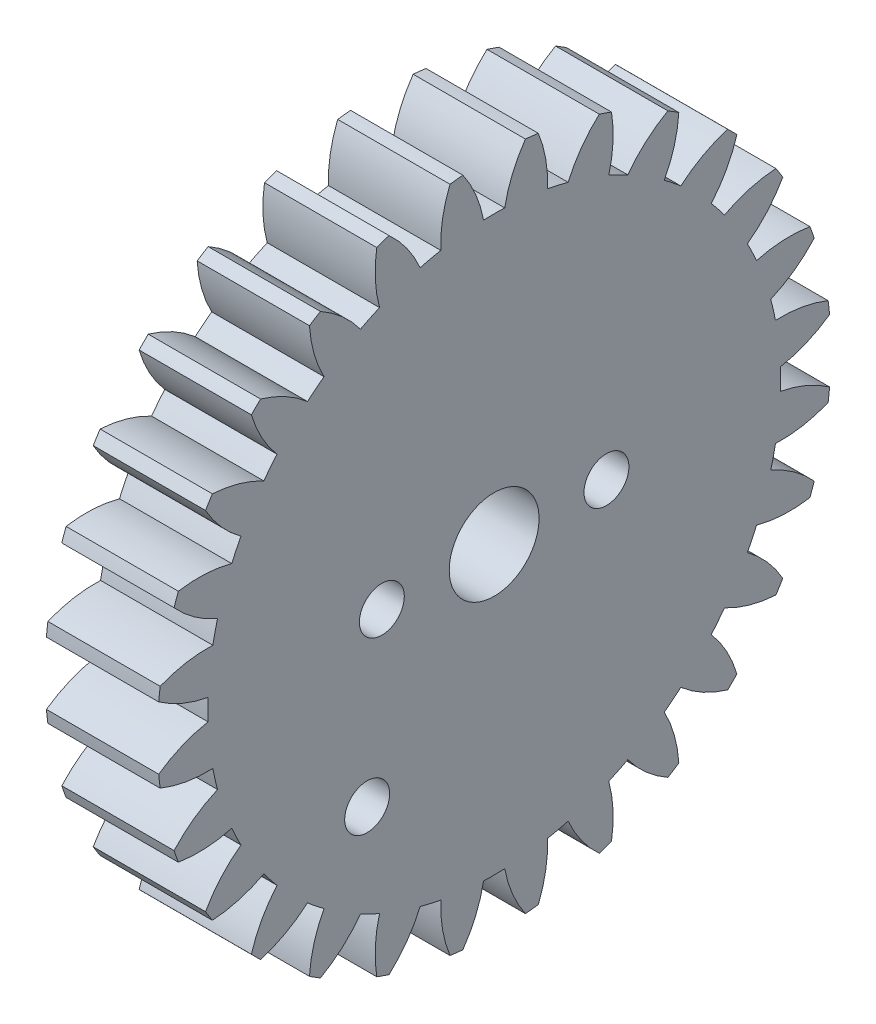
ISO-10303-21;
HEADER;
FILE_DESCRIPTION(('STEP AP214'),'2;1');
FILE_NAME('part.step','',(''),(''),'','','');
FILE_SCHEMA(('AUTOMOTIVE_DESIGN { 1 0 10303 214 1 1 1 1 }'));
ENDSEC;
DATA;
#1=APPLICATION_CONTEXT('core data for automotive mechanical design processes');
#2=APPLICATION_PROTOCOL_DEFINITION('international standard','automotive_design',2000,#1);
#3=PRODUCT_CONTEXT('',#1,'mechanical');
#4=PRODUCT('Part','Part','',(#3));
#5=PRODUCT_RELATED_PRODUCT_CATEGORY('part','',(#4));
#6=PRODUCT_DEFINITION_FORMATION('','',#4);
#7=PRODUCT_DEFINITION_CONTEXT('part definition',#1,'design');
#8=PRODUCT_DEFINITION('design','',#6,#7);
#9=PRODUCT_DEFINITION_SHAPE('','',#8);
#10=(LENGTH_UNIT() NAMED_UNIT(*) SI_UNIT(.MILLI.,.METRE.));
#11=(NAMED_UNIT(*) PLANE_ANGLE_UNIT() SI_UNIT($,.RADIAN.));
#12=(NAMED_UNIT(*) SI_UNIT($,.STERADIAN.) SOLID_ANGLE_UNIT());
#13=UNCERTAINTY_MEASURE_WITH_UNIT(LENGTH_MEASURE(1.E-05),#10,'distance_accuracy_value','');
#14=(GEOMETRIC_REPRESENTATION_CONTEXT(3) GLOBAL_UNCERTAINTY_ASSIGNED_CONTEXT((#13)) GLOBAL_UNIT_ASSIGNED_CONTEXT((#10,
#11,#12)) REPRESENTATION_CONTEXT('',''));
#15=CARTESIAN_POINT('',(0.,0.,0.));
#16=DIRECTION('',(0.,0.,1.));
#17=DIRECTION('',(1.,0.,0.));
#18=AXIS2_PLACEMENT_3D('',#15,#16,#17);
#19=CARTESIAN_POINT('',(-5.73931620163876,-56.4381534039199,-2.84651846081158));
#20=DIRECTION('',(-1.,0.,0.));
#21=DIRECTION('',(0.,0.,1.));
#22=AXIS2_PLACEMENT_3D('',#19,#20,#21);
#23=PLANE('',#22);
#24=CARTESIAN_POINT('',(-5.73931620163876,-56.4381534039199,2.15348153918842));
#25=DIRECTION('',(1.,0.,0.));
#26=DIRECTION('',(0.,0.,-1.));
#27=AXIS2_PLACEMENT_3D('',#24,#25,#26);
#28=CIRCLE('',#27,1.);
#29=CARTESIAN_POINT('',(-5.73931620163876,-56.4381534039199,1.15348153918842));
#30=VERTEX_POINT('',#29);
#31=EDGE_CURVE('E1454',#30,#30,#28,.T.);
#32=ORIENTED_EDGE('',*,*,#31,.F.);
#33=EDGE_LOOP('',(#32));
#34=FACE_BOUND('',#33,.T.);
#35=CARTESIAN_POINT('',(-5.73931620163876,-56.4381534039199,-7.84651846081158));
#36=DIRECTION('',(1.,0.,0.));
#37=DIRECTION('',(0.,0.,-1.));
#38=AXIS2_PLACEMENT_3D('',#35,#36,#37);
#39=CIRCLE('',#38,1.);
#40=CARTESIAN_POINT('',(-5.73931620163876,-56.4381534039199,-8.84651846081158));
#41=VERTEX_POINT('',#40);
#42=EDGE_CURVE('E1444',#41,#41,#39,.T.);
#43=ORIENTED_EDGE('',*,*,#42,.F.);
#44=EDGE_LOOP('',(#43));
#45=FACE_BOUND('',#44,.T.);
#46=CARTESIAN_POINT('',(-5.73931620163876,-63.7241598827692,2.80783823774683));
#47=DIRECTION('',(1.,0.,0.));
#48=DIRECTION('',(0.,0.,-1.));
#49=AXIS2_PLACEMENT_3D('',#46,#47,#48);
#50=CIRCLE('',#49,1.);
#51=CARTESIAN_POINT('',(-5.73931620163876,-63.7241598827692,1.80783823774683));
#52=VERTEX_POINT('',#51);
#53=EDGE_CURVE('E1441',#52,#52,#50,.T.);
#54=ORIENTED_EDGE('',*,*,#53,.F.);
#55=EDGE_LOOP('',(#54));
#56=FACE_BOUND('',#55,.T.);
#57=CARTESIAN_POINT('',(-5.73931620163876,-46.3427898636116,-11.2819194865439));
#58=DIRECTION('',(-1.,0.,0.));
#59=DIRECTION('',(0.,-0.222520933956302,-0.974927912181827));
#60=AXIS2_PLACEMENT_3D('',#57,#58,#59);
#61=CIRCLE('',#60,5.6);
#62=CARTESIAN_POINT('',(-5.73931620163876,-44.1221767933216,-6.14101707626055));
#63=VERTEX_POINT('',#62);
#64=CARTESIAN_POINT('',(-5.73931620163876,-42.1873798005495,-7.52791266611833));
#65=VERTEX_POINT('',#64);
#66=EDGE_CURVE('E734',#63,#65,#61,.T.);
#67=ORIENTED_EDGE('',*,*,#66,.F.);
#68=CARTESIAN_POINT('',(-5.73931620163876,-56.4381534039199,-2.84651846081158));
#69=DIRECTION('',(-1.,0.,0.));
#70=DIRECTION('',(0.,-0.222520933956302,-0.974927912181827));
#71=AXIS2_PLACEMENT_3D('',#68,#69,#70);
#72=CIRCLE('',#71,12.749);
#73=CARTESIAN_POINT('',(-5.73931620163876,-43.9124125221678,-5.22197975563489));
#74=VERTEX_POINT('',#73);
#75=EDGE_CURVE('E733',#74,#63,#72,.T.);
#76=ORIENTED_EDGE('',*,*,#75,.F.);
#77=CARTESIAN_POINT('',(-5.73931620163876,-43.6825618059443,0.373301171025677));
#78=DIRECTION('',(-1.,0.,0.));
#79=DIRECTION('',(0.,-0.222520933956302,-0.974927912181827));
#80=AXIS2_PLACEMENT_3D('',#77,#78,#79);
#81=CIRCLE('',#80,5.6);
#82=CARTESIAN_POINT('',(-5.73931620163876,-41.5674692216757,-4.81190695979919));
#83=VERTEX_POINT('',#82);
#84=EDGE_CURVE('E722',#83,#74,#81,.T.);
#85=ORIENTED_EDGE('',*,*,#84,.F.);
#86=CARTESIAN_POINT('',(-5.73931620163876,-56.4381534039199,-2.84651846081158));
#87=DIRECTION('',(-1.,0.,0.));
#88=DIRECTION('',(0.,0.,1.));
#89=AXIS2_PLACEMENT_3D('',#86,#87,#88);
#90=CIRCLE('',#89,15.);
#91=CARTESIAN_POINT('',(-5.73931620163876,-41.5029682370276,-4.23944488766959));
#92=VERTEX_POINT('',#91);
#93=EDGE_CURVE('E1353',#92,#83,#90,.T.);
#94=ORIENTED_EDGE('',*,*,#93,.F.);
#95=CARTESIAN_POINT('',(-5.73931620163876,-44.7188483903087,-8.82399664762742));
#96=DIRECTION('',(-1.,0.,0.));
#97=DIRECTION('',(0.,0.,-1.));
#98=AXIS2_PLACEMENT_3D('',#95,#96,#97);
#99=CIRCLE('',#98,5.6);
#100=CARTESIAN_POINT('',(-5.73931620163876,-43.6978691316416,-3.31785449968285));
#101=VERTEX_POINT('',#100);
#102=EDGE_CURVE('E1326',#101,#92,#99,.T.);
#103=ORIENTED_EDGE('',*,*,#102,.F.);
#104=CARTESIAN_POINT('',(-5.73931620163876,-56.4381534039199,-2.84651846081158));
#105=DIRECTION('',(-1.,0.,0.));
#106=DIRECTION('',(0.,0.,-1.));
#107=AXIS2_PLACEMENT_3D('',#104,#105,#106);
#108=CIRCLE('',#107,12.749);
#109=CARTESIAN_POINT('',(-5.73931620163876,-43.6978691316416,-2.3751824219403));
#110=VERTEX_POINT('',#109);
#111=EDGE_CURVE('E1331',#110,#101,#108,.T.);
#112=ORIENTED_EDGE('',*,*,#111,.F.);
#113=CARTESIAN_POINT('',(-5.73931620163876,-44.7188483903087,3.13095972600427));
#114=DIRECTION('',(-1.,0.,0.));
#115=DIRECTION('',(0.,0.,-1.));
#116=AXIS2_PLACEMENT_3D('',#113,#114,#115);
#117=CIRCLE('',#116,5.6);
#118=CARTESIAN_POINT('',(-5.73931620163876,-41.5029682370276,-1.45359203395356));
#119=VERTEX_POINT('',#118);
#120=EDGE_CURVE('E1328',#119,#110,#117,.T.);
#121=ORIENTED_EDGE('',*,*,#120,.F.);
#122=CARTESIAN_POINT('',(-5.73931620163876,-41.5674692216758,-0.881129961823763));
#123=VERTEX_POINT('',#122);
#124=EDGE_CURVE('E1351',#123,#119,#90,.T.);
#125=ORIENTED_EDGE('',*,*,#124,.F.);
#126=CARTESIAN_POINT('',(-5.73931620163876,-43.6825618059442,-6.06633809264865));
#127=DIRECTION('',(-1.,0.,0.));
#128=DIRECTION('',(0.,0.222520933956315,-0.974927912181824));
#129=AXIS2_PLACEMENT_3D('',#126,#127,#128);
#130=CIRCLE('',#129,5.6);
#131=CARTESIAN_POINT('',(-5.73931620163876,-43.9124125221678,-0.47105716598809));
#132=VERTEX_POINT('',#131);
#133=EDGE_CURVE('E1304',#132,#123,#130,.T.);
#134=ORIENTED_EDGE('',*,*,#133,.F.);
#135=CARTESIAN_POINT('',(-5.73931620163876,-56.4381534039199,-2.84651846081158));
#136=DIRECTION('',(-1.,0.,0.));
#137=DIRECTION('',(0.,0.222520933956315,-0.974927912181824));
#138=AXIS2_PLACEMENT_3D('',#135,#136,#137);
#139=CIRCLE('',#138,12.749);
#140=CARTESIAN_POINT('',(-5.73931620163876,-44.1221767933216,0.447980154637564));
#141=VERTEX_POINT('',#140);
#142=EDGE_CURVE('E1309',#141,#132,#139,.T.);
#143=ORIENTED_EDGE('',*,*,#142,.F.);
#144=CARTESIAN_POINT('',(-5.73931620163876,-46.3427898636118,5.58888256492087));
#145=DIRECTION('',(-1.,0.,0.));
#146=DIRECTION('',(0.,0.222520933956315,-0.974927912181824));
#147=AXIS2_PLACEMENT_3D('',#144,#145,#146);
#148=CIRCLE('',#147,5.6);
#149=CARTESIAN_POINT('',(-5.73931620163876,-42.1873798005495,1.83487574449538));
#150=VERTEX_POINT('',#149);
#151=EDGE_CURVE('E1306',#150,#141,#148,.T.);
#152=ORIENTED_EDGE('',*,*,#151,.F.);
#153=CARTESIAN_POINT('',(-5.73931620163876,-42.3776484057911,2.37863217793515));
#154=VERTEX_POINT('',#153);
#155=EDGE_CURVE('E1582',#154,#150,#90,.T.);
#156=ORIENTED_EDGE('',*,*,#155,.F.);
#157=CARTESIAN_POINT('',(-5.73931620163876,-43.2858938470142,-3.14722433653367));
#158=DIRECTION('',(-1.,0.,0.));
#159=DIRECTION('',(0.,0.433883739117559,-0.900968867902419));
#160=AXIS2_PLACEMENT_3D('',#157,#158,#159);
#161=CIRCLE('',#160,5.6);
#162=CARTESIAN_POINT('',(-5.73931620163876,-44.755048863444,2.25662461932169));
#163=VERTEX_POINT('',#162);
#164=EDGE_CURVE('E1282',#163,#154,#161,.T.);
#165=ORIENTED_EDGE('',*,*,#164,.F.);
#166=CARTESIAN_POINT('',(-5.73931620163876,-56.4381534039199,-2.84651846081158));
#167=DIRECTION('',(-1.,0.,0.));
#168=DIRECTION('',(0.,0.433883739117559,-0.900968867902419));
#169=AXIS2_PLACEMENT_3D('',#166,#167,#168);
#170=CIRCLE('',#169,12.749);
#171=CARTESIAN_POINT('',(-5.73931620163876,-45.1640589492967,3.10594281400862));
#172=VERTEX_POINT('',#171);
#173=EDGE_CURVE('E1287',#172,#163,#170,.T.);
#174=ORIENTED_EDGE('',*,*,#173,.F.);
#175=CARTESIAN_POINT('',(-5.73931620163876,-48.4729550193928,7.62381917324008));
#176=DIRECTION('',(-1.,0.,0.));
#177=DIRECTION('',(0.,0.433883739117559,-0.900968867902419));
#178=AXIS2_PLACEMENT_3D('',#175,#176,#177);
#179=CIRCLE('',#178,5.6);
#180=CARTESIAN_POINT('',(-5.73931620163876,-43.5863846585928,4.8885988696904));
#181=VERTEX_POINT('',#180);
#182=EDGE_CURVE('E1284',#181,#172,#179,.T.);
#183=ORIENTED_EDGE('',*,*,#182,.F.);
#184=CARTESIAN_POINT('',(-5.73931620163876,-43.8928800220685,5.37638344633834));
#185=VERTEX_POINT('',#184);
#186=EDGE_CURVE('E1577',#185,#181,#90,.T.);
#187=ORIENTED_EDGE('',*,*,#186,.F.);
#188=CARTESIAN_POINT('',(-5.73931620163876,-43.5487351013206,-0.213031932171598));
#189=DIRECTION('',(-1.,0.,0.));
#190=DIRECTION('',(0.,0.623489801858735,-0.781831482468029));
#191=AXIS2_PLACEMENT_3D('',#188,#189,#190);
#192=CIRCLE('',#191,5.6);
#193=CARTESIAN_POINT('',(-5.73931620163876,-46.1835248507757,4.72841350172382));
#194=VERTEX_POINT('',#193);
#195=EDGE_CURVE('E1260',#194,#185,#192,.T.);
#196=ORIENTED_EDGE('',*,*,#195,.F.);
#197=CARTESIAN_POINT('',(-5.73931620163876,-56.4381534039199,-2.84651846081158));
#198=DIRECTION('',(-1.,0.,0.));
#199=DIRECTION('',(0.,0.623489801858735,-0.781831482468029));
#200=AXIS2_PLACEMENT_3D('',#197,#198,#199);
#201=CIRCLE('',#200,12.749);
#202=CARTESIAN_POINT('',(-5.73931620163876,-46.7712712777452,5.4654242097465));
#203=VERTEX_POINT('',#202);
#204=EDGE_CURVE('E1265',#203,#194,#201,.T.);
#205=ORIENTED_EDGE('',*,*,#204,.F.);
#206=CARTESIAN_POINT('',(-5.73931620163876,-51.002528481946,9.13372933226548));
#207=DIRECTION('',(-1.,0.,0.));
#208=DIRECTION('',(0.,0.623489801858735,-0.781831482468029));
#209=AXIS2_PLACEMENT_3D('',#206,#207,#208);
#210=CIRCLE('',#209,5.6);
#211=CARTESIAN_POINT('',(-5.73931620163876,-45.6298308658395,7.55445091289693));
#212=VERTEX_POINT('',#211);
#213=EDGE_CURVE('E1262',#212,#203,#210,.T.);
#214=ORIENTED_EDGE('',*,*,#213,.F.);
#215=CARTESIAN_POINT('',(-5.73931620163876,-46.0371840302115,7.96180407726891));
#216=VERTEX_POINT('',#215);
#217=EDGE_CURVE('E1572',#216,#212,#90,.T.);
#218=ORIENTED_EDGE('',*,*,#217,.F.);
#219=CARTESIAN_POINT('',(-5.73931620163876,-44.4579056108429,2.58910646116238));
#220=DIRECTION('',(-1.,0.,0.));
#221=DIRECTION('',(0.,0.781831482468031,-0.623489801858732));
#222=AXIS2_PLACEMENT_3D('',#219,#220,#221);
#223=CIRCLE('',#222,5.6);
#224=CARTESIAN_POINT('',(-5.73931620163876,-48.1262107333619,6.82036366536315));
#225=VERTEX_POINT('',#224);
#226=EDGE_CURVE('E1238',#225,#216,#223,.T.);
#227=ORIENTED_EDGE('',*,*,#226,.F.);
#228=CARTESIAN_POINT('',(-5.73931620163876,-56.4381534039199,-2.84651846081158));
#229=DIRECTION('',(-1.,0.,0.));
#230=DIRECTION('',(0.,0.781831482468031,-0.623489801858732));
#231=AXIS2_PLACEMENT_3D('',#228,#229,#230);
#232=CIRCLE('',#231,12.749);
#233=CARTESIAN_POINT('',(-5.73931620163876,-48.8632214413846,7.40811009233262));
#234=VERTEX_POINT('',#233);
#235=EDGE_CURVE('E1243',#234,#225,#232,.T.);
#236=ORIENTED_EDGE('',*,*,#235,.F.);
#237=CARTESIAN_POINT('',(-5.73931620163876,-53.80466687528,10.0428998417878));
#238=DIRECTION('',(-1.,0.,0.));
#239=DIRECTION('',(0.,0.781831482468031,-0.623489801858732));
#240=AXIS2_PLACEMENT_3D('',#237,#238,#239);
#241=CIRCLE('',#240,5.6);
#242=CARTESIAN_POINT('',(-5.73931620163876,-48.2152514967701,9.69875492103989));
#243=VERTEX_POINT('',#242);
#244=EDGE_CURVE('E1240',#243,#234,#241,.T.);
#245=ORIENTED_EDGE('',*,*,#244,.F.);
#246=CARTESIAN_POINT('',(-5.73931620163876,-48.703036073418,10.0052502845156));
#247=VERTEX_POINT('',#246);
#248=EDGE_CURVE('E1567',#247,#243,#90,.T.);
#249=ORIENTED_EDGE('',*,*,#248,.F.);
#250=CARTESIAN_POINT('',(-5.73931620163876,-45.9678157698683,5.11867992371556));
#251=DIRECTION('',(-1.,0.,0.));
#252=DIRECTION('',(0.,0.90096886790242,-0.433883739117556));
#253=AXIS2_PLACEMENT_3D('',#250,#251,#252);
#254=CIRCLE('',#253,5.6);
#255=CARTESIAN_POINT('',(-5.73931620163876,-50.4856921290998,8.42757599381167));
#256=VERTEX_POINT('',#255);
#257=EDGE_CURVE('E1216',#256,#247,#254,.T.);
#258=ORIENTED_EDGE('',*,*,#257,.F.);
#259=CARTESIAN_POINT('',(-5.73931620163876,-56.4381534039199,-2.84651846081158));
#260=DIRECTION('',(-1.,0.,0.));
#261=DIRECTION('',(0.,0.90096886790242,-0.433883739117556));
#262=AXIS2_PLACEMENT_3D('',#259,#260,#261);
#263=CIRCLE('',#262,12.749);
#264=CARTESIAN_POINT('',(-5.73931620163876,-51.3350103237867,8.83658607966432));
#265=VERTEX_POINT('',#264);
#266=EDGE_CURVE('E1221',#265,#256,#263,.T.);
#267=ORIENTED_EDGE('',*,*,#266,.F.);
#268=CARTESIAN_POINT('',(-5.73931620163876,-56.7388592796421,10.3057410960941));
#269=DIRECTION('',(-1.,0.,0.));
#270=DIRECTION('',(0.,0.90096886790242,-0.433883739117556));
#271=AXIS2_PLACEMENT_3D('',#268,#269,#270);
#272=CIRCLE('',#271,5.6);
#273=CARTESIAN_POINT('',(-5.73931620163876,-51.2130027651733,11.2139865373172));
#274=VERTEX_POINT('',#273);
#275=EDGE_CURVE('E1218',#274,#265,#272,.T.);
#276=ORIENTED_EDGE('',*,*,#275,.F.);
#277=CARTESIAN_POINT('',(-5.73931620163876,-51.756759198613,11.4042551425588));
#278=VERTEX_POINT('',#277);
#279=EDGE_CURVE('E1562',#278,#274,#90,.T.);
#280=ORIENTED_EDGE('',*,*,#279,.F.);
#281=CARTESIAN_POINT('',(-5.73931620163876,-48.0027523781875,7.24884507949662));
#282=DIRECTION('',(-1.,0.,0.));
#283=DIRECTION('',(0.,0.974927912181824,-0.222520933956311));
#284=AXIS2_PLACEMENT_3D('',#281,#282,#283);
#285=CIRCLE('',#284,5.6);
#286=CARTESIAN_POINT('',(-5.73931620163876,-53.1436547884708,9.46945814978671));
#287=VERTEX_POINT('',#286);
#288=EDGE_CURVE('E1194',#287,#278,#285,.T.);
#289=ORIENTED_EDGE('',*,*,#288,.F.);
#290=CARTESIAN_POINT('',(-5.73931620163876,-56.4381534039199,-2.84651846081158));
#291=DIRECTION('',(-1.,0.,0.));
#292=DIRECTION('',(0.,0.974927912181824,-0.222520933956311));
#293=AXIS2_PLACEMENT_3D('',#290,#291,#292);
#294=CIRCLE('',#293,12.749);
#295=CARTESIAN_POINT('',(-5.73931620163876,-54.0626921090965,9.67922242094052));
#296=VERTEX_POINT('',#295);
#297=EDGE_CURVE('E1199',#296,#287,#294,.T.);
#298=ORIENTED_EDGE('',*,*,#297,.F.);
#299=CARTESIAN_POINT('',(-5.73931620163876,-59.657973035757,9.90907313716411));
#300=DIRECTION('',(-1.,0.,0.));
#301=DIRECTION('',(0.,0.974927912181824,-0.222520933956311));
#302=AXIS2_PLACEMENT_3D('',#299,#300,#301);
#303=CIRCLE('',#302,5.6);
#304=CARTESIAN_POINT('',(-5.73931620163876,-54.4727649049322,12.0241657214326));
#305=VERTEX_POINT('',#304);
#306=EDGE_CURVE('E1196',#305,#296,#303,.T.);
#307=ORIENTED_EDGE('',*,*,#306,.F.);
#308=CARTESIAN_POINT('',(-5.73931620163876,-55.045226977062,12.0886667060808));
#309=VERTEX_POINT('',#308);
#310=EDGE_CURVE('E1557',#309,#305,#90,.T.);
#311=ORIENTED_EDGE('',*,*,#310,.F.);
#312=CARTESIAN_POINT('',(-5.73931620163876,-50.4606752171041,8.87278655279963));
#313=DIRECTION('',(-1.,0.,0.));
#314=DIRECTION('',(0.,1.,0.));
#315=AXIS2_PLACEMENT_3D('',#312,#313,#314);
#316=CIRCLE('',#315,5.6);
#317=CARTESIAN_POINT('',(-5.73931620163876,-55.9668173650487,9.8937658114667));
#318=VERTEX_POINT('',#317);
#319=EDGE_CURVE('E1172',#318,#309,#316,.T.);
#320=ORIENTED_EDGE('',*,*,#319,.F.);
#321=CARTESIAN_POINT('',(-5.73931620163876,-56.4381534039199,-2.84651846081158));
#322=DIRECTION('',(-1.,0.,0.));
#323=DIRECTION('',(0.,1.,0.));
#324=AXIS2_PLACEMENT_3D('',#321,#322,#323);
#325=CIRCLE('',#324,12.749);
#326=CARTESIAN_POINT('',(-5.73931620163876,-56.9094894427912,9.8937658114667));
#327=VERTEX_POINT('',#326);
#328=EDGE_CURVE('E1177',#327,#318,#325,.T.);
#329=ORIENTED_EDGE('',*,*,#328,.F.);
#330=CARTESIAN_POINT('',(-5.73931620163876,-62.4156315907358,8.87278655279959));
#331=DIRECTION('',(-1.,0.,0.));
#332=DIRECTION('',(0.,1.,0.));
#333=AXIS2_PLACEMENT_3D('',#330,#331,#332);
#334=CIRCLE('',#333,5.6);
#335=CARTESIAN_POINT('',(-5.73931620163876,-57.831079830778,12.0886667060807));
#336=VERTEX_POINT('',#335);
#337=EDGE_CURVE('E1174',#336,#327,#334,.T.);
#338=ORIENTED_EDGE('',*,*,#337,.F.);
#339=CARTESIAN_POINT('',(-5.73931620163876,-58.4035419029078,12.0241657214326));
#340=VERTEX_POINT('',#339);
#341=EDGE_CURVE('E1552',#340,#336,#90,.T.);
#342=ORIENTED_EDGE('',*,*,#341,.F.);
#343=CARTESIAN_POINT('',(-5.73931620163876,-53.2183337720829,9.90907313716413));
#344=DIRECTION('',(-1.,0.,0.));
#345=DIRECTION('',(0.,0.974927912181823,0.222520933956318));
#346=AXIS2_PLACEMENT_3D('',#343,#344,#345);
#347=CIRCLE('',#346,5.6);
#348=CARTESIAN_POINT('',(-5.73931620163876,-58.8136146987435,9.6792224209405));
#349=VERTEX_POINT('',#348);
#350=EDGE_CURVE('E1150',#349,#340,#347,.T.);
#351=ORIENTED_EDGE('',*,*,#350,.F.);
#352=CARTESIAN_POINT('',(-5.73931620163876,-56.4381534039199,-2.84651846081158));
#353=DIRECTION('',(-1.,0.,0.));
#354=DIRECTION('',(0.,0.974927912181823,0.222520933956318));
#355=AXIS2_PLACEMENT_3D('',#352,#353,#354);
#356=CIRCLE('',#355,12.749);
#357=CARTESIAN_POINT('',(-5.73931620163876,-59.7326520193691,9.46945814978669));
#358=VERTEX_POINT('',#357);
#359=EDGE_CURVE('E1155',#358,#349,#356,.T.);
#360=ORIENTED_EDGE('',*,*,#359,.F.);
#361=CARTESIAN_POINT('',(-5.73931620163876,-64.8735544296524,7.24884507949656));
#362=DIRECTION('',(-1.,0.,0.));
#363=DIRECTION('',(0.,0.974927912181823,0.222520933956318));
#364=AXIS2_PLACEMENT_3D('',#361,#362,#363);
#365=CIRCLE('',#364,5.6);
#366=CARTESIAN_POINT('',(-5.73931620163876,-61.1195476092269,11.4042551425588));
#367=VERTEX_POINT('',#366);
#368=EDGE_CURVE('E1152',#367,#358,#365,.T.);
#369=ORIENTED_EDGE('',*,*,#368,.F.);
#370=CARTESIAN_POINT('',(-5.73931620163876,-61.6633040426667,11.2139865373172));
#371=VERTEX_POINT('',#370);
#372=EDGE_CURVE('E1547',#371,#367,#90,.T.);
#373=ORIENTED_EDGE('',*,*,#372,.F.);
#374=CARTESIAN_POINT('',(-5.73931620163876,-56.1374475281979,10.3057410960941));
#375=DIRECTION('',(-1.,0.,0.));
#376=DIRECTION('',(0.,0.900968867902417,0.433883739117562));
#377=AXIS2_PLACEMENT_3D('',#374,#375,#376);
#378=CIRCLE('',#377,5.6);
#379=CARTESIAN_POINT('',(-5.73931620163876,-61.5412964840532,8.83658607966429));
#380=VERTEX_POINT('',#379);
#381=EDGE_CURVE('E1128',#380,#371,#378,.T.);
#382=ORIENTED_EDGE('',*,*,#381,.F.);
#383=CARTESIAN_POINT('',(-5.73931620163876,-56.4381534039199,-2.84651846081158));
#384=DIRECTION('',(-1.,0.,0.));
#385=DIRECTION('',(0.,0.900968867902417,0.433883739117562));
#386=AXIS2_PLACEMENT_3D('',#383,#384,#385);
#387=CIRCLE('',#386,12.749);
#388=CARTESIAN_POINT('',(-5.73931620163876,-62.3906146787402,8.42757599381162));
#389=VERTEX_POINT('',#388);
#390=EDGE_CURVE('E1133',#389,#380,#387,.T.);
#391=ORIENTED_EDGE('',*,*,#390,.F.);
#392=CARTESIAN_POINT('',(-5.73931620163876,-66.9084910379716,5.11867992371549));
#393=DIRECTION('',(-1.,0.,0.));
#394=DIRECTION('',(0.,0.900968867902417,0.433883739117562));
#395=AXIS2_PLACEMENT_3D('',#392,#393,#394);
#396=CIRCLE('',#395,5.6);
#397=CARTESIAN_POINT('',(-5.73931620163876,-64.1732707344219,10.0052502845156));
#398=VERTEX_POINT('',#397);
#399=EDGE_CURVE('E1130',#398,#389,#396,.T.);
#400=ORIENTED_EDGE('',*,*,#399,.F.);
#401=CARTESIAN_POINT('',(-5.73931620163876,-64.6610553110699,9.69875492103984));
#402=VERTEX_POINT('',#401);
#403=EDGE_CURVE('E1542',#402,#398,#90,.T.);
#404=ORIENTED_EDGE('',*,*,#403,.F.);
#405=CARTESIAN_POINT('',(-5.73931620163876,-59.0716399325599,10.0428998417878));
#406=DIRECTION('',(-1.,0.,0.));
#407=DIRECTION('',(0.,0.781831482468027,0.623489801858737));
#408=AXIS2_PLACEMENT_3D('',#405,#406,#407);
#409=CIRCLE('',#408,5.6);
#410=CARTESIAN_POINT('',(-5.73931620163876,-64.0130853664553,7.40811009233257));
#411=VERTEX_POINT('',#410);
#412=EDGE_CURVE('E1106',#411,#402,#409,.T.);
#413=ORIENTED_EDGE('',*,*,#412,.F.);
#414=CARTESIAN_POINT('',(-5.73931620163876,-56.4381534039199,-2.84651846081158));
#415=DIRECTION('',(-1.,0.,0.));
#416=DIRECTION('',(0.,0.781831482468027,0.623489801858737));
#417=AXIS2_PLACEMENT_3D('',#414,#415,#416);
#418=CIRCLE('',#417,12.749);
#419=CARTESIAN_POINT('',(-5.73931620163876,-64.750096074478,6.8203636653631));
#420=VERTEX_POINT('',#419);
#421=EDGE_CURVE('E1111',#420,#411,#418,.T.);
#422=ORIENTED_EDGE('',*,*,#421,.F.);
#423=CARTESIAN_POINT('',(-5.73931620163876,-68.418401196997,2.5891064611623));
#424=DIRECTION('',(-1.,0.,0.));
#425=DIRECTION('',(0.,0.781831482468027,0.623489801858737));
#426=AXIS2_PLACEMENT_3D('',#423,#424,#425);
#427=CIRCLE('',#426,5.6);
#428=CARTESIAN_POINT('',(-5.73931620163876,-66.8391227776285,7.96180407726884));
#429=VERTEX_POINT('',#428);
#430=EDGE_CURVE('E1108',#429,#420,#427,.T.);
#431=ORIENTED_EDGE('',*,*,#430,.F.);
#432=CARTESIAN_POINT('',(-5.73931620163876,-67.2464759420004,7.55445091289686));
#433=VERTEX_POINT('',#432);
#434=EDGE_CURVE('E1537',#433,#429,#90,.T.);
#435=ORIENTED_EDGE('',*,*,#434,.F.);
#436=CARTESIAN_POINT('',(-5.73931620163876,-61.8737783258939,9.13372933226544));
#437=DIRECTION('',(-1.,0.,0.));
#438=DIRECTION('',(0.,0.623489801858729,0.781831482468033));
#439=AXIS2_PLACEMENT_3D('',#436,#437,#438);
#440=CIRCLE('',#439,5.6);
#441=CARTESIAN_POINT('',(-5.73931620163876,-66.1050355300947,5.46542420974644));
#442=VERTEX_POINT('',#441);
#443=EDGE_CURVE('E1084',#442,#433,#440,.T.);
#444=ORIENTED_EDGE('',*,*,#443,.F.);
#445=CARTESIAN_POINT('',(-5.73931620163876,-56.4381534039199,-2.84651846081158));
#446=DIRECTION('',(-1.,0.,0.));
#447=DIRECTION('',(0.,0.623489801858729,0.781831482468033));
#448=AXIS2_PLACEMENT_3D('',#445,#446,#447);
#449=CIRCLE('',#448,12.749);
#450=CARTESIAN_POINT('',(-5.73931620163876,-66.6927819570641,4.72841350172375));
#451=VERTEX_POINT('',#450);
#452=EDGE_CURVE('E1089',#451,#442,#449,.T.);
#453=ORIENTED_EDGE('',*,*,#452,.F.);
#454=CARTESIAN_POINT('',(-5.73931620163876,-69.3275717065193,-0.213031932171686));
#455=DIRECTION('',(-1.,0.,0.));
#456=DIRECTION('',(0.,0.623489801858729,0.781831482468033));
#457=AXIS2_PLACEMENT_3D('',#454,#455,#456);
#458=CIRCLE('',#457,5.6);
#459=CARTESIAN_POINT('',(-5.73931620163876,-68.9834267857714,5.37638344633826));
#460=VERTEX_POINT('',#459);
#461=EDGE_CURVE('E1086',#460,#451,#458,.T.);
#462=ORIENTED_EDGE('',*,*,#461,.F.);
#463=CARTESIAN_POINT('',(-5.73931620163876,-69.2899221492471,4.88859886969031));
#464=VERTEX_POINT('',#463);
#465=EDGE_CURVE('E1532',#464,#460,#90,.T.);
#466=ORIENTED_EDGE('',*,*,#465,.F.);
#467=CARTESIAN_POINT('',(-5.73931620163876,-64.4033517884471,7.62381917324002));
#468=DIRECTION('',(-1.,0.,0.));
#469=DIRECTION('',(0.,0.433883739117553,0.900968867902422));
#470=AXIS2_PLACEMENT_3D('',#467,#468,#469);
#471=CIRCLE('',#470,5.6);
#472=CARTESIAN_POINT('',(-5.73931620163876,-67.7122478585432,3.10594281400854));
#473=VERTEX_POINT('',#472);
#474=EDGE_CURVE('E1062',#473,#464,#471,.T.);
#475=ORIENTED_EDGE('',*,*,#474,.F.);
#476=CARTESIAN_POINT('',(-5.73931620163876,-56.4381534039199,-2.84651846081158));
#477=DIRECTION('',(-1.,0.,0.));
#478=DIRECTION('',(0.,0.433883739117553,0.900968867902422));
#479=AXIS2_PLACEMENT_3D('',#476,#477,#478);
#480=CIRCLE('',#479,12.749);
#481=CARTESIAN_POINT('',(-5.73931620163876,-68.1212579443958,2.2566246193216));
#482=VERTEX_POINT('',#481);
#483=EDGE_CURVE('E1067',#482,#473,#480,.T.);
#484=ORIENTED_EDGE('',*,*,#483,.F.);
#485=CARTESIAN_POINT('',(-5.73931620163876,-69.5904129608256,-3.14722433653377));
#486=DIRECTION('',(-1.,0.,0.));
#487=DIRECTION('',(0.,0.433883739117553,0.900968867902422));
#488=AXIS2_PLACEMENT_3D('',#485,#486,#487);
#489=CIRCLE('',#488,5.6);
#490=CARTESIAN_POINT('',(-5.73931620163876,-70.4986584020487,2.37863217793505));
#491=VERTEX_POINT('',#490);
#492=EDGE_CURVE('E1064',#491,#482,#489,.T.);
#493=ORIENTED_EDGE('',*,*,#492,.F.);
#494=CARTESIAN_POINT('',(-5.73931620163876,-70.6889270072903,1.83487574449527));
#495=VERTEX_POINT('',#494);
#496=EDGE_CURVE('E1527',#495,#491,#90,.T.);
#497=ORIENTED_EDGE('',*,*,#496,.F.);
#498=CARTESIAN_POINT('',(-5.73931620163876,-66.5335169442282,5.5888825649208));
#499=DIRECTION('',(-1.,0.,0.));
#500=DIRECTION('',(0.,0.222520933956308,0.974927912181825));
#501=AXIS2_PLACEMENT_3D('',#498,#499,#500);
#502=CIRCLE('',#501,5.6);
#503=CARTESIAN_POINT('',(-5.73931620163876,-68.7541300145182,0.447980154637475));
#504=VERTEX_POINT('',#503);
#505=EDGE_CURVE('E1040',#504,#495,#502,.T.);
#506=ORIENTED_EDGE('',*,*,#505,.F.);
#507=CARTESIAN_POINT('',(-5.73931620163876,-56.4381534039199,-2.84651846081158));
#508=DIRECTION('',(-1.,0.,0.));
#509=DIRECTION('',(0.,0.222520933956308,0.974927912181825));
#510=AXIS2_PLACEMENT_3D('',#507,#508,#509);
#511=CIRCLE('',#510,12.749);
#512=CARTESIAN_POINT('',(-5.73931620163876,-68.963894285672,-0.471057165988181));
#513=VERTEX_POINT('',#512);
#514=EDGE_CURVE('E1045',#513,#504,#511,.T.);
#515=ORIENTED_EDGE('',*,*,#514,.F.);
#516=CARTESIAN_POINT('',(-5.73931620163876,-69.1937450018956,-6.06633809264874));
#517=DIRECTION('',(-1.,0.,0.));
#518=DIRECTION('',(0.,0.222520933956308,0.974927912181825));
#519=AXIS2_PLACEMENT_3D('',#516,#517,#518);
#520=CIRCLE('',#519,5.6);
#521=CARTESIAN_POINT('',(-5.73931620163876,-71.3088375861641,-0.881129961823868));
#522=VERTEX_POINT('',#521);
#523=EDGE_CURVE('E1042',#522,#513,#520,.T.);
#524=ORIENTED_EDGE('',*,*,#523,.F.);
#525=CARTESIAN_POINT('',(-5.73931620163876,-71.3733385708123,-1.45359203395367));
#526=VERTEX_POINT('',#525);
#527=EDGE_CURVE('E1522',#526,#522,#90,.T.);
#528=ORIENTED_EDGE('',*,*,#527,.F.);
#529=CARTESIAN_POINT('',(-5.73931620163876,-68.1574584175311,3.13095972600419));
#530=DIRECTION('',(-1.,0.,0.));
#531=DIRECTION('',(0.,0.,1.));
#532=AXIS2_PLACEMENT_3D('',#529,#530,#531);
#533=CIRCLE('',#532,5.6);
#534=CARTESIAN_POINT('',(-5.73931620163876,-69.1784376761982,-2.37518242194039));
#535=VERTEX_POINT('',#534);
#536=EDGE_CURVE('E1018',#535,#526,#533,.T.);
#537=ORIENTED_EDGE('',*,*,#536,.F.);
#538=CARTESIAN_POINT('',(-5.73931620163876,-56.4381534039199,-2.84651846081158));
#539=DIRECTION('',(-1.,0.,0.));
#540=DIRECTION('',(0.,0.,1.));
#541=AXIS2_PLACEMENT_3D('',#538,#539,#540);
#542=CIRCLE('',#541,12.749);
#543=CARTESIAN_POINT('',(-5.73931620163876,-69.1784376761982,-3.31785449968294));
#544=VERTEX_POINT('',#543);
#545=EDGE_CURVE('E1023',#544,#535,#542,.T.);
#546=ORIENTED_EDGE('',*,*,#545,.F.);
#547=CARTESIAN_POINT('',(-5.73931620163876,-68.1574584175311,-8.8239966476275));
#548=DIRECTION('',(-1.,0.,0.));
#549=DIRECTION('',(0.,0.,1.));
#550=AXIS2_PLACEMENT_3D('',#547,#548,#549);
#551=CIRCLE('',#550,5.6);
#552=CARTESIAN_POINT('',(-5.73931620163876,-71.3733385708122,-4.23944488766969));
#553=VERTEX_POINT('',#552);
#554=EDGE_CURVE('E1020',#553,#544,#551,.T.);
#555=ORIENTED_EDGE('',*,*,#554,.F.);
#556=CARTESIAN_POINT('',(-5.73931620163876,-71.3088375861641,-4.81190695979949));
#557=VERTEX_POINT('',#556);
#558=EDGE_CURVE('E1517',#557,#553,#90,.T.);
#559=ORIENTED_EDGE('',*,*,#558,.F.);
#560=CARTESIAN_POINT('',(-5.73931620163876,-69.1937450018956,0.373301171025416));
#561=DIRECTION('',(-1.,0.,0.));
#562=DIRECTION('',(0.,-0.222520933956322,0.974927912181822));
#563=AXIS2_PLACEMENT_3D('',#560,#561,#562);
#564=CIRCLE('',#563,5.6);
#565=CARTESIAN_POINT('',(-5.73931620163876,-68.963894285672,-5.22197975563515));
#566=VERTEX_POINT('',#565);
#567=EDGE_CURVE('E996',#566,#557,#564,.T.);
#568=ORIENTED_EDGE('',*,*,#567,.F.);
#569=CARTESIAN_POINT('',(-5.73931620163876,-56.4381534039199,-2.84651846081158));
#570=DIRECTION('',(-1.,0.,0.));
#571=DIRECTION('',(0.,-0.222520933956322,0.974927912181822));
#572=AXIS2_PLACEMENT_3D('',#569,#570,#571);
#573=CIRCLE('',#572,12.749);
#574=CARTESIAN_POINT('',(-5.73931620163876,-68.7541300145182,-6.1410170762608));
#575=VERTEX_POINT('',#574);
#576=EDGE_CURVE('E1001',#575,#566,#573,.T.);
#577=ORIENTED_EDGE('',*,*,#576,.F.);
#578=CARTESIAN_POINT('',(-5.73931620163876,-66.533516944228,-11.2819194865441));
#579=DIRECTION('',(-1.,0.,0.));
#580=DIRECTION('',(0.,-0.222520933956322,0.974927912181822));
#581=AXIS2_PLACEMENT_3D('',#578,#579,#580);
#582=CIRCLE('',#581,5.6);
#583=CARTESIAN_POINT('',(-5.73931620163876,-70.6889270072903,-7.52791266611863));
#584=VERTEX_POINT('',#583);
#585=EDGE_CURVE('E998',#584,#575,#582,.T.);
#586=ORIENTED_EDGE('',*,*,#585,.F.);
#587=CARTESIAN_POINT('',(-5.73931620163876,-70.4986584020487,-8.0716690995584));
#588=VERTEX_POINT('',#587);
#589=EDGE_CURVE('E1512',#588,#584,#90,.T.);
#590=ORIENTED_EDGE('',*,*,#589,.F.);
#591=CARTESIAN_POINT('',(-5.73931620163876,-69.5904129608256,-2.54581258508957));
#592=DIRECTION('',(-1.,0.,0.));
#593=DIRECTION('',(0.,-0.433883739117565,0.900968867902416));
#594=AXIS2_PLACEMENT_3D('',#591,#592,#593);
#595=CIRCLE('',#594,5.6);
#596=CARTESIAN_POINT('',(-5.73931620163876,-68.1212579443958,-7.94966154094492));
#597=VERTEX_POINT('',#596);
#598=EDGE_CURVE('E974',#597,#588,#595,.T.);
#599=ORIENTED_EDGE('',*,*,#598,.F.);
#600=CARTESIAN_POINT('',(-5.73931620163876,-56.4381534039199,-2.84651846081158));
#601=DIRECTION('',(-1.,0.,0.));
#602=DIRECTION('',(0.,-0.433883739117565,0.900968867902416));
#603=AXIS2_PLACEMENT_3D('',#600,#601,#602);
#604=CIRCLE('',#603,12.749);
#605=CARTESIAN_POINT('',(-5.73931620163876,-67.7122478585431,-8.79897973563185));
#606=VERTEX_POINT('',#605);
#607=EDGE_CURVE('E979',#606,#597,#604,.T.);
#608=ORIENTED_EDGE('',*,*,#607,.F.);
#609=CARTESIAN_POINT('',(-5.73931620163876,-64.403351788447,-13.3168560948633));
#610=DIRECTION('',(-1.,0.,0.));
#611=DIRECTION('',(0.,-0.433883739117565,0.900968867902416));
#612=AXIS2_PLACEMENT_3D('',#609,#610,#611);
#613=CIRCLE('',#612,5.6);
#614=CARTESIAN_POINT('',(-5.73931620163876,-69.289922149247,-10.5816357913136));
#615=VERTEX_POINT('',#614);
#616=EDGE_CURVE('E976',#615,#606,#613,.T.);
#617=ORIENTED_EDGE('',*,*,#616,.F.);
#618=CARTESIAN_POINT('',(-5.73931620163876,-68.9834267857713,-11.0694203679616));
#619=VERTEX_POINT('',#618);
#620=EDGE_CURVE('E1507',#619,#615,#90,.T.);
#621=ORIENTED_EDGE('',*,*,#620,.F.);
#622=CARTESIAN_POINT('',(-5.73931620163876,-69.3275717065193,-5.48000498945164));
#623=DIRECTION('',(-1.,0.,0.));
#624=DIRECTION('',(0.,-0.62348980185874,0.781831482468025));
#625=AXIS2_PLACEMENT_3D('',#622,#623,#624);
#626=CIRCLE('',#625,5.6);
#627=CARTESIAN_POINT('',(-5.73931620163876,-66.692781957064,-10.421450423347));
#628=VERTEX_POINT('',#627);
#629=EDGE_CURVE('E952',#628,#619,#626,.T.);
#630=ORIENTED_EDGE('',*,*,#629,.F.);
#631=CARTESIAN_POINT('',(-5.73931620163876,-56.4381534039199,-2.84651846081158));
#632=DIRECTION('',(-1.,0.,0.));
#633=DIRECTION('',(0.,-0.62348980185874,0.781831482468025));
#634=AXIS2_PLACEMENT_3D('',#631,#632,#633);
#635=CIRCLE('',#634,12.749);
#636=CARTESIAN_POINT('',(-5.73931620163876,-66.1050355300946,-11.1584611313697));
#637=VERTEX_POINT('',#636);
#638=EDGE_CURVE('E957',#637,#628,#635,.T.);
#639=ORIENTED_EDGE('',*,*,#638,.F.);
#640=CARTESIAN_POINT('',(-5.73931620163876,-61.8737783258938,-14.8267662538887));
#641=DIRECTION('',(-1.,0.,0.));
#642=DIRECTION('',(0.,-0.62348980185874,0.781831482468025));
#643=AXIS2_PLACEMENT_3D('',#640,#641,#642);
#644=CIRCLE('',#643,5.6);
#645=CARTESIAN_POINT('',(-5.73931620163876,-67.2464759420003,-13.2474878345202));
#646=VERTEX_POINT('',#645);
#647=EDGE_CURVE('E954',#646,#637,#644,.T.);
#648=ORIENTED_EDGE('',*,*,#647,.F.);
#649=CARTESIAN_POINT('',(-5.73931620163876,-66.8391227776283,-13.6548409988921));
#650=VERTEX_POINT('',#649);
#651=EDGE_CURVE('E1502',#650,#646,#90,.T.);
#652=ORIENTED_EDGE('',*,*,#651,.F.);
#653=CARTESIAN_POINT('',(-5.73931620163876,-68.4184011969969,-8.28214338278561));
#654=DIRECTION('',(-1.,0.,0.));
#655=DIRECTION('',(0.,-0.781831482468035,0.623489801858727));
#656=AXIS2_PLACEMENT_3D('',#653,#654,#655);
#657=CIRCLE('',#656,5.6);
#658=CARTESIAN_POINT('',(-5.73931620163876,-64.7500960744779,-12.5134005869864));
#659=VERTEX_POINT('',#658);
#660=EDGE_CURVE('E930',#659,#650,#657,.T.);
#661=ORIENTED_EDGE('',*,*,#660,.F.);
#662=CARTESIAN_POINT('',(-5.73931620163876,-56.4381534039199,-2.84651846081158));
#663=DIRECTION('',(-1.,0.,0.));
#664=DIRECTION('',(0.,-0.781831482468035,0.623489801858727));
#665=AXIS2_PLACEMENT_3D('',#662,#663,#664);
#666=CIRCLE('',#665,12.749);
#667=CARTESIAN_POINT('',(-5.73931620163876,-64.0130853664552,-13.1011470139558));
#668=VERTEX_POINT('',#667);
#669=EDGE_CURVE('E935',#668,#659,#666,.T.);
#670=ORIENTED_EDGE('',*,*,#669,.F.);
#671=CARTESIAN_POINT('',(-5.73931620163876,-59.0716399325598,-15.735936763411));
#672=DIRECTION('',(-1.,0.,0.));
#673=DIRECTION('',(0.,-0.781831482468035,0.623489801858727));
#674=AXIS2_PLACEMENT_3D('',#671,#672,#673);
#675=CIRCLE('',#674,5.6);
#676=CARTESIAN_POINT('',(-5.73931620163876,-64.6610553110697,-15.3917918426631));
#677=VERTEX_POINT('',#676);
#678=EDGE_CURVE('E932',#677,#668,#675,.T.);
#679=ORIENTED_EDGE('',*,*,#678,.F.);
#680=CARTESIAN_POINT('',(-5.73931620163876,-64.1732707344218,-15.6982872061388));
#681=VERTEX_POINT('',#680);
#682=EDGE_CURVE('E1497',#681,#677,#90,.T.);
#683=ORIENTED_EDGE('',*,*,#682,.F.);
#684=CARTESIAN_POINT('',(-5.73931620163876,-66.9084910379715,-10.8117168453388));
#685=DIRECTION('',(-1.,0.,0.));
#686=DIRECTION('',(0.,-0.900968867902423,0.433883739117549));
#687=AXIS2_PLACEMENT_3D('',#684,#685,#686);
#688=CIRCLE('',#687,5.6);
#689=CARTESIAN_POINT('',(-5.73931620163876,-62.39061467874,-14.1206129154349));
#690=VERTEX_POINT('',#689);
#691=EDGE_CURVE('E908',#690,#681,#688,.T.);
#692=ORIENTED_EDGE('',*,*,#691,.F.);
#693=CARTESIAN_POINT('',(-5.73931620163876,-56.4381534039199,-2.84651846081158));
#694=DIRECTION('',(-1.,0.,0.));
#695=DIRECTION('',(0.,-0.900968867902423,0.433883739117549));
#696=AXIS2_PLACEMENT_3D('',#693,#694,#695);
#697=CIRCLE('',#696,12.749);
#698=CARTESIAN_POINT('',(-5.73931620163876,-61.5412964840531,-14.5296230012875));
#699=VERTEX_POINT('',#698);
#700=EDGE_CURVE('E913',#699,#690,#697,.T.);
#701=ORIENTED_EDGE('',*,*,#700,.F.);
#702=CARTESIAN_POINT('',(-5.73931620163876,-56.1374475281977,-15.9987780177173));
#703=DIRECTION('',(-1.,0.,0.));
#704=DIRECTION('',(0.,-0.900968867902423,0.433883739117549));
#705=AXIS2_PLACEMENT_3D('',#702,#703,#704);
#706=CIRCLE('',#705,5.6);
#707=CARTESIAN_POINT('',(-5.73931620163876,-61.6633040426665,-16.9070234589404));
#708=VERTEX_POINT('',#707);
#709=EDGE_CURVE('E910',#708,#699,#706,.T.);
#710=ORIENTED_EDGE('',*,*,#709,.F.);
#711=CARTESIAN_POINT('',(-5.73931620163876,-61.1195476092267,-17.097292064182));
#712=VERTEX_POINT('',#711);
#713=EDGE_CURVE('E1492',#712,#708,#90,.T.);
#714=ORIENTED_EDGE('',*,*,#713,.F.);
#715=CARTESIAN_POINT('',(-5.73931620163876,-64.8735544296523,-12.9418820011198));
#716=DIRECTION('',(-1.,0.,0.));
#717=DIRECTION('',(0.,-0.974927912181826,0.222520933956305));
#718=AXIS2_PLACEMENT_3D('',#715,#716,#717);
#719=CIRCLE('',#718,5.6);
#720=CARTESIAN_POINT('',(-5.73931620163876,-59.7326520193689,-15.1624950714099));
#721=VERTEX_POINT('',#720);
#722=EDGE_CURVE('E886',#721,#712,#719,.T.);
#723=ORIENTED_EDGE('',*,*,#722,.F.);
#724=CARTESIAN_POINT('',(-5.73931620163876,-56.4381534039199,-2.84651846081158));
#725=DIRECTION('',(-1.,0.,0.));
#726=DIRECTION('',(0.,-0.974927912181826,0.222520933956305));
#727=AXIS2_PLACEMENT_3D('',#724,#725,#726);
#728=CIRCLE('',#727,12.749);
#729=CARTESIAN_POINT('',(-5.73931620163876,-58.8136146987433,-15.3722593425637));
#730=VERTEX_POINT('',#729);
#731=EDGE_CURVE('E891',#730,#721,#728,.T.);
#732=ORIENTED_EDGE('',*,*,#731,.F.);
#733=CARTESIAN_POINT('',(-5.73931620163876,-53.2183337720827,-15.6021100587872));
#734=DIRECTION('',(-1.,0.,0.));
#735=DIRECTION('',(0.,-0.974927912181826,0.222520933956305));
#736=AXIS2_PLACEMENT_3D('',#733,#734,#735);
#737=CIRCLE('',#736,5.6);
#738=CARTESIAN_POINT('',(-5.73931620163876,-58.4035419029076,-17.7172026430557));
#739=VERTEX_POINT('',#738);
#740=EDGE_CURVE('E888',#739,#730,#737,.T.);
#741=ORIENTED_EDGE('',*,*,#740,.F.);
#742=CARTESIAN_POINT('',(-5.73931620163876,-57.8310798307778,-17.7817036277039));
#743=VERTEX_POINT('',#742);
#744=EDGE_CURVE('E1487',#743,#739,#90,.T.);
#745=ORIENTED_EDGE('',*,*,#744,.F.);
#746=CARTESIAN_POINT('',(-5.73931620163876,-62.4156315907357,-14.5658234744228));
#747=DIRECTION('',(-1.,0.,0.));
#748=DIRECTION('',(0.,-1.,0.));
#749=AXIS2_PLACEMENT_3D('',#746,#747,#748);
#750=CIRCLE('',#749,5.6);
#751=CARTESIAN_POINT('',(-5.73931620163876,-56.9094894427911,-15.5868027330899));
#752=VERTEX_POINT('',#751);
#753=EDGE_CURVE('E864',#752,#743,#750,.T.);
#754=ORIENTED_EDGE('',*,*,#753,.F.);
#755=CARTESIAN_POINT('',(-5.73931620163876,-56.4381534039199,-2.84651846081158));
#756=DIRECTION('',(-1.,0.,0.));
#757=DIRECTION('',(0.,-1.,0.));
#758=AXIS2_PLACEMENT_3D('',#755,#756,#757);
#759=CIRCLE('',#758,12.749);
#760=CARTESIAN_POINT('',(-5.73931620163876,-55.9668173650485,-15.5868027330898));
#761=VERTEX_POINT('',#760);
#762=EDGE_CURVE('E869',#761,#752,#759,.T.);
#763=ORIENTED_EDGE('',*,*,#762,.F.);
#764=CARTESIAN_POINT('',(-5.73931620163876,-50.460675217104,-14.5658234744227));
#765=DIRECTION('',(-1.,0.,0.));
#766=DIRECTION('',(0.,-1.,0.));
#767=AXIS2_PLACEMENT_3D('',#764,#765,#766);
#768=CIRCLE('',#767,5.6);
#769=CARTESIAN_POINT('',(-5.73931620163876,-55.0452269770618,-17.7817036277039));
#770=VERTEX_POINT('',#769);
#771=EDGE_CURVE('E866',#770,#761,#768,.T.);
#772=ORIENTED_EDGE('',*,*,#771,.F.);
#773=CARTESIAN_POINT('',(-5.73931620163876,-54.472764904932,-17.7172026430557));
#774=VERTEX_POINT('',#773);
#775=EDGE_CURVE('E1482',#774,#770,#90,.T.);
#776=ORIENTED_EDGE('',*,*,#775,.F.);
#777=CARTESIAN_POINT('',(-5.73931620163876,-59.6579730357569,-15.6021100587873));
#778=DIRECTION('',(-1.,0.,0.));
#779=DIRECTION('',(0.,-0.974927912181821,-0.222520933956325));
#780=AXIS2_PLACEMENT_3D('',#777,#778,#779);
#781=CIRCLE('',#780,5.6);
#782=CARTESIAN_POINT('',(-5.73931620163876,-54.0626921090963,-15.3722593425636));
#783=VERTEX_POINT('',#782);
#784=EDGE_CURVE('E842',#783,#774,#781,.T.);
#785=ORIENTED_EDGE('',*,*,#784,.F.);
#786=CARTESIAN_POINT('',(-5.73931620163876,-56.4381534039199,-2.84651846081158));
#787=DIRECTION('',(-1.,0.,0.));
#788=DIRECTION('',(0.,-0.974927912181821,-0.222520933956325));
#789=AXIS2_PLACEMENT_3D('',#786,#787,#788);
#790=CIRCLE('',#789,12.749);
#791=CARTESIAN_POINT('',(-5.73931620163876,-53.1436547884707,-15.1624950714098));
#792=VERTEX_POINT('',#791);
#793=EDGE_CURVE('E847',#792,#783,#790,.T.);
#794=ORIENTED_EDGE('',*,*,#793,.F.);
#795=CARTESIAN_POINT('',(-5.73931620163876,-48.0027523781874,-12.9418820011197));
#796=DIRECTION('',(-1.,0.,0.));
#797=DIRECTION('',(0.,-0.974927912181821,-0.222520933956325));
#798=AXIS2_PLACEMENT_3D('',#795,#796,#797);
#799=CIRCLE('',#798,5.6);
#800=CARTESIAN_POINT('',(-5.73931620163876,-51.7567591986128,-17.0972920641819));
#801=VERTEX_POINT('',#800);
#802=EDGE_CURVE('E844',#801,#792,#799,.T.);
#803=ORIENTED_EDGE('',*,*,#802,.F.);
#804=CARTESIAN_POINT('',(-5.73931620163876,-51.2130027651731,-16.9070234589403));
#805=VERTEX_POINT('',#804);
#806=EDGE_CURVE('E1477',#805,#801,#90,.T.);
#807=ORIENTED_EDGE('',*,*,#806,.F.);
#808=CARTESIAN_POINT('',(-5.73931620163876,-56.7388592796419,-15.9987780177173));
#809=DIRECTION('',(-1.,0.,0.));
#810=DIRECTION('',(0.,-0.900968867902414,-0.433883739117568));
#811=AXIS2_PLACEMENT_3D('',#808,#809,#810);
#812=CIRCLE('',#811,5.6);
#813=CARTESIAN_POINT('',(-5.73931620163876,-51.3350103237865,-14.5296230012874));
#814=VERTEX_POINT('',#813);
#815=EDGE_CURVE('E820',#814,#805,#812,.T.);
#816=ORIENTED_EDGE('',*,*,#815,.F.);
#817=CARTESIAN_POINT('',(-5.73931620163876,-56.4381534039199,-2.84651846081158));
#818=DIRECTION('',(-1.,0.,0.));
#819=DIRECTION('',(0.,-0.900968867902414,-0.433883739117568));
#820=AXIS2_PLACEMENT_3D('',#817,#818,#819);
#821=CIRCLE('',#820,12.749);
#822=CARTESIAN_POINT('',(-5.73931620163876,-50.4856921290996,-14.1206129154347));
#823=VERTEX_POINT('',#822);
#824=EDGE_CURVE('E825',#823,#814,#821,.T.);
#825=ORIENTED_EDGE('',*,*,#824,.F.);
#826=CARTESIAN_POINT('',(-5.73931620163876,-45.9678157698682,-10.8117168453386));
#827=DIRECTION('',(-1.,0.,0.));
#828=DIRECTION('',(0.,-0.900968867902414,-0.433883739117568));
#829=AXIS2_PLACEMENT_3D('',#826,#827,#828);
#830=CIRCLE('',#829,5.6);
#831=CARTESIAN_POINT('',(-5.73931620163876,-48.7030360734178,-15.6982872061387));
#832=VERTEX_POINT('',#831);
#833=EDGE_CURVE('E822',#832,#823,#830,.T.);
#834=ORIENTED_EDGE('',*,*,#833,.F.);
#835=CARTESIAN_POINT('',(-5.73931620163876,-48.2152514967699,-15.3917918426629));
#836=VERTEX_POINT('',#835);
#837=EDGE_CURVE('E1472',#836,#832,#90,.T.);
#838=ORIENTED_EDGE('',*,*,#837,.F.);
#839=CARTESIAN_POINT('',(-5.73931620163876,-53.8046668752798,-15.7359367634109));
#840=DIRECTION('',(-1.,0.,0.));
#841=DIRECTION('',(0.,-0.781831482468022,-0.623489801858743));
#842=AXIS2_PLACEMENT_3D('',#839,#840,#841);
#843=CIRCLE('',#842,5.6);
#844=CARTESIAN_POINT('',(-5.73931620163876,-48.8632214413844,-13.1011470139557));
#845=VERTEX_POINT('',#844);
#846=EDGE_CURVE('E798',#845,#836,#843,.T.);
#847=ORIENTED_EDGE('',*,*,#846,.F.);
#848=CARTESIAN_POINT('',(-5.73931620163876,-56.4381534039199,-2.84651846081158));
#849=DIRECTION('',(-1.,0.,0.));
#850=DIRECTION('',(0.,-0.781831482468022,-0.623489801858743));
#851=AXIS2_PLACEMENT_3D('',#848,#849,#850);
#852=CIRCLE('',#851,12.749);
#853=CARTESIAN_POINT('',(-5.73931620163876,-48.1262107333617,-12.5134005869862));
#854=VERTEX_POINT('',#853);
#855=EDGE_CURVE('E803',#854,#845,#852,.T.);
#856=ORIENTED_EDGE('',*,*,#855,.F.);
#857=CARTESIAN_POINT('',(-5.73931620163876,-44.4579056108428,-8.28214338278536));
#858=DIRECTION('',(-1.,0.,0.));
#859=DIRECTION('',(0.,-0.781831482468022,-0.623489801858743));
#860=AXIS2_PLACEMENT_3D('',#857,#858,#859);
#861=CIRCLE('',#860,5.6);
#862=CARTESIAN_POINT('',(-5.73931620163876,-46.0371840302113,-13.6548409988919));
#863=VERTEX_POINT('',#862);
#864=EDGE_CURVE('E800',#863,#854,#861,.T.);
#865=ORIENTED_EDGE('',*,*,#864,.F.);
#866=CARTESIAN_POINT('',(-5.73931620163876,-45.6298308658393,-13.2474878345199));
#867=VERTEX_POINT('',#866);
#868=EDGE_CURVE('E1467',#867,#863,#90,.T.);
#869=ORIENTED_EDGE('',*,*,#868,.F.);
#870=CARTESIAN_POINT('',(-5.73931620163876,-51.0025284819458,-14.8267662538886));
#871=DIRECTION('',(-1.,0.,0.));
#872=DIRECTION('',(0.,-0.623489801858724,-0.781831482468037));
#873=AXIS2_PLACEMENT_3D('',#870,#871,#872);
#874=CIRCLE('',#873,5.6);
#875=CARTESIAN_POINT('',(-5.73931620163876,-46.7712712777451,-11.1584611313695));
#876=VERTEX_POINT('',#875);
#877=EDGE_CURVE('E776',#876,#867,#874,.T.);
#878=ORIENTED_EDGE('',*,*,#877,.F.);
#879=CARTESIAN_POINT('',(-5.73931620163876,-56.4381534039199,-2.84651846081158));
#880=DIRECTION('',(-1.,0.,0.));
#881=DIRECTION('',(0.,-0.623489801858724,-0.781831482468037));
#882=AXIS2_PLACEMENT_3D('',#879,#880,#881);
#883=CIRCLE('',#882,12.749);
#884=CARTESIAN_POINT('',(-5.73931620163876,-46.1835248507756,-10.4214504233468));
#885=VERTEX_POINT('',#884);
#886=EDGE_CURVE('E781',#885,#876,#883,.T.);
#887=ORIENTED_EDGE('',*,*,#886,.F.);
#888=CARTESIAN_POINT('',(-5.73931620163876,-43.5487351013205,-5.48000498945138));
#889=DIRECTION('',(-1.,0.,0.));
#890=DIRECTION('',(0.,-0.623489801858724,-0.781831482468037));
#891=AXIS2_PLACEMENT_3D('',#888,#889,#890);
#892=CIRCLE('',#891,5.6);
#893=CARTESIAN_POINT('',(-5.73931620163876,-43.8928800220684,-11.0694203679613));
#894=VERTEX_POINT('',#893);
#895=EDGE_CURVE('E778',#894,#885,#892,.T.);
#896=ORIENTED_EDGE('',*,*,#895,.F.);
#897=CARTESIAN_POINT('',(-5.73931620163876,-43.5863846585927,-10.5816357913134));
#898=VERTEX_POINT('',#897);
#899=EDGE_CURVE('E1466',#898,#894,#90,.T.);
#900=ORIENTED_EDGE('',*,*,#899,.F.);
#901=CARTESIAN_POINT('',(-5.73931620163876,-48.4729550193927,-13.3168560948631));
#902=DIRECTION('',(-1.,0.,0.));
#903=DIRECTION('',(0.,-0.433883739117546,-0.900968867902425));
#904=AXIS2_PLACEMENT_3D('',#901,#902,#903);
#905=CIRCLE('',#904,5.6);
#906=CARTESIAN_POINT('',(-5.73931620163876,-45.1640589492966,-8.79897973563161));
#907=VERTEX_POINT('',#906);
#908=EDGE_CURVE('E756',#907,#898,#905,.T.);
#909=ORIENTED_EDGE('',*,*,#908,.F.);
#910=CARTESIAN_POINT('',(-5.73931620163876,-56.4381534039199,-2.84651846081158));
#911=DIRECTION('',(-1.,0.,0.));
#912=DIRECTION('',(0.,-0.433883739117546,-0.900968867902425));
#913=AXIS2_PLACEMENT_3D('',#910,#911,#912);
#914=CIRCLE('',#913,12.749);
#915=CARTESIAN_POINT('',(-5.73931620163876,-44.755048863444,-7.94966154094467));
#916=VERTEX_POINT('',#915);
#917=EDGE_CURVE('E761',#916,#907,#914,.T.);
#918=ORIENTED_EDGE('',*,*,#917,.F.);
#919=CARTESIAN_POINT('',(-5.73931620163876,-43.2858938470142,-2.54581258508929));
#920=DIRECTION('',(-1.,0.,0.));
#921=DIRECTION('',(0.,-0.433883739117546,-0.900968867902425));
#922=AXIS2_PLACEMENT_3D('',#919,#920,#921);
#923=CIRCLE('',#922,5.6);
#924=CARTESIAN_POINT('',(-5.73931620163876,-42.3776484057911,-8.0716690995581));
#925=VERTEX_POINT('',#924);
#926=EDGE_CURVE('E758',#925,#916,#923,.T.);
#927=ORIENTED_EDGE('',*,*,#926,.F.);
#928=EDGE_CURVE('E1356',#65,#925,#90,.T.);
#929=ORIENTED_EDGE('',*,*,#928,.F.);
#930=EDGE_LOOP('',(#67,#76,#85,#94,#103,#112,#121,#125,#134,#143,#152,#156,#165,#174,#183,#187,
#196,#205,#214,#218,#227,#236,#245,#249,#258,#267,#276,#280,#289,#298,#307,#311,#320,#329,#338,
#342,#351,#360,#369,#373,#382,#391,#400,#404,#413,#422,#431,#435,#444,#453,#462,#466,#475,#484,
#493,#497,#506,#515,#524,#528,#537,#546,#555,#559,#568,#577,#586,#590,#599,#608,#617,#621,#630,
#639,#648,#652,#661,#670,#679,#683,#692,#701,#710,#714,#723,#732,#741,#745,#754,#763,#772,#776,
#785,#794,#803,#807,#816,#825,#834,#838,#847,#856,#865,#869,#878,#887,#896,#900,#909,#918,#927,#929));
#931=FACE_BOUND('',#930,.T.);
#932=CARTESIAN_POINT('',(-5.73931620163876,-56.4381534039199,-2.84651846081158));
#933=DIRECTION('',(-1.,0.,0.));
#934=DIRECTION('',(0.,0.,1.));
#935=AXIS2_PLACEMENT_3D('',#932,#933,#934);
#936=CIRCLE('',#935,2.);
#937=CARTESIAN_POINT('',(-5.73931620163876,-56.4381534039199,-0.846518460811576));
#938=VERTEX_POINT('',#937);
#939=EDGE_CURVE('E751',#938,#938,#936,.F.);
#940=ORIENTED_EDGE('',*,*,#939,.F.);
#941=EDGE_LOOP('',(#940));
#942=FACE_BOUND('',#941,.T.);
#943=ADVANCED_FACE('F32',(#34,#45,#56,#931,#942),#23,.F.);
#944=CARTESIAN_POINT('',(-10.7393162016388,-56.4381534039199,-2.84651846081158));
#945=DIRECTION('',(1.,0.,0.));
#946=DIRECTION('',(0.,0.,-1.));
#947=AXIS2_PLACEMENT_3D('',#944,#945,#946);
#948=PLANE('',#947);
#949=CARTESIAN_POINT('',(-10.7393162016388,-56.4381534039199,2.15348153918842));
#950=DIRECTION('',(1.,0.,0.));
#951=DIRECTION('',(0.,0.,-1.));
#952=AXIS2_PLACEMENT_3D('',#949,#950,#951);
#953=CIRCLE('',#952,1.);
#954=CARTESIAN_POINT('',(-10.7393162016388,-56.4381534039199,1.15348153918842));
#955=VERTEX_POINT('',#954);
#956=EDGE_CURVE('E35',#955,#955,#953,.T.);
#957=ORIENTED_EDGE('',*,*,#956,.T.);
#958=EDGE_LOOP('',(#957));
#959=FACE_BOUND('',#958,.T.);
#960=CARTESIAN_POINT('',(-10.7393162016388,-56.4381534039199,-7.84651846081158));
#961=DIRECTION('',(1.,0.,0.));
#962=DIRECTION('',(0.,0.,-1.));
#963=AXIS2_PLACEMENT_3D('',#960,#961,#962);
#964=CIRCLE('',#963,1.);
#965=CARTESIAN_POINT('',(-10.7393162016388,-56.4381534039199,-8.84651846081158));
#966=VERTEX_POINT('',#965);
#967=EDGE_CURVE('E1442',#966,#966,#964,.T.);
#968=ORIENTED_EDGE('',*,*,#967,.T.);
#969=EDGE_LOOP('',(#968));
#970=FACE_BOUND('',#969,.T.);
#971=CARTESIAN_POINT('',(-10.7393162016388,-63.7241598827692,2.80783823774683));
#972=DIRECTION('',(1.,0.,0.));
#973=DIRECTION('',(0.,0.,-1.));
#974=AXIS2_PLACEMENT_3D('',#971,#972,#973);
#975=CIRCLE('',#974,1.);
#976=CARTESIAN_POINT('',(-10.7393162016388,-63.7241598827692,1.80783823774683));
#977=VERTEX_POINT('',#976);
#978=EDGE_CURVE('E1439',#977,#977,#975,.T.);
#979=ORIENTED_EDGE('',*,*,#978,.T.);
#980=EDGE_LOOP('',(#979));
#981=FACE_BOUND('',#980,.T.);
#982=CARTESIAN_POINT('',(-10.7393162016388,-46.3427898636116,-11.2819194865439));
#983=DIRECTION('',(-1.,0.,0.));
#984=DIRECTION('',(0.,-0.222520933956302,-0.974927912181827));
#985=AXIS2_PLACEMENT_3D('',#982,#983,#984);
#986=CIRCLE('',#985,5.6);
#987=CARTESIAN_POINT('',(-10.7393162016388,-44.1221767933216,-6.14101707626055));
#988=VERTEX_POINT('',#987);
#989=CARTESIAN_POINT('',(-10.7393162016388,-42.1873798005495,-7.52791266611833));
#990=VERTEX_POINT('',#989);
#991=EDGE_CURVE('E48',#988,#990,#986,.T.);
#992=ORIENTED_EDGE('',*,*,#991,.T.);
#993=CARTESIAN_POINT('',(-10.7393162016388,-56.4381534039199,-2.84651846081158));
#994=DIRECTION('',(-1.,0.,0.));
#995=DIRECTION('',(0.,0.,1.));
#996=AXIS2_PLACEMENT_3D('',#993,#994,#995);
#997=CIRCLE('',#996,15.);
#998=CARTESIAN_POINT('',(-10.7393162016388,-42.3776484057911,-8.0716690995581));
#999=VERTEX_POINT('',#998);
#1000=EDGE_CURVE('E1352',#990,#999,#997,.T.);
#1001=ORIENTED_EDGE('',*,*,#1000,.T.);
#1002=CARTESIAN_POINT('',(-10.7393162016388,-43.2858938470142,-2.54581258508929));
#1003=DIRECTION('',(1.,0.,0.));
#1004=DIRECTION('',(0.,0.,-1.));
#1005=AXIS2_PLACEMENT_3D('',#1002,#1003,#1004);
#1006=CIRCLE('',#1005,5.6);
#1007=CARTESIAN_POINT('',(-10.7393162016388,-44.755048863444,-7.94966154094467));
#1008=VERTEX_POINT('',#1007);
#1009=EDGE_CURVE('E40',#1008,#999,#1006,.T.);
#1010=ORIENTED_EDGE('',*,*,#1009,.F.);
#1011=CARTESIAN_POINT('',(-10.7393162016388,-56.4381534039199,-2.84651846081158));
#1012=DIRECTION('',(-1.,0.,0.));
#1013=DIRECTION('',(0.,-0.433883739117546,-0.900968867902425));
#1014=AXIS2_PLACEMENT_3D('',#1011,#1012,#1013);
#1015=CIRCLE('',#1014,12.749);
#1016=CARTESIAN_POINT('',(-10.7393162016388,-45.1640589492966,-8.79897973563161));
#1017=VERTEX_POINT('',#1016);
#1018=EDGE_CURVE('E759',#1008,#1017,#1015,.T.);
#1019=ORIENTED_EDGE('',*,*,#1018,.T.);
#1020=CARTESIAN_POINT('',(-10.7393162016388,-48.4729550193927,-13.3168560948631));
#1021=DIRECTION('',(-1.,0.,0.));
#1022=DIRECTION('',(0.,-0.433883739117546,-0.900968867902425));
#1023=AXIS2_PLACEMENT_3D('',#1020,#1021,#1022);
#1024=CIRCLE('',#1023,5.6);
#1025=CARTESIAN_POINT('',(-10.7393162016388,-43.5863846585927,-10.5816357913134));
#1026=VERTEX_POINT('',#1025);
#1027=EDGE_CURVE('E56',#1017,#1026,#1024,.T.);
#1028=ORIENTED_EDGE('',*,*,#1027,.T.);
#1029=CARTESIAN_POINT('',(-10.7393162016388,-43.8928800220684,-11.0694203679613));
#1030=VERTEX_POINT('',#1029);
#1031=EDGE_CURVE('E2067',#1026,#1030,#997,.T.);
#1032=ORIENTED_EDGE('',*,*,#1031,.T.);
#1033=CARTESIAN_POINT('',(-10.7393162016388,-43.5487351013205,-5.48000498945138));
#1034=DIRECTION('',(1.,0.,0.));
#1035=DIRECTION('',(0.,0.,-1.));
#1036=AXIS2_PLACEMENT_3D('',#1033,#1034,#1035);
#1037=CIRCLE('',#1036,5.6);
#1038=CARTESIAN_POINT('',(-10.7393162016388,-46.1835248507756,-10.4214504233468));
#1039=VERTEX_POINT('',#1038);
#1040=EDGE_CURVE('E1431',#1039,#1030,#1037,.T.);
#1041=ORIENTED_EDGE('',*,*,#1040,.F.);
#1042=CARTESIAN_POINT('',(-10.7393162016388,-56.4381534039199,-2.84651846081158));
#1043=DIRECTION('',(-1.,0.,0.));
#1044=DIRECTION('',(0.,-0.623489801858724,-0.781831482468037));
#1045=AXIS2_PLACEMENT_3D('',#1042,#1043,#1044);
#1046=CIRCLE('',#1045,12.749);
#1047=CARTESIAN_POINT('',(-10.7393162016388,-46.7712712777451,-11.1584611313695));
#1048=VERTEX_POINT('',#1047);
#1049=EDGE_CURVE('E779',#1039,#1048,#1046,.T.);
#1050=ORIENTED_EDGE('',*,*,#1049,.T.);
#1051=CARTESIAN_POINT('',(-10.7393162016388,-51.0025284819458,-14.8267662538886));
#1052=DIRECTION('',(-1.,0.,0.));
#1053=DIRECTION('',(0.,-0.623489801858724,-0.781831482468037));
#1054=AXIS2_PLACEMENT_3D('',#1051,#1052,#1053);
#1055=CIRCLE('',#1054,5.6);
#1056=CARTESIAN_POINT('',(-10.7393162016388,-45.6298308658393,-13.2474878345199));
#1057=VERTEX_POINT('',#1056);
#1058=EDGE_CURVE('E775',#1048,#1057,#1055,.T.);
#1059=ORIENTED_EDGE('',*,*,#1058,.T.);
#1060=CARTESIAN_POINT('',(-10.7393162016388,-46.0371840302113,-13.6548409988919));
#1061=VERTEX_POINT('',#1060);
#1062=EDGE_CURVE('E2064',#1057,#1061,#997,.T.);
#1063=ORIENTED_EDGE('',*,*,#1062,.T.);
#1064=CARTESIAN_POINT('',(-10.7393162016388,-44.4579056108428,-8.28214338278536));
#1065=DIRECTION('',(1.,0.,0.));
#1066=DIRECTION('',(0.,0.,-1.));
#1067=AXIS2_PLACEMENT_3D('',#1064,#1065,#1066);
#1068=CIRCLE('',#1067,5.6);
#1069=CARTESIAN_POINT('',(-10.7393162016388,-48.1262107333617,-12.5134005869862));
#1070=VERTEX_POINT('',#1069);
#1071=EDGE_CURVE('E1428',#1070,#1061,#1068,.T.);
#1072=ORIENTED_EDGE('',*,*,#1071,.F.);
#1073=CARTESIAN_POINT('',(-10.7393162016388,-56.4381534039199,-2.84651846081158));
#1074=DIRECTION('',(-1.,0.,0.));
#1075=DIRECTION('',(0.,-0.781831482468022,-0.623489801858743));
#1076=AXIS2_PLACEMENT_3D('',#1073,#1074,#1075);
#1077=CIRCLE('',#1076,12.749);
#1078=CARTESIAN_POINT('',(-10.7393162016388,-48.8632214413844,-13.1011470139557));
#1079=VERTEX_POINT('',#1078);
#1080=EDGE_CURVE('E801',#1070,#1079,#1077,.T.);
#1081=ORIENTED_EDGE('',*,*,#1080,.T.);
#1082=CARTESIAN_POINT('',(-10.7393162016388,-53.8046668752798,-15.7359367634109));
#1083=DIRECTION('',(-1.,0.,0.));
#1084=DIRECTION('',(0.,-0.781831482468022,-0.623489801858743));
#1085=AXIS2_PLACEMENT_3D('',#1082,#1083,#1084);
#1086=CIRCLE('',#1085,5.6);
#1087=CARTESIAN_POINT('',(-10.7393162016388,-48.2152514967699,-15.3917918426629));
#1088=VERTEX_POINT('',#1087);
#1089=EDGE_CURVE('E797',#1079,#1088,#1086,.T.);
#1090=ORIENTED_EDGE('',*,*,#1089,.T.);
#1091=CARTESIAN_POINT('',(-10.7393162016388,-48.7030360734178,-15.6982872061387));
#1092=VERTEX_POINT('',#1091);
#1093=EDGE_CURVE('E2061',#1088,#1092,#997,.T.);
#1094=ORIENTED_EDGE('',*,*,#1093,.T.);
#1095=CARTESIAN_POINT('',(-10.7393162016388,-45.9678157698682,-10.8117168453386));
#1096=DIRECTION('',(1.,0.,0.));
#1097=DIRECTION('',(0.,0.,-1.));
#1098=AXIS2_PLACEMENT_3D('',#1095,#1096,#1097);
#1099=CIRCLE('',#1098,5.6);
#1100=CARTESIAN_POINT('',(-10.7393162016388,-50.4856921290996,-14.1206129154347));
#1101=VERTEX_POINT('',#1100);
#1102=EDGE_CURVE('E1425',#1101,#1092,#1099,.T.);
#1103=ORIENTED_EDGE('',*,*,#1102,.F.);
#1104=CARTESIAN_POINT('',(-10.7393162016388,-56.4381534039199,-2.84651846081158));
#1105=DIRECTION('',(-1.,0.,0.));
#1106=DIRECTION('',(0.,-0.900968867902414,-0.433883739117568));
#1107=AXIS2_PLACEMENT_3D('',#1104,#1105,#1106);
#1108=CIRCLE('',#1107,12.749);
#1109=CARTESIAN_POINT('',(-10.7393162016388,-51.3350103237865,-14.5296230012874));
#1110=VERTEX_POINT('',#1109);
#1111=EDGE_CURVE('E823',#1101,#1110,#1108,.T.);
#1112=ORIENTED_EDGE('',*,*,#1111,.T.);
#1113=CARTESIAN_POINT('',(-10.7393162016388,-56.7388592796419,-15.9987780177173));
#1114=DIRECTION('',(-1.,0.,0.));
#1115=DIRECTION('',(0.,-0.900968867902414,-0.433883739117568));
#1116=AXIS2_PLACEMENT_3D('',#1113,#1114,#1115);
#1117=CIRCLE('',#1116,5.6);
#1118=CARTESIAN_POINT('',(-10.7393162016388,-51.2130027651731,-16.9070234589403));
#1119=VERTEX_POINT('',#1118);
#1120=EDGE_CURVE('E819',#1110,#1119,#1117,.T.);
#1121=ORIENTED_EDGE('',*,*,#1120,.T.);
#1122=CARTESIAN_POINT('',(-10.7393162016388,-51.7567591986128,-17.0972920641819));
#1123=VERTEX_POINT('',#1122);
#1124=EDGE_CURVE('E2058',#1119,#1123,#997,.T.);
#1125=ORIENTED_EDGE('',*,*,#1124,.T.);
#1126=CARTESIAN_POINT('',(-10.7393162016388,-48.0027523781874,-12.9418820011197));
#1127=DIRECTION('',(1.,0.,0.));
#1128=DIRECTION('',(0.,0.,-1.));
#1129=AXIS2_PLACEMENT_3D('',#1126,#1127,#1128);
#1130=CIRCLE('',#1129,5.6);
#1131=CARTESIAN_POINT('',(-10.7393162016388,-53.1436547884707,-15.1624950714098));
#1132=VERTEX_POINT('',#1131);
#1133=EDGE_CURVE('E1422',#1132,#1123,#1130,.T.);
#1134=ORIENTED_EDGE('',*,*,#1133,.F.);
#1135=CARTESIAN_POINT('',(-10.7393162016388,-56.4381534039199,-2.84651846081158));
#1136=DIRECTION('',(-1.,0.,0.));
#1137=DIRECTION('',(0.,-0.974927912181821,-0.222520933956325));
#1138=AXIS2_PLACEMENT_3D('',#1135,#1136,#1137);
#1139=CIRCLE('',#1138,12.749);
#1140=CARTESIAN_POINT('',(-10.7393162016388,-54.0626921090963,-15.3722593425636));
#1141=VERTEX_POINT('',#1140);
#1142=EDGE_CURVE('E845',#1132,#1141,#1139,.T.);
#1143=ORIENTED_EDGE('',*,*,#1142,.T.);
#1144=CARTESIAN_POINT('',(-10.7393162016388,-59.6579730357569,-15.6021100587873));
#1145=DIRECTION('',(-1.,0.,0.));
#1146=DIRECTION('',(0.,-0.974927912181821,-0.222520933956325));
#1147=AXIS2_PLACEMENT_3D('',#1144,#1145,#1146);
#1148=CIRCLE('',#1147,5.6);
#1149=CARTESIAN_POINT('',(-10.7393162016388,-54.472764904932,-17.7172026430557));
#1150=VERTEX_POINT('',#1149);
#1151=EDGE_CURVE('E841',#1141,#1150,#1148,.T.);
#1152=ORIENTED_EDGE('',*,*,#1151,.T.);
#1153=CARTESIAN_POINT('',(-10.7393162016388,-55.0452269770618,-17.7817036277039));
#1154=VERTEX_POINT('',#1153);
#1155=EDGE_CURVE('E2055',#1150,#1154,#997,.T.);
#1156=ORIENTED_EDGE('',*,*,#1155,.T.);
#1157=CARTESIAN_POINT('',(-10.7393162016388,-50.460675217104,-14.5658234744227));
#1158=DIRECTION('',(1.,0.,0.));
#1159=DIRECTION('',(0.,0.,-1.));
#1160=AXIS2_PLACEMENT_3D('',#1157,#1158,#1159);
#1161=CIRCLE('',#1160,5.6);
#1162=CARTESIAN_POINT('',(-10.7393162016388,-55.9668173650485,-15.5868027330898));
#1163=VERTEX_POINT('',#1162);
#1164=EDGE_CURVE('E1419',#1163,#1154,#1161,.T.);
#1165=ORIENTED_EDGE('',*,*,#1164,.F.);
#1166=CARTESIAN_POINT('',(-10.7393162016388,-56.4381534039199,-2.84651846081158));
#1167=DIRECTION('',(-1.,0.,0.));
#1168=DIRECTION('',(0.,-1.,0.));
#1169=AXIS2_PLACEMENT_3D('',#1166,#1167,#1168);
#1170=CIRCLE('',#1169,12.749);
#1171=CARTESIAN_POINT('',(-10.7393162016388,-56.9094894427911,-15.5868027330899));
#1172=VERTEX_POINT('',#1171);
#1173=EDGE_CURVE('E867',#1163,#1172,#1170,.T.);
#1174=ORIENTED_EDGE('',*,*,#1173,.T.);
#1175=CARTESIAN_POINT('',(-10.7393162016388,-62.4156315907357,-14.5658234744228));
#1176=DIRECTION('',(-1.,0.,0.));
#1177=DIRECTION('',(0.,-1.,0.));
#1178=AXIS2_PLACEMENT_3D('',#1175,#1176,#1177);
#1179=CIRCLE('',#1178,5.6);
#1180=CARTESIAN_POINT('',(-10.7393162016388,-57.8310798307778,-17.7817036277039));
#1181=VERTEX_POINT('',#1180);
#1182=EDGE_CURVE('E863',#1172,#1181,#1179,.T.);
#1183=ORIENTED_EDGE('',*,*,#1182,.T.);
#1184=CARTESIAN_POINT('',(-10.7393162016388,-58.4035419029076,-17.7172026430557));
#1185=VERTEX_POINT('',#1184);
#1186=EDGE_CURVE('E2052',#1181,#1185,#997,.T.);
#1187=ORIENTED_EDGE('',*,*,#1186,.T.);
#1188=CARTESIAN_POINT('',(-10.7393162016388,-53.2183337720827,-15.6021100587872));
#1189=DIRECTION('',(1.,0.,0.));
#1190=DIRECTION('',(0.,0.,-1.));
#1191=AXIS2_PLACEMENT_3D('',#1188,#1189,#1190);
#1192=CIRCLE('',#1191,5.6);
#1193=CARTESIAN_POINT('',(-10.7393162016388,-58.8136146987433,-15.3722593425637));
#1194=VERTEX_POINT('',#1193);
#1195=EDGE_CURVE('E1416',#1194,#1185,#1192,.T.);
#1196=ORIENTED_EDGE('',*,*,#1195,.F.);
#1197=CARTESIAN_POINT('',(-10.7393162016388,-56.4381534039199,-2.84651846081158));
#1198=DIRECTION('',(-1.,0.,0.));
#1199=DIRECTION('',(0.,-0.974927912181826,0.222520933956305));
#1200=AXIS2_PLACEMENT_3D('',#1197,#1198,#1199);
#1201=CIRCLE('',#1200,12.749);
#1202=CARTESIAN_POINT('',(-10.7393162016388,-59.7326520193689,-15.1624950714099));
#1203=VERTEX_POINT('',#1202);
#1204=EDGE_CURVE('E889',#1194,#1203,#1201,.T.);
#1205=ORIENTED_EDGE('',*,*,#1204,.T.);
#1206=CARTESIAN_POINT('',(-10.7393162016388,-64.8735544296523,-12.9418820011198));
#1207=DIRECTION('',(-1.,0.,0.));
#1208=DIRECTION('',(0.,-0.974927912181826,0.222520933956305));
#1209=AXIS2_PLACEMENT_3D('',#1206,#1207,#1208);
#1210=CIRCLE('',#1209,5.6);
#1211=CARTESIAN_POINT('',(-10.7393162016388,-61.1195476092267,-17.097292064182));
#1212=VERTEX_POINT('',#1211);
#1213=EDGE_CURVE('E885',#1203,#1212,#1210,.T.);
#1214=ORIENTED_EDGE('',*,*,#1213,.T.);
#1215=CARTESIAN_POINT('',(-10.7393162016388,-61.6633040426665,-16.9070234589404));
#1216=VERTEX_POINT('',#1215);
#1217=EDGE_CURVE('E2049',#1212,#1216,#997,.T.);
#1218=ORIENTED_EDGE('',*,*,#1217,.T.);
#1219=CARTESIAN_POINT('',(-10.7393162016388,-56.1374475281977,-15.9987780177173));
#1220=DIRECTION('',(1.,0.,0.));
#1221=DIRECTION('',(0.,0.,-1.));
#1222=AXIS2_PLACEMENT_3D('',#1219,#1220,#1221);
#1223=CIRCLE('',#1222,5.6);
#1224=CARTESIAN_POINT('',(-10.7393162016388,-61.5412964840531,-14.5296230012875));
#1225=VERTEX_POINT('',#1224);
#1226=EDGE_CURVE('E1413',#1225,#1216,#1223,.T.);
#1227=ORIENTED_EDGE('',*,*,#1226,.F.);
#1228=CARTESIAN_POINT('',(-10.7393162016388,-56.4381534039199,-2.84651846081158));
#1229=DIRECTION('',(-1.,0.,0.));
#1230=DIRECTION('',(0.,-0.900968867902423,0.433883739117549));
#1231=AXIS2_PLACEMENT_3D('',#1228,#1229,#1230);
#1232=CIRCLE('',#1231,12.749);
#1233=CARTESIAN_POINT('',(-10.7393162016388,-62.39061467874,-14.1206129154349));
#1234=VERTEX_POINT('',#1233);
#1235=EDGE_CURVE('E911',#1225,#1234,#1232,.T.);
#1236=ORIENTED_EDGE('',*,*,#1235,.T.);
#1237=CARTESIAN_POINT('',(-10.7393162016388,-66.9084910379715,-10.8117168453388));
#1238=DIRECTION('',(-1.,0.,0.));
#1239=DIRECTION('',(0.,-0.900968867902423,0.433883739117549));
#1240=AXIS2_PLACEMENT_3D('',#1237,#1238,#1239);
#1241=CIRCLE('',#1240,5.6);
#1242=CARTESIAN_POINT('',(-10.7393162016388,-64.1732707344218,-15.6982872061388));
#1243=VERTEX_POINT('',#1242);
#1244=EDGE_CURVE('E907',#1234,#1243,#1241,.T.);
#1245=ORIENTED_EDGE('',*,*,#1244,.T.);
#1246=CARTESIAN_POINT('',(-10.7393162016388,-64.6610553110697,-15.3917918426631));
#1247=VERTEX_POINT('',#1246);
#1248=EDGE_CURVE('E2046',#1243,#1247,#997,.T.);
#1249=ORIENTED_EDGE('',*,*,#1248,.T.);
#1250=CARTESIAN_POINT('',(-10.7393162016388,-59.0716399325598,-15.735936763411));
#1251=DIRECTION('',(1.,0.,0.));
#1252=DIRECTION('',(0.,0.,-1.));
#1253=AXIS2_PLACEMENT_3D('',#1250,#1251,#1252);
#1254=CIRCLE('',#1253,5.6);
#1255=CARTESIAN_POINT('',(-10.7393162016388,-64.0130853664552,-13.1011470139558));
#1256=VERTEX_POINT('',#1255);
#1257=EDGE_CURVE('E1410',#1256,#1247,#1254,.T.);
#1258=ORIENTED_EDGE('',*,*,#1257,.F.);
#1259=CARTESIAN_POINT('',(-10.7393162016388,-56.4381534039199,-2.84651846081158));
#1260=DIRECTION('',(-1.,0.,0.));
#1261=DIRECTION('',(0.,-0.781831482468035,0.623489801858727));
#1262=AXIS2_PLACEMENT_3D('',#1259,#1260,#1261);
#1263=CIRCLE('',#1262,12.749);
#1264=CARTESIAN_POINT('',(-10.7393162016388,-64.7500960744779,-12.5134005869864));
#1265=VERTEX_POINT('',#1264);
#1266=EDGE_CURVE('E933',#1256,#1265,#1263,.T.);
#1267=ORIENTED_EDGE('',*,*,#1266,.T.);
#1268=CARTESIAN_POINT('',(-10.7393162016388,-68.4184011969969,-8.28214338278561));
#1269=DIRECTION('',(-1.,0.,0.));
#1270=DIRECTION('',(0.,-0.781831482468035,0.623489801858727));
#1271=AXIS2_PLACEMENT_3D('',#1268,#1269,#1270);
#1272=CIRCLE('',#1271,5.6);
#1273=CARTESIAN_POINT('',(-10.7393162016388,-66.8391227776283,-13.6548409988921));
#1274=VERTEX_POINT('',#1273);
#1275=EDGE_CURVE('E929',#1265,#1274,#1272,.T.);
#1276=ORIENTED_EDGE('',*,*,#1275,.T.);
#1277=CARTESIAN_POINT('',(-10.7393162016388,-67.2464759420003,-13.2474878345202));
#1278=VERTEX_POINT('',#1277);
#1279=EDGE_CURVE('E2043',#1274,#1278,#997,.T.);
#1280=ORIENTED_EDGE('',*,*,#1279,.T.);
#1281=CARTESIAN_POINT('',(-10.7393162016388,-61.8737783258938,-14.8267662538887));
#1282=DIRECTION('',(1.,0.,0.));
#1283=DIRECTION('',(0.,0.,-1.));
#1284=AXIS2_PLACEMENT_3D('',#1281,#1282,#1283);
#1285=CIRCLE('',#1284,5.6);
#1286=CARTESIAN_POINT('',(-10.7393162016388,-66.1050355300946,-11.1584611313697));
#1287=VERTEX_POINT('',#1286);
#1288=EDGE_CURVE('E1407',#1287,#1278,#1285,.T.);
#1289=ORIENTED_EDGE('',*,*,#1288,.F.);
#1290=CARTESIAN_POINT('',(-10.7393162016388,-56.4381534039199,-2.84651846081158));
#1291=DIRECTION('',(-1.,0.,0.));
#1292=DIRECTION('',(0.,-0.62348980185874,0.781831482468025));
#1293=AXIS2_PLACEMENT_3D('',#1290,#1291,#1292);
#1294=CIRCLE('',#1293,12.749);
#1295=CARTESIAN_POINT('',(-10.7393162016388,-66.692781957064,-10.421450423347));
#1296=VERTEX_POINT('',#1295);
#1297=EDGE_CURVE('E955',#1287,#1296,#1294,.T.);
#1298=ORIENTED_EDGE('',*,*,#1297,.T.);
#1299=CARTESIAN_POINT('',(-10.7393162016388,-69.3275717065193,-5.48000498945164));
#1300=DIRECTION('',(-1.,0.,0.));
#1301=DIRECTION('',(0.,-0.62348980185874,0.781831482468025));
#1302=AXIS2_PLACEMENT_3D('',#1299,#1300,#1301);
#1303=CIRCLE('',#1302,5.6);
#1304=CARTESIAN_POINT('',(-10.7393162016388,-68.9834267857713,-11.0694203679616));
#1305=VERTEX_POINT('',#1304);
#1306=EDGE_CURVE('E951',#1296,#1305,#1303,.T.);
#1307=ORIENTED_EDGE('',*,*,#1306,.T.);
#1308=CARTESIAN_POINT('',(-10.7393162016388,-69.289922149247,-10.5816357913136));
#1309=VERTEX_POINT('',#1308);
#1310=EDGE_CURVE('E2040',#1305,#1309,#997,.T.);
#1311=ORIENTED_EDGE('',*,*,#1310,.T.);
#1312=CARTESIAN_POINT('',(-10.7393162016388,-64.403351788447,-13.3168560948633));
#1313=DIRECTION('',(1.,0.,0.));
#1314=DIRECTION('',(0.,0.,-1.));
#1315=AXIS2_PLACEMENT_3D('',#1312,#1313,#1314);
#1316=CIRCLE('',#1315,5.6);
#1317=CARTESIAN_POINT('',(-10.7393162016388,-67.7122478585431,-8.79897973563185));
#1318=VERTEX_POINT('',#1317);
#1319=EDGE_CURVE('E1404',#1318,#1309,#1316,.T.);
#1320=ORIENTED_EDGE('',*,*,#1319,.F.);
#1321=CARTESIAN_POINT('',(-10.7393162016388,-56.4381534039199,-2.84651846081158));
#1322=DIRECTION('',(-1.,0.,0.));
#1323=DIRECTION('',(0.,-0.433883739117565,0.900968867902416));
#1324=AXIS2_PLACEMENT_3D('',#1321,#1322,#1323);
#1325=CIRCLE('',#1324,12.749);
#1326=CARTESIAN_POINT('',(-10.7393162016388,-68.1212579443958,-7.94966154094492));
#1327=VERTEX_POINT('',#1326);
#1328=EDGE_CURVE('E977',#1318,#1327,#1325,.T.);
#1329=ORIENTED_EDGE('',*,*,#1328,.T.);
#1330=CARTESIAN_POINT('',(-10.7393162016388,-69.5904129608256,-2.54581258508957));
#1331=DIRECTION('',(-1.,0.,0.));
#1332=DIRECTION('',(0.,-0.433883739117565,0.900968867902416));
#1333=AXIS2_PLACEMENT_3D('',#1330,#1331,#1332);
#1334=CIRCLE('',#1333,5.6);
#1335=CARTESIAN_POINT('',(-10.7393162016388,-70.4986584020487,-8.07166909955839));
#1336=VERTEX_POINT('',#1335);
#1337=EDGE_CURVE('E973',#1327,#1336,#1334,.T.);
#1338=ORIENTED_EDGE('',*,*,#1337,.T.);
#1339=CARTESIAN_POINT('',(-10.7393162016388,-70.6889270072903,-7.52791266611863));
#1340=VERTEX_POINT('',#1339);
#1341=EDGE_CURVE('E2037',#1336,#1340,#997,.T.);
#1342=ORIENTED_EDGE('',*,*,#1341,.T.);
#1343=CARTESIAN_POINT('',(-10.7393162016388,-66.533516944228,-11.2819194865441));
#1344=DIRECTION('',(1.,0.,0.));
#1345=DIRECTION('',(0.,0.,-1.));
#1346=AXIS2_PLACEMENT_3D('',#1343,#1344,#1345);
#1347=CIRCLE('',#1346,5.6);
#1348=CARTESIAN_POINT('',(-10.7393162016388,-68.7541300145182,-6.1410170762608));
#1349=VERTEX_POINT('',#1348);
#1350=EDGE_CURVE('E1401',#1349,#1340,#1347,.T.);
#1351=ORIENTED_EDGE('',*,*,#1350,.F.);
#1352=CARTESIAN_POINT('',(-10.7393162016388,-56.4381534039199,-2.84651846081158));
#1353=DIRECTION('',(-1.,0.,0.));
#1354=DIRECTION('',(0.,-0.222520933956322,0.974927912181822));
#1355=AXIS2_PLACEMENT_3D('',#1352,#1353,#1354);
#1356=CIRCLE('',#1355,12.749);
#1357=CARTESIAN_POINT('',(-10.7393162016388,-68.963894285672,-5.22197975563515));
#1358=VERTEX_POINT('',#1357);
#1359=EDGE_CURVE('E999',#1349,#1358,#1356,.T.);
#1360=ORIENTED_EDGE('',*,*,#1359,.T.);
#1361=CARTESIAN_POINT('',(-10.7393162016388,-69.1937450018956,0.373301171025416));
#1362=DIRECTION('',(-1.,0.,0.));
#1363=DIRECTION('',(0.,-0.222520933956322,0.974927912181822));
#1364=AXIS2_PLACEMENT_3D('',#1361,#1362,#1363);
#1365=CIRCLE('',#1364,5.6);
#1366=CARTESIAN_POINT('',(-10.7393162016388,-71.3088375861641,-4.81190695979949));
#1367=VERTEX_POINT('',#1366);
#1368=EDGE_CURVE('E995',#1358,#1367,#1365,.T.);
#1369=ORIENTED_EDGE('',*,*,#1368,.T.);
#1370=CARTESIAN_POINT('',(-10.7393162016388,-71.3733385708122,-4.23944488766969));
#1371=VERTEX_POINT('',#1370);
#1372=EDGE_CURVE('E2034',#1367,#1371,#997,.T.);
#1373=ORIENTED_EDGE('',*,*,#1372,.T.);
#1374=CARTESIAN_POINT('',(-10.7393162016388,-68.1574584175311,-8.8239966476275));
#1375=DIRECTION('',(1.,0.,0.));
#1376=DIRECTION('',(0.,0.,-1.));
#1377=AXIS2_PLACEMENT_3D('',#1374,#1375,#1376);
#1378=CIRCLE('',#1377,5.6);
#1379=CARTESIAN_POINT('',(-10.7393162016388,-69.1784376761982,-3.31785449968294));
#1380=VERTEX_POINT('',#1379);
#1381=EDGE_CURVE('E1398',#1380,#1371,#1378,.T.);
#1382=ORIENTED_EDGE('',*,*,#1381,.F.);
#1383=CARTESIAN_POINT('',(-10.7393162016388,-56.4381534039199,-2.84651846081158));
#1384=DIRECTION('',(-1.,0.,0.));
#1385=DIRECTION('',(0.,0.,1.));
#1386=AXIS2_PLACEMENT_3D('',#1383,#1384,#1385);
#1387=CIRCLE('',#1386,12.749);
#1388=CARTESIAN_POINT('',(-10.7393162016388,-69.1784376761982,-2.37518242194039));
#1389=VERTEX_POINT('',#1388);
#1390=EDGE_CURVE('E1021',#1380,#1389,#1387,.T.);
#1391=ORIENTED_EDGE('',*,*,#1390,.T.);
#1392=CARTESIAN_POINT('',(-10.7393162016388,-68.1574584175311,3.13095972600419));
#1393=DIRECTION('',(-1.,0.,0.));
#1394=DIRECTION('',(0.,0.,1.));
#1395=AXIS2_PLACEMENT_3D('',#1392,#1393,#1394);
#1396=CIRCLE('',#1395,5.6);
#1397=CARTESIAN_POINT('',(-10.7393162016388,-71.3733385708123,-1.45359203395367));
#1398=VERTEX_POINT('',#1397);
#1399=EDGE_CURVE('E1017',#1389,#1398,#1396,.T.);
#1400=ORIENTED_EDGE('',*,*,#1399,.T.);
#1401=CARTESIAN_POINT('',(-10.7393162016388,-71.3088375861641,-0.881129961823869));
#1402=VERTEX_POINT('',#1401);
#1403=EDGE_CURVE('E2031',#1398,#1402,#997,.T.);
#1404=ORIENTED_EDGE('',*,*,#1403,.T.);
#1405=CARTESIAN_POINT('',(-10.7393162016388,-69.1937450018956,-6.06633809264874));
#1406=DIRECTION('',(1.,0.,0.));
#1407=DIRECTION('',(0.,0.,-1.));
#1408=AXIS2_PLACEMENT_3D('',#1405,#1406,#1407);
#1409=CIRCLE('',#1408,5.6);
#1410=CARTESIAN_POINT('',(-10.7393162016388,-68.963894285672,-0.471057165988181));
#1411=VERTEX_POINT('',#1410);
#1412=EDGE_CURVE('E1395',#1411,#1402,#1409,.T.);
#1413=ORIENTED_EDGE('',*,*,#1412,.F.);
#1414=CARTESIAN_POINT('',(-10.7393162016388,-56.4381534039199,-2.84651846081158));
#1415=DIRECTION('',(-1.,0.,0.));
#1416=DIRECTION('',(0.,0.222520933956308,0.974927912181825));
#1417=AXIS2_PLACEMENT_3D('',#1414,#1415,#1416);
#1418=CIRCLE('',#1417,12.749);
#1419=CARTESIAN_POINT('',(-10.7393162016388,-68.7541300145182,0.447980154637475));
#1420=VERTEX_POINT('',#1419);
#1421=EDGE_CURVE('E1043',#1411,#1420,#1418,.T.);
#1422=ORIENTED_EDGE('',*,*,#1421,.T.);
#1423=CARTESIAN_POINT('',(-10.7393162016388,-66.5335169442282,5.5888825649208));
#1424=DIRECTION('',(-1.,0.,0.));
#1425=DIRECTION('',(0.,0.222520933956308,0.974927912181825));
#1426=AXIS2_PLACEMENT_3D('',#1423,#1424,#1425);
#1427=CIRCLE('',#1426,5.6);
#1428=CARTESIAN_POINT('',(-10.7393162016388,-70.6889270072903,1.83487574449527));
#1429=VERTEX_POINT('',#1428);
#1430=EDGE_CURVE('E1039',#1420,#1429,#1427,.T.);
#1431=ORIENTED_EDGE('',*,*,#1430,.T.);
#1432=CARTESIAN_POINT('',(-10.7393162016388,-70.4986584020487,2.37863217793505));
#1433=VERTEX_POINT('',#1432);
#1434=EDGE_CURVE('E2028',#1429,#1433,#997,.T.);
#1435=ORIENTED_EDGE('',*,*,#1434,.T.);
#1436=CARTESIAN_POINT('',(-10.7393162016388,-69.5904129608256,-3.14722433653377));
#1437=DIRECTION('',(1.,0.,0.));
#1438=DIRECTION('',(0.,0.,-1.));
#1439=AXIS2_PLACEMENT_3D('',#1436,#1437,#1438);
#1440=CIRCLE('',#1439,5.6);
#1441=CARTESIAN_POINT('',(-10.7393162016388,-68.1212579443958,2.2566246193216));
#1442=VERTEX_POINT('',#1441);
#1443=EDGE_CURVE('E1392',#1442,#1433,#1440,.T.);
#1444=ORIENTED_EDGE('',*,*,#1443,.F.);
#1445=CARTESIAN_POINT('',(-10.7393162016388,-56.4381534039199,-2.84651846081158));
#1446=DIRECTION('',(-1.,0.,0.));
#1447=DIRECTION('',(0.,0.433883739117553,0.900968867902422));
#1448=AXIS2_PLACEMENT_3D('',#1445,#1446,#1447);
#1449=CIRCLE('',#1448,12.749);
#1450=CARTESIAN_POINT('',(-10.7393162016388,-67.7122478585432,3.10594281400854));
#1451=VERTEX_POINT('',#1450);
#1452=EDGE_CURVE('E1065',#1442,#1451,#1449,.T.);
#1453=ORIENTED_EDGE('',*,*,#1452,.T.);
#1454=CARTESIAN_POINT('',(-10.7393162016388,-64.4033517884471,7.62381917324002));
#1455=DIRECTION('',(-1.,0.,0.));
#1456=DIRECTION('',(0.,0.433883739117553,0.900968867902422));
#1457=AXIS2_PLACEMENT_3D('',#1454,#1455,#1456);
#1458=CIRCLE('',#1457,5.6);
#1459=CARTESIAN_POINT('',(-10.7393162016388,-69.2899221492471,4.88859886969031));
#1460=VERTEX_POINT('',#1459);
#1461=EDGE_CURVE('E1061',#1451,#1460,#1458,.T.);
#1462=ORIENTED_EDGE('',*,*,#1461,.T.);
#1463=CARTESIAN_POINT('',(-10.7393162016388,-68.9834267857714,5.37638344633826));
#1464=VERTEX_POINT('',#1463);
#1465=EDGE_CURVE('E2025',#1460,#1464,#997,.T.);
#1466=ORIENTED_EDGE('',*,*,#1465,.T.);
#1467=CARTESIAN_POINT('',(-10.7393162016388,-69.3275717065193,-0.213031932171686));
#1468=DIRECTION('',(1.,0.,0.));
#1469=DIRECTION('',(0.,0.,-1.));
#1470=AXIS2_PLACEMENT_3D('',#1467,#1468,#1469);
#1471=CIRCLE('',#1470,5.6);
#1472=CARTESIAN_POINT('',(-10.7393162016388,-66.6927819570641,4.72841350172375));
#1473=VERTEX_POINT('',#1472);
#1474=EDGE_CURVE('E1389',#1473,#1464,#1471,.T.);
#1475=ORIENTED_EDGE('',*,*,#1474,.F.);
#1476=CARTESIAN_POINT('',(-10.7393162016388,-56.4381534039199,-2.84651846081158));
#1477=DIRECTION('',(-1.,0.,0.));
#1478=DIRECTION('',(0.,0.623489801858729,0.781831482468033));
#1479=AXIS2_PLACEMENT_3D('',#1476,#1477,#1478);
#1480=CIRCLE('',#1479,12.749);
#1481=CARTESIAN_POINT('',(-10.7393162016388,-66.1050355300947,5.46542420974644));
#1482=VERTEX_POINT('',#1481);
#1483=EDGE_CURVE('E1087',#1473,#1482,#1480,.T.);
#1484=ORIENTED_EDGE('',*,*,#1483,.T.);
#1485=CARTESIAN_POINT('',(-10.7393162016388,-61.8737783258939,9.13372933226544));
#1486=DIRECTION('',(-1.,0.,0.));
#1487=DIRECTION('',(0.,0.623489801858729,0.781831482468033));
#1488=AXIS2_PLACEMENT_3D('',#1485,#1486,#1487);
#1489=CIRCLE('',#1488,5.6);
#1490=CARTESIAN_POINT('',(-10.7393162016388,-67.2464759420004,7.55445091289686));
#1491=VERTEX_POINT('',#1490);
#1492=EDGE_CURVE('E1083',#1482,#1491,#1489,.T.);
#1493=ORIENTED_EDGE('',*,*,#1492,.T.);
#1494=CARTESIAN_POINT('',(-10.7393162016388,-66.8391227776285,7.96180407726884));
#1495=VERTEX_POINT('',#1494);
#1496=EDGE_CURVE('E2022',#1491,#1495,#997,.T.);
#1497=ORIENTED_EDGE('',*,*,#1496,.T.);
#1498=CARTESIAN_POINT('',(-10.7393162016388,-68.418401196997,2.5891064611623));
#1499=DIRECTION('',(1.,0.,0.));
#1500=DIRECTION('',(0.,0.,-1.));
#1501=AXIS2_PLACEMENT_3D('',#1498,#1499,#1500);
#1502=CIRCLE('',#1501,5.6);
#1503=CARTESIAN_POINT('',(-10.7393162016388,-64.750096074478,6.8203636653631));
#1504=VERTEX_POINT('',#1503);
#1505=EDGE_CURVE('E1386',#1504,#1495,#1502,.T.);
#1506=ORIENTED_EDGE('',*,*,#1505,.F.);
#1507=CARTESIAN_POINT('',(-10.7393162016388,-56.4381534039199,-2.84651846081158));
#1508=DIRECTION('',(-1.,0.,0.));
#1509=DIRECTION('',(0.,0.781831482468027,0.623489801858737));
#1510=AXIS2_PLACEMENT_3D('',#1507,#1508,#1509);
#1511=CIRCLE('',#1510,12.749);
#1512=CARTESIAN_POINT('',(-10.7393162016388,-64.0130853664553,7.40811009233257));
#1513=VERTEX_POINT('',#1512);
#1514=EDGE_CURVE('E1109',#1504,#1513,#1511,.T.);
#1515=ORIENTED_EDGE('',*,*,#1514,.T.);
#1516=CARTESIAN_POINT('',(-10.7393162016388,-59.0716399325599,10.0428998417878));
#1517=DIRECTION('',(-1.,0.,0.));
#1518=DIRECTION('',(0.,0.781831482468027,0.623489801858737));
#1519=AXIS2_PLACEMENT_3D('',#1516,#1517,#1518);
#1520=CIRCLE('',#1519,5.6);
#1521=CARTESIAN_POINT('',(-10.7393162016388,-64.6610553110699,9.69875492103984));
#1522=VERTEX_POINT('',#1521);
#1523=EDGE_CURVE('E1105',#1513,#1522,#1520,.T.);
#1524=ORIENTED_EDGE('',*,*,#1523,.T.);
#1525=CARTESIAN_POINT('',(-10.7393162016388,-64.1732707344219,10.0052502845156));
#1526=VERTEX_POINT('',#1525);
#1527=EDGE_CURVE('E2019',#1522,#1526,#997,.T.);
#1528=ORIENTED_EDGE('',*,*,#1527,.T.);
#1529=CARTESIAN_POINT('',(-10.7393162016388,-66.9084910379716,5.11867992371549));
#1530=DIRECTION('',(1.,0.,0.));
#1531=DIRECTION('',(0.,0.,-1.));
#1532=AXIS2_PLACEMENT_3D('',#1529,#1530,#1531);
#1533=CIRCLE('',#1532,5.6);
#1534=CARTESIAN_POINT('',(-10.7393162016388,-62.3906146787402,8.42757599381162));
#1535=VERTEX_POINT('',#1534);
#1536=EDGE_CURVE('E1383',#1535,#1526,#1533,.T.);
#1537=ORIENTED_EDGE('',*,*,#1536,.F.);
#1538=CARTESIAN_POINT('',(-10.7393162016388,-56.4381534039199,-2.84651846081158));
#1539=DIRECTION('',(-1.,0.,0.));
#1540=DIRECTION('',(0.,0.900968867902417,0.433883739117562));
#1541=AXIS2_PLACEMENT_3D('',#1538,#1539,#1540);
#1542=CIRCLE('',#1541,12.749);
#1543=CARTESIAN_POINT('',(-10.7393162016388,-61.5412964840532,8.83658607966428));
#1544=VERTEX_POINT('',#1543);
#1545=EDGE_CURVE('E1131',#1535,#1544,#1542,.T.);
#1546=ORIENTED_EDGE('',*,*,#1545,.T.);
#1547=CARTESIAN_POINT('',(-10.7393162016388,-56.1374475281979,10.3057410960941));
#1548=DIRECTION('',(-1.,0.,0.));
#1549=DIRECTION('',(0.,0.900968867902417,0.433883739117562));
#1550=AXIS2_PLACEMENT_3D('',#1547,#1548,#1549);
#1551=CIRCLE('',#1550,5.6);
#1552=CARTESIAN_POINT('',(-10.7393162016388,-61.6633040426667,11.2139865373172));
#1553=VERTEX_POINT('',#1552);
#1554=EDGE_CURVE('E1127',#1544,#1553,#1551,.T.);
#1555=ORIENTED_EDGE('',*,*,#1554,.T.);
#1556=CARTESIAN_POINT('',(-10.7393162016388,-61.1195476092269,11.4042551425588));
#1557=VERTEX_POINT('',#1556);
#1558=EDGE_CURVE('E2016',#1553,#1557,#997,.T.);
#1559=ORIENTED_EDGE('',*,*,#1558,.T.);
#1560=CARTESIAN_POINT('',(-10.7393162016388,-64.8735544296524,7.24884507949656));
#1561=DIRECTION('',(1.,0.,0.));
#1562=DIRECTION('',(0.,0.,-1.));
#1563=AXIS2_PLACEMENT_3D('',#1560,#1561,#1562);
#1564=CIRCLE('',#1563,5.6);
#1565=CARTESIAN_POINT('',(-10.7393162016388,-59.7326520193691,9.46945814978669));
#1566=VERTEX_POINT('',#1565);
#1567=EDGE_CURVE('E1380',#1566,#1557,#1564,.T.);
#1568=ORIENTED_EDGE('',*,*,#1567,.F.);
#1569=CARTESIAN_POINT('',(-10.7393162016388,-56.4381534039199,-2.84651846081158));
#1570=DIRECTION('',(-1.,0.,0.));
#1571=DIRECTION('',(0.,0.974927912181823,0.222520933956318));
#1572=AXIS2_PLACEMENT_3D('',#1569,#1570,#1571);
#1573=CIRCLE('',#1572,12.749);
#1574=CARTESIAN_POINT('',(-10.7393162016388,-58.8136146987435,9.6792224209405));
#1575=VERTEX_POINT('',#1574);
#1576=EDGE_CURVE('E1153',#1566,#1575,#1573,.T.);
#1577=ORIENTED_EDGE('',*,*,#1576,.T.);
#1578=CARTESIAN_POINT('',(-10.7393162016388,-53.2183337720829,9.90907313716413));
#1579=DIRECTION('',(-1.,0.,0.));
#1580=DIRECTION('',(0.,0.974927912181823,0.222520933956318));
#1581=AXIS2_PLACEMENT_3D('',#1578,#1579,#1580);
#1582=CIRCLE('',#1581,5.6);
#1583=CARTESIAN_POINT('',(-10.7393162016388,-58.4035419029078,12.0241657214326));
#1584=VERTEX_POINT('',#1583);
#1585=EDGE_CURVE('E1149',#1575,#1584,#1582,.T.);
#1586=ORIENTED_EDGE('',*,*,#1585,.T.);
#1587=CARTESIAN_POINT('',(-10.7393162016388,-57.831079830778,12.0886667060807));
#1588=VERTEX_POINT('',#1587);
#1589=EDGE_CURVE('E2013',#1584,#1588,#997,.T.);
#1590=ORIENTED_EDGE('',*,*,#1589,.T.);
#1591=CARTESIAN_POINT('',(-10.7393162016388,-62.4156315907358,8.87278655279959));
#1592=DIRECTION('',(1.,0.,0.));
#1593=DIRECTION('',(0.,0.,-1.));
#1594=AXIS2_PLACEMENT_3D('',#1591,#1592,#1593);
#1595=CIRCLE('',#1594,5.6);
#1596=CARTESIAN_POINT('',(-10.7393162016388,-56.9094894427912,9.8937658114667));
#1597=VERTEX_POINT('',#1596);
#1598=EDGE_CURVE('E1377',#1597,#1588,#1595,.T.);
#1599=ORIENTED_EDGE('',*,*,#1598,.F.);
#1600=CARTESIAN_POINT('',(-10.7393162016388,-56.4381534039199,-2.84651846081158));
#1601=DIRECTION('',(-1.,0.,0.));
#1602=DIRECTION('',(0.,1.,0.));
#1603=AXIS2_PLACEMENT_3D('',#1600,#1601,#1602);
#1604=CIRCLE('',#1603,12.749);
#1605=CARTESIAN_POINT('',(-10.7393162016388,-55.9668173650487,9.8937658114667));
#1606=VERTEX_POINT('',#1605);
#1607=EDGE_CURVE('E1175',#1597,#1606,#1604,.T.);
#1608=ORIENTED_EDGE('',*,*,#1607,.T.);
#1609=CARTESIAN_POINT('',(-10.7393162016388,-50.4606752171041,8.87278655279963));
#1610=DIRECTION('',(-1.,0.,0.));
#1611=DIRECTION('',(0.,1.,0.));
#1612=AXIS2_PLACEMENT_3D('',#1609,#1610,#1611);
#1613=CIRCLE('',#1612,5.6);
#1614=CARTESIAN_POINT('',(-10.7393162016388,-55.045226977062,12.0886667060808));
#1615=VERTEX_POINT('',#1614);
#1616=EDGE_CURVE('E1171',#1606,#1615,#1613,.T.);
#1617=ORIENTED_EDGE('',*,*,#1616,.T.);
#1618=CARTESIAN_POINT('',(-10.7393162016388,-54.4727649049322,12.0241657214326));
#1619=VERTEX_POINT('',#1618);
#1620=EDGE_CURVE('E2010',#1615,#1619,#997,.T.);
#1621=ORIENTED_EDGE('',*,*,#1620,.T.);
#1622=CARTESIAN_POINT('',(-10.7393162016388,-59.657973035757,9.90907313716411));
#1623=DIRECTION('',(1.,0.,0.));
#1624=DIRECTION('',(0.,0.,-1.));
#1625=AXIS2_PLACEMENT_3D('',#1622,#1623,#1624);
#1626=CIRCLE('',#1625,5.6);
#1627=CARTESIAN_POINT('',(-10.7393162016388,-54.0626921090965,9.67922242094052));
#1628=VERTEX_POINT('',#1627);
#1629=EDGE_CURVE('E1374',#1628,#1619,#1626,.T.);
#1630=ORIENTED_EDGE('',*,*,#1629,.F.);
#1631=CARTESIAN_POINT('',(-10.7393162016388,-56.4381534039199,-2.84651846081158));
#1632=DIRECTION('',(-1.,0.,0.));
#1633=DIRECTION('',(0.,0.974927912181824,-0.222520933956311));
#1634=AXIS2_PLACEMENT_3D('',#1631,#1632,#1633);
#1635=CIRCLE('',#1634,12.749);
#1636=CARTESIAN_POINT('',(-10.7393162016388,-53.1436547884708,9.46945814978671));
#1637=VERTEX_POINT('',#1636);
#1638=EDGE_CURVE('E1197',#1628,#1637,#1635,.T.);
#1639=ORIENTED_EDGE('',*,*,#1638,.T.);
#1640=CARTESIAN_POINT('',(-10.7393162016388,-48.0027523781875,7.24884507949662));
#1641=DIRECTION('',(-1.,0.,0.));
#1642=DIRECTION('',(0.,0.974927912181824,-0.222520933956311));
#1643=AXIS2_PLACEMENT_3D('',#1640,#1641,#1642);
#1644=CIRCLE('',#1643,5.6);
#1645=CARTESIAN_POINT('',(-10.7393162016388,-51.756759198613,11.4042551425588));
#1646=VERTEX_POINT('',#1645);
#1647=EDGE_CURVE('E1193',#1637,#1646,#1644,.T.);
#1648=ORIENTED_EDGE('',*,*,#1647,.T.);
#1649=CARTESIAN_POINT('',(-10.7393162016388,-51.2130027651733,11.2139865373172));
#1650=VERTEX_POINT('',#1649);
#1651=EDGE_CURVE('E2007',#1646,#1650,#997,.T.);
#1652=ORIENTED_EDGE('',*,*,#1651,.T.);
#1653=CARTESIAN_POINT('',(-10.7393162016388,-56.7388592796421,10.3057410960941));
#1654=DIRECTION('',(1.,0.,0.));
#1655=DIRECTION('',(0.,0.,-1.));
#1656=AXIS2_PLACEMENT_3D('',#1653,#1654,#1655);
#1657=CIRCLE('',#1656,5.6);
#1658=CARTESIAN_POINT('',(-10.7393162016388,-51.3350103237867,8.83658607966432));
#1659=VERTEX_POINT('',#1658);
#1660=EDGE_CURVE('E1371',#1659,#1650,#1657,.T.);
#1661=ORIENTED_EDGE('',*,*,#1660,.F.);
#1662=CARTESIAN_POINT('',(-10.7393162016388,-56.4381534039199,-2.84651846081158));
#1663=DIRECTION('',(-1.,0.,0.));
#1664=DIRECTION('',(0.,0.90096886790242,-0.433883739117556));
#1665=AXIS2_PLACEMENT_3D('',#1662,#1663,#1664);
#1666=CIRCLE('',#1665,12.749);
#1667=CARTESIAN_POINT('',(-10.7393162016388,-50.4856921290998,8.42757599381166));
#1668=VERTEX_POINT('',#1667);
#1669=EDGE_CURVE('E1219',#1659,#1668,#1666,.T.);
#1670=ORIENTED_EDGE('',*,*,#1669,.T.);
#1671=CARTESIAN_POINT('',(-10.7393162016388,-45.9678157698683,5.11867992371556));
#1672=DIRECTION('',(-1.,0.,0.));
#1673=DIRECTION('',(0.,0.90096886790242,-0.433883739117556));
#1674=AXIS2_PLACEMENT_3D('',#1671,#1672,#1673);
#1675=CIRCLE('',#1674,5.6);
#1676=CARTESIAN_POINT('',(-10.7393162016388,-48.703036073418,10.0052502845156));
#1677=VERTEX_POINT('',#1676);
#1678=EDGE_CURVE('E1215',#1668,#1677,#1675,.T.);
#1679=ORIENTED_EDGE('',*,*,#1678,.T.);
#1680=CARTESIAN_POINT('',(-10.7393162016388,-48.2152514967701,9.69875492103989));
#1681=VERTEX_POINT('',#1680);
#1682=EDGE_CURVE('E2004',#1677,#1681,#997,.T.);
#1683=ORIENTED_EDGE('',*,*,#1682,.T.);
#1684=CARTESIAN_POINT('',(-10.7393162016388,-53.80466687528,10.0428998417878));
#1685=DIRECTION('',(1.,0.,0.));
#1686=DIRECTION('',(0.,0.,-1.));
#1687=AXIS2_PLACEMENT_3D('',#1684,#1685,#1686);
#1688=CIRCLE('',#1687,5.6);
#1689=CARTESIAN_POINT('',(-10.7393162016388,-48.8632214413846,7.40811009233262));
#1690=VERTEX_POINT('',#1689);
#1691=EDGE_CURVE('E1368',#1690,#1681,#1688,.T.);
#1692=ORIENTED_EDGE('',*,*,#1691,.F.);
#1693=CARTESIAN_POINT('',(-10.7393162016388,-56.4381534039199,-2.84651846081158));
#1694=DIRECTION('',(-1.,0.,0.));
#1695=DIRECTION('',(0.,0.781831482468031,-0.623489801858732));
#1696=AXIS2_PLACEMENT_3D('',#1693,#1694,#1695);
#1697=CIRCLE('',#1696,12.749);
#1698=CARTESIAN_POINT('',(-10.7393162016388,-48.1262107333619,6.82036366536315));
#1699=VERTEX_POINT('',#1698);
#1700=EDGE_CURVE('E1241',#1690,#1699,#1697,.T.);
#1701=ORIENTED_EDGE('',*,*,#1700,.T.);
#1702=CARTESIAN_POINT('',(-10.7393162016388,-44.4579056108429,2.58910646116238));
#1703=DIRECTION('',(-1.,0.,0.));
#1704=DIRECTION('',(0.,0.781831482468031,-0.623489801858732));
#1705=AXIS2_PLACEMENT_3D('',#1702,#1703,#1704);
#1706=CIRCLE('',#1705,5.6);
#1707=CARTESIAN_POINT('',(-10.7393162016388,-46.0371840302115,7.96180407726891));
#1708=VERTEX_POINT('',#1707);
#1709=EDGE_CURVE('E1237',#1699,#1708,#1706,.T.);
#1710=ORIENTED_EDGE('',*,*,#1709,.T.);
#1711=CARTESIAN_POINT('',(-10.7393162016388,-45.6298308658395,7.55445091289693));
#1712=VERTEX_POINT('',#1711);
#1713=EDGE_CURVE('E2001',#1708,#1712,#997,.T.);
#1714=ORIENTED_EDGE('',*,*,#1713,.T.);
#1715=CARTESIAN_POINT('',(-10.7393162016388,-51.002528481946,9.13372933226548));
#1716=DIRECTION('',(1.,0.,0.));
#1717=DIRECTION('',(0.,0.,-1.));
#1718=AXIS2_PLACEMENT_3D('',#1715,#1716,#1717);
#1719=CIRCLE('',#1718,5.6);
#1720=CARTESIAN_POINT('',(-10.7393162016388,-46.7712712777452,5.4654242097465));
#1721=VERTEX_POINT('',#1720);
#1722=EDGE_CURVE('E1365',#1721,#1712,#1719,.T.);
#1723=ORIENTED_EDGE('',*,*,#1722,.F.);
#1724=CARTESIAN_POINT('',(-10.7393162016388,-56.4381534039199,-2.84651846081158));
#1725=DIRECTION('',(-1.,0.,0.));
#1726=DIRECTION('',(0.,0.623489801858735,-0.781831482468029));
#1727=AXIS2_PLACEMENT_3D('',#1724,#1725,#1726);
#1728=CIRCLE('',#1727,12.749);
#1729=CARTESIAN_POINT('',(-10.7393162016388,-46.1835248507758,4.72841350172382));
#1730=VERTEX_POINT('',#1729);
#1731=EDGE_CURVE('E1263',#1721,#1730,#1728,.T.);
#1732=ORIENTED_EDGE('',*,*,#1731,.T.);
#1733=CARTESIAN_POINT('',(-10.7393162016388,-43.5487351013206,-0.213031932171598));
#1734=DIRECTION('',(-1.,0.,0.));
#1735=DIRECTION('',(0.,0.623489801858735,-0.781831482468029));
#1736=AXIS2_PLACEMENT_3D('',#1733,#1734,#1735);
#1737=CIRCLE('',#1736,5.6);
#1738=CARTESIAN_POINT('',(-10.7393162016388,-43.8928800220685,5.37638344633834));
#1739=VERTEX_POINT('',#1738);
#1740=EDGE_CURVE('E1259',#1730,#1739,#1737,.T.);
#1741=ORIENTED_EDGE('',*,*,#1740,.T.);
#1742=CARTESIAN_POINT('',(-10.7393162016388,-43.5863846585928,4.8885988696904));
#1743=VERTEX_POINT('',#1742);
#1744=EDGE_CURVE('E2000',#1739,#1743,#997,.T.);
#1745=ORIENTED_EDGE('',*,*,#1744,.T.);
#1746=CARTESIAN_POINT('',(-10.7393162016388,-48.4729550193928,7.62381917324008));
#1747=DIRECTION('',(1.,0.,0.));
#1748=DIRECTION('',(0.,0.,-1.));
#1749=AXIS2_PLACEMENT_3D('',#1746,#1747,#1748);
#1750=CIRCLE('',#1749,5.6);
#1751=CARTESIAN_POINT('',(-10.7393162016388,-45.1640589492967,3.10594281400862));
#1752=VERTEX_POINT('',#1751);
#1753=EDGE_CURVE('E1362',#1752,#1743,#1750,.T.);
#1754=ORIENTED_EDGE('',*,*,#1753,.F.);
#1755=CARTESIAN_POINT('',(-10.7393162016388,-56.4381534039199,-2.84651846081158));
#1756=DIRECTION('',(-1.,0.,0.));
#1757=DIRECTION('',(0.,0.433883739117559,-0.900968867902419));
#1758=AXIS2_PLACEMENT_3D('',#1755,#1756,#1757);
#1759=CIRCLE('',#1758,12.749);
#1760=CARTESIAN_POINT('',(-10.7393162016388,-44.755048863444,2.25662461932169));
#1761=VERTEX_POINT('',#1760);
#1762=EDGE_CURVE('E1285',#1752,#1761,#1759,.T.);
#1763=ORIENTED_EDGE('',*,*,#1762,.T.);
#1764=CARTESIAN_POINT('',(-10.7393162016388,-43.2858938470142,-3.14722433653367));
#1765=DIRECTION('',(-1.,0.,0.));
#1766=DIRECTION('',(0.,0.433883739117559,-0.900968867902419));
#1767=AXIS2_PLACEMENT_3D('',#1764,#1765,#1766);
#1768=CIRCLE('',#1767,5.6);
#1769=CARTESIAN_POINT('',(-10.7393162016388,-42.3776484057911,2.37863217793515));
#1770=VERTEX_POINT('',#1769);
#1771=EDGE_CURVE('E1281',#1761,#1770,#1768,.T.);
#1772=ORIENTED_EDGE('',*,*,#1771,.T.);
#1773=CARTESIAN_POINT('',(-10.7393162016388,-42.1873798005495,1.83487574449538));
#1774=VERTEX_POINT('',#1773);
#1775=EDGE_CURVE('E1991',#1770,#1774,#997,.T.);
#1776=ORIENTED_EDGE('',*,*,#1775,.T.);
#1777=CARTESIAN_POINT('',(-10.7393162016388,-46.3427898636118,5.58888256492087));
#1778=DIRECTION('',(1.,0.,0.));
#1779=DIRECTION('',(0.,0.,-1.));
#1780=AXIS2_PLACEMENT_3D('',#1777,#1778,#1779);
#1781=CIRCLE('',#1780,5.6);
#1782=CARTESIAN_POINT('',(-10.7393162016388,-44.1221767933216,0.447980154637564));
#1783=VERTEX_POINT('',#1782);
#1784=EDGE_CURVE('E1359',#1783,#1774,#1781,.T.);
#1785=ORIENTED_EDGE('',*,*,#1784,.F.);
#1786=CARTESIAN_POINT('',(-10.7393162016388,-56.4381534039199,-2.84651846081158));
#1787=DIRECTION('',(-1.,0.,0.));
#1788=DIRECTION('',(0.,0.222520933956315,-0.974927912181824));
#1789=AXIS2_PLACEMENT_3D('',#1786,#1787,#1788);
#1790=CIRCLE('',#1789,12.749);
#1791=CARTESIAN_POINT('',(-10.7393162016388,-43.9124125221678,-0.47105716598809));
#1792=VERTEX_POINT('',#1791);
#1793=EDGE_CURVE('E1307',#1783,#1792,#1790,.T.);
#1794=ORIENTED_EDGE('',*,*,#1793,.T.);
#1795=CARTESIAN_POINT('',(-10.7393162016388,-43.6825618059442,-6.06633809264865));
#1796=DIRECTION('',(-1.,0.,0.));
#1797=DIRECTION('',(0.,0.222520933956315,-0.974927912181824));
#1798=AXIS2_PLACEMENT_3D('',#1795,#1796,#1797);
#1799=CIRCLE('',#1798,5.6);
#1800=CARTESIAN_POINT('',(-10.7393162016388,-41.5674692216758,-0.881129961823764));
#1801=VERTEX_POINT('',#1800);
#1802=EDGE_CURVE('E1303',#1792,#1801,#1799,.T.);
#1803=ORIENTED_EDGE('',*,*,#1802,.T.);
#1804=CARTESIAN_POINT('',(-10.7393162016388,-41.5029682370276,-1.45359203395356));
#1805=VERTEX_POINT('',#1804);
#1806=EDGE_CURVE('E1347',#1801,#1805,#997,.T.);
#1807=ORIENTED_EDGE('',*,*,#1806,.T.);
#1808=CARTESIAN_POINT('',(-10.7393162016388,-44.7188483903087,3.13095972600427));
#1809=DIRECTION('',(1.,0.,0.));
#1810=DIRECTION('',(0.,0.,-1.));
#1811=AXIS2_PLACEMENT_3D('',#1808,#1809,#1810);
#1812=CIRCLE('',#1811,5.6);
#1813=CARTESIAN_POINT('',(-10.7393162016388,-43.6978691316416,-2.3751824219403));
#1814=VERTEX_POINT('',#1813);
#1815=EDGE_CURVE('E1355',#1814,#1805,#1812,.T.);
#1816=ORIENTED_EDGE('',*,*,#1815,.F.);
#1817=CARTESIAN_POINT('',(-10.7393162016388,-56.4381534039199,-2.84651846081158));
#1818=DIRECTION('',(-1.,0.,0.));
#1819=DIRECTION('',(0.,0.,-1.));
#1820=AXIS2_PLACEMENT_3D('',#1817,#1818,#1819);
#1821=CIRCLE('',#1820,12.749);
#1822=CARTESIAN_POINT('',(-10.7393162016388,-43.6978691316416,-3.31785449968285));
#1823=VERTEX_POINT('',#1822);
#1824=EDGE_CURVE('E1329',#1814,#1823,#1821,.T.);
#1825=ORIENTED_EDGE('',*,*,#1824,.T.);
#1826=CARTESIAN_POINT('',(-10.7393162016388,-44.7188483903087,-8.82399664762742));
#1827=DIRECTION('',(-1.,0.,0.));
#1828=DIRECTION('',(0.,0.,-1.));
#1829=AXIS2_PLACEMENT_3D('',#1826,#1827,#1828);
#1830=CIRCLE('',#1829,5.6);
#1831=CARTESIAN_POINT('',(-10.7393162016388,-41.5029682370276,-4.23944488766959));
#1832=VERTEX_POINT('',#1831);
#1833=EDGE_CURVE('E1325',#1823,#1832,#1830,.T.);
#1834=ORIENTED_EDGE('',*,*,#1833,.T.);
#1835=CARTESIAN_POINT('',(-10.7393162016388,-41.5674692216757,-4.81190695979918));
#1836=VERTEX_POINT('',#1835);
#1837=EDGE_CURVE('E1348',#1832,#1836,#997,.T.);
#1838=ORIENTED_EDGE('',*,*,#1837,.T.);
#1839=CARTESIAN_POINT('',(-10.7393162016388,-43.6825618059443,0.373301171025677));
#1840=DIRECTION('',(1.,0.,0.));
#1841=DIRECTION('',(0.,0.,-1.));
#1842=AXIS2_PLACEMENT_3D('',#1839,#1840,#1841);
#1843=CIRCLE('',#1842,5.6);
#1844=CARTESIAN_POINT('',(-10.7393162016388,-43.9124125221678,-5.22197975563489));
#1845=VERTEX_POINT('',#1844);
#1846=EDGE_CURVE('E11',#1845,#1836,#1843,.T.);
#1847=ORIENTED_EDGE('',*,*,#1846,.F.);
#1848=CARTESIAN_POINT('',(-10.7393162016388,-56.4381534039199,-2.84651846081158));
#1849=DIRECTION('',(-1.,0.,0.));
#1850=DIRECTION('',(0.,-0.222520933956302,-0.974927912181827));
#1851=AXIS2_PLACEMENT_3D('',#1848,#1849,#1850);
#1852=CIRCLE('',#1851,12.749);
#1853=EDGE_CURVE('E739',#1845,#988,#1852,.T.);
#1854=ORIENTED_EDGE('',*,*,#1853,.T.);
#1855=EDGE_LOOP('',(#992,#1001,#1010,#1019,#1028,#1032,#1041,#1050,#1059,#1063,#1072,#1081,
#1090,#1094,#1103,#1112,#1121,#1125,#1134,#1143,#1152,#1156,#1165,#1174,#1183,#1187,#1196,#1205,
#1214,#1218,#1227,#1236,#1245,#1249,#1258,#1267,#1276,#1280,#1289,#1298,#1307,#1311,#1320,#1329,
#1338,#1342,#1351,#1360,#1369,#1373,#1382,#1391,#1400,#1404,#1413,#1422,#1431,#1435,#1444,#1453,
#1462,#1466,#1475,#1484,#1493,#1497,#1506,#1515,#1524,#1528,#1537,#1546,#1555,#1559,#1568,#1577,
#1586,#1590,#1599,#1608,#1617,#1621,#1630,#1639,#1648,#1652,#1661,#1670,#1679,#1683,#1692,#1701,
#1710,#1714,#1723,#1732,#1741,#1745,#1754,#1763,#1772,#1776,#1785,#1794,#1803,#1807,#1816,#1825,
#1834,#1838,#1847,#1854));
#1856=FACE_BOUND('',#1855,.T.);
#1857=CARTESIAN_POINT('',(-10.7393162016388,-56.4381534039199,-2.84651846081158));
#1858=DIRECTION('',(1.,0.,0.));
#1859=DIRECTION('',(0.,0.,-1.));
#1860=AXIS2_PLACEMENT_3D('',#1857,#1858,#1859);
#1861=CIRCLE('',#1860,2.);
#1862=CARTESIAN_POINT('',(-10.7393162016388,-56.4381534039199,-4.84651846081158));
#1863=VERTEX_POINT('',#1862);
#1864=EDGE_CURVE('E1436',#1863,#1863,#1861,.F.);
#1865=ORIENTED_EDGE('',*,*,#1864,.F.);
#1866=EDGE_LOOP('',(#1865));
#1867=FACE_BOUND('',#1866,.T.);
#1868=ADVANCED_FACE('F1614',(#959,#970,#981,#1856,#1867),#948,.F.);
#1869=CARTESIAN_POINT('',(-20.7393162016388,-56.4381534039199,-2.84651846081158));
#1870=DIRECTION('',(-1.,0.,0.));
#1871=DIRECTION('',(0.,0.,1.));
#1872=AXIS2_PLACEMENT_3D('',#1869,#1870,#1871);
#1873=CYLINDRICAL_SURFACE('',#1872,15.);
#1874=DIRECTION('',(-1.,0.,0.));
#1875=VECTOR('',#1874,1.);
#1876=CARTESIAN_POINT('',(-8.23931620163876,-42.1873798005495,-7.52791266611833));
#1877=LINE('',#1876,#1875);
#1878=EDGE_CURVE('E754',#65,#990,#1877,.T.);
#1879=ORIENTED_EDGE('',*,*,#1878,.F.);
#1880=ORIENTED_EDGE('',*,*,#928,.T.);
#1881=DIRECTION('',(-1.,0.,0.));
#1882=VECTOR('',#1881,1.);
#1883=CARTESIAN_POINT('',(-8.23931620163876,-42.3776484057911,-8.0716690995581));
#1884=LINE('',#1883,#1882);
#1885=EDGE_CURVE('E770',#999,#925,#1884,.F.);
#1886=ORIENTED_EDGE('',*,*,#1885,.F.);
#1887=ORIENTED_EDGE('',*,*,#1000,.F.);
#1888=EDGE_LOOP('',(#1879,#1880,#1886,#1887));
#1889=FACE_BOUND('',#1888,.T.);
#1890=ADVANCED_FACE('F1462',(#1889),#1873,.T.);
#1891=DIRECTION('',(-1.,0.,0.));
#1892=VECTOR('',#1891,1.);
#1893=CARTESIAN_POINT('',(-8.23931620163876,-41.5674692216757,-4.81190695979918));
#1894=LINE('',#1893,#1892);
#1895=EDGE_CURVE('E728',#1836,#83,#1894,.F.);
#1896=ORIENTED_EDGE('',*,*,#1895,.F.);
#1897=ORIENTED_EDGE('',*,*,#1837,.F.);
#1898=DIRECTION('',(-1.,0.,0.));
#1899=VECTOR('',#1898,1.);
#1900=CARTESIAN_POINT('',(-8.23931620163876,-41.5029682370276,-4.23944488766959));
#1901=LINE('',#1900,#1899);
#1902=EDGE_CURVE('E1345',#92,#1832,#1901,.T.);
#1903=ORIENTED_EDGE('',*,*,#1902,.F.);
#1904=ORIENTED_EDGE('',*,*,#93,.T.);
#1905=EDGE_LOOP('',(#1896,#1897,#1903,#1904));
#1906=FACE_BOUND('',#1905,.T.);
#1907=ADVANCED_FACE('F1617',(#1906),#1873,.T.);
#1908=DIRECTION('',(-1.,0.,0.));
#1909=VECTOR('',#1908,1.);
#1910=CARTESIAN_POINT('',(-8.23931620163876,-43.5863846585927,-10.5816357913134));
#1911=LINE('',#1910,#1909);
#1912=EDGE_CURVE('E773',#898,#1026,#1911,.T.);
#1913=ORIENTED_EDGE('',*,*,#1912,.F.);
#1914=ORIENTED_EDGE('',*,*,#899,.T.);
#1915=DIRECTION('',(-1.,0.,0.));
#1916=VECTOR('',#1915,1.);
#1917=CARTESIAN_POINT('',(-8.23931620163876,-43.8928800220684,-11.0694203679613));
#1918=LINE('',#1917,#1916);
#1919=EDGE_CURVE('E792',#1030,#894,#1918,.F.);
#1920=ORIENTED_EDGE('',*,*,#1919,.F.);
#1921=ORIENTED_EDGE('',*,*,#1031,.F.);
#1922=EDGE_LOOP('',(#1913,#1914,#1920,#1921));
#1923=FACE_BOUND('',#1922,.T.);
#1924=ADVANCED_FACE('F1619',(#1923),#1873,.T.);
#1925=DIRECTION('',(-1.,0.,0.));
#1926=VECTOR('',#1925,1.);
#1927=CARTESIAN_POINT('',(-8.23931620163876,-45.6298308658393,-13.2474878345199));
#1928=LINE('',#1927,#1926);
#1929=EDGE_CURVE('E795',#867,#1057,#1928,.T.);
#1930=ORIENTED_EDGE('',*,*,#1929,.F.);
#1931=ORIENTED_EDGE('',*,*,#868,.T.);
#1932=DIRECTION('',(-1.,0.,0.));
#1933=VECTOR('',#1932,1.);
#1934=CARTESIAN_POINT('',(-8.23931620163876,-46.0371840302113,-13.6548409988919));
#1935=LINE('',#1934,#1933);
#1936=EDGE_CURVE('E814',#1061,#863,#1935,.F.);
#1937=ORIENTED_EDGE('',*,*,#1936,.F.);
#1938=ORIENTED_EDGE('',*,*,#1062,.F.);
#1939=EDGE_LOOP('',(#1930,#1931,#1937,#1938));
#1940=FACE_BOUND('',#1939,.T.);
#1941=ADVANCED_FACE('F1624',(#1940),#1873,.T.);
#1942=DIRECTION('',(-1.,0.,0.));
#1943=VECTOR('',#1942,1.);
#1944=CARTESIAN_POINT('',(-8.23931620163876,-48.2152514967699,-15.3917918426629));
#1945=LINE('',#1944,#1943);
#1946=EDGE_CURVE('E817',#836,#1088,#1945,.T.);
#1947=ORIENTED_EDGE('',*,*,#1946,.F.);
#1948=ORIENTED_EDGE('',*,*,#837,.T.);
#1949=DIRECTION('',(-1.,0.,0.));
#1950=VECTOR('',#1949,1.);
#1951=CARTESIAN_POINT('',(-8.23931620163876,-48.7030360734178,-15.6982872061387));
#1952=LINE('',#1951,#1950);
#1953=EDGE_CURVE('E836',#1092,#832,#1952,.F.);
#1954=ORIENTED_EDGE('',*,*,#1953,.F.);
#1955=ORIENTED_EDGE('',*,*,#1093,.F.);
#1956=EDGE_LOOP('',(#1947,#1948,#1954,#1955));
#1957=FACE_BOUND('',#1956,.T.);
#1958=ADVANCED_FACE('F2088',(#1957),#1873,.T.);
#1959=DIRECTION('',(-1.,0.,0.));
#1960=VECTOR('',#1959,1.);
#1961=CARTESIAN_POINT('',(-8.23931620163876,-51.2130027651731,-16.9070234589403));
#1962=LINE('',#1961,#1960);
#1963=EDGE_CURVE('E839',#805,#1119,#1962,.T.);
#1964=ORIENTED_EDGE('',*,*,#1963,.F.);
#1965=ORIENTED_EDGE('',*,*,#806,.T.);
#1966=DIRECTION('',(-1.,0.,0.));
#1967=VECTOR('',#1966,1.);
#1968=CARTESIAN_POINT('',(-8.23931620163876,-51.7567591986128,-17.0972920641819));
#1969=LINE('',#1968,#1967);
#1970=EDGE_CURVE('E858',#1123,#801,#1969,.F.);
#1971=ORIENTED_EDGE('',*,*,#1970,.F.);
#1972=ORIENTED_EDGE('',*,*,#1124,.F.);
#1973=EDGE_LOOP('',(#1964,#1965,#1971,#1972));
#1974=FACE_BOUND('',#1973,.T.);
#1975=ADVANCED_FACE('F2095',(#1974),#1873,.T.);
#1976=DIRECTION('',(-1.,0.,0.));
#1977=VECTOR('',#1976,1.);
#1978=CARTESIAN_POINT('',(-8.23931620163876,-54.472764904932,-17.7172026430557));
#1979=LINE('',#1978,#1977);
#1980=EDGE_CURVE('E861',#774,#1150,#1979,.T.);
#1981=ORIENTED_EDGE('',*,*,#1980,.F.);
#1982=ORIENTED_EDGE('',*,*,#775,.T.);
#1983=DIRECTION('',(-1.,0.,0.));
#1984=VECTOR('',#1983,1.);
#1985=CARTESIAN_POINT('',(-8.23931620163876,-55.0452269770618,-17.7817036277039));
#1986=LINE('',#1985,#1984);
#1987=EDGE_CURVE('E880',#1154,#770,#1986,.F.);
#1988=ORIENTED_EDGE('',*,*,#1987,.F.);
#1989=ORIENTED_EDGE('',*,*,#1155,.F.);
#1990=EDGE_LOOP('',(#1981,#1982,#1988,#1989));
#1991=FACE_BOUND('',#1990,.T.);
#1992=ADVANCED_FACE('F2102',(#1991),#1873,.T.);
#1993=DIRECTION('',(-1.,0.,0.));
#1994=VECTOR('',#1993,1.);
#1995=CARTESIAN_POINT('',(-8.23931620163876,-57.8310798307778,-17.7817036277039));
#1996=LINE('',#1995,#1994);
#1997=EDGE_CURVE('E883',#743,#1181,#1996,.T.);
#1998=ORIENTED_EDGE('',*,*,#1997,.F.);
#1999=ORIENTED_EDGE('',*,*,#744,.T.);
#2000=DIRECTION('',(-1.,0.,0.));
#2001=VECTOR('',#2000,1.);
#2002=CARTESIAN_POINT('',(-8.23931620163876,-58.4035419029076,-17.7172026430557));
#2003=LINE('',#2002,#2001);
#2004=EDGE_CURVE('E902',#1185,#739,#2003,.F.);
#2005=ORIENTED_EDGE('',*,*,#2004,.F.);
#2006=ORIENTED_EDGE('',*,*,#1186,.F.);
#2007=EDGE_LOOP('',(#1998,#1999,#2005,#2006));
#2008=FACE_BOUND('',#2007,.T.);
#2009=ADVANCED_FACE('F2109',(#2008),#1873,.T.);
#2010=DIRECTION('',(-1.,0.,0.));
#2011=VECTOR('',#2010,1.);
#2012=CARTESIAN_POINT('',(-8.23931620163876,-61.1195476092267,-17.097292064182));
#2013=LINE('',#2012,#2011);
#2014=EDGE_CURVE('E905',#712,#1212,#2013,.T.);
#2015=ORIENTED_EDGE('',*,*,#2014,.F.);
#2016=ORIENTED_EDGE('',*,*,#713,.T.);
#2017=DIRECTION('',(-1.,0.,0.));
#2018=VECTOR('',#2017,1.);
#2019=CARTESIAN_POINT('',(-8.23931620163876,-61.6633040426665,-16.9070234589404));
#2020=LINE('',#2019,#2018);
#2021=EDGE_CURVE('E924',#1216,#708,#2020,.F.);
#2022=ORIENTED_EDGE('',*,*,#2021,.F.);
#2023=ORIENTED_EDGE('',*,*,#1217,.F.);
#2024=EDGE_LOOP('',(#2015,#2016,#2022,#2023));
#2025=FACE_BOUND('',#2024,.T.);
#2026=ADVANCED_FACE('F2116',(#2025),#1873,.T.);
#2027=DIRECTION('',(-1.,0.,0.));
#2028=VECTOR('',#2027,1.);
#2029=CARTESIAN_POINT('',(-8.23931620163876,-64.1732707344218,-15.6982872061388));
#2030=LINE('',#2029,#2028);
#2031=EDGE_CURVE('E927',#681,#1243,#2030,.T.);
#2032=ORIENTED_EDGE('',*,*,#2031,.F.);
#2033=ORIENTED_EDGE('',*,*,#682,.T.);
#2034=DIRECTION('',(-1.,0.,0.));
#2035=VECTOR('',#2034,1.);
#2036=CARTESIAN_POINT('',(-8.23931620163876,-64.6610553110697,-15.3917918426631));
#2037=LINE('',#2036,#2035);
#2038=EDGE_CURVE('E946',#1247,#677,#2037,.F.);
#2039=ORIENTED_EDGE('',*,*,#2038,.F.);
#2040=ORIENTED_EDGE('',*,*,#1248,.F.);
#2041=EDGE_LOOP('',(#2032,#2033,#2039,#2040));
#2042=FACE_BOUND('',#2041,.T.);
#2043=ADVANCED_FACE('F2123',(#2042),#1873,.T.);
#2044=DIRECTION('',(-1.,0.,0.));
#2045=VECTOR('',#2044,1.);
#2046=CARTESIAN_POINT('',(-8.23931620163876,-66.8391227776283,-13.6548409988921));
#2047=LINE('',#2046,#2045);
#2048=EDGE_CURVE('E949',#650,#1274,#2047,.T.);
#2049=ORIENTED_EDGE('',*,*,#2048,.F.);
#2050=ORIENTED_EDGE('',*,*,#651,.T.);
#2051=DIRECTION('',(-1.,0.,0.));
#2052=VECTOR('',#2051,1.);
#2053=CARTESIAN_POINT('',(-8.23931620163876,-67.2464759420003,-13.2474878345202));
#2054=LINE('',#2053,#2052);
#2055=EDGE_CURVE('E968',#1278,#646,#2054,.F.);
#2056=ORIENTED_EDGE('',*,*,#2055,.F.);
#2057=ORIENTED_EDGE('',*,*,#1279,.F.);
#2058=EDGE_LOOP('',(#2049,#2050,#2056,#2057));
#2059=FACE_BOUND('',#2058,.T.);
#2060=ADVANCED_FACE('F2130',(#2059),#1873,.T.);
#2061=DIRECTION('',(-1.,0.,0.));
#2062=VECTOR('',#2061,1.);
#2063=CARTESIAN_POINT('',(-8.23931620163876,-68.9834267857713,-11.0694203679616));
#2064=LINE('',#2063,#2062);
#2065=EDGE_CURVE('E971',#619,#1305,#2064,.T.);
#2066=ORIENTED_EDGE('',*,*,#2065,.F.);
#2067=ORIENTED_EDGE('',*,*,#620,.T.);
#2068=DIRECTION('',(-1.,0.,0.));
#2069=VECTOR('',#2068,1.);
#2070=CARTESIAN_POINT('',(-8.23931620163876,-69.289922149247,-10.5816357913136));
#2071=LINE('',#2070,#2069);
#2072=EDGE_CURVE('E990',#1309,#615,#2071,.F.);
#2073=ORIENTED_EDGE('',*,*,#2072,.F.);
#2074=ORIENTED_EDGE('',*,*,#1310,.F.);
#2075=EDGE_LOOP('',(#2066,#2067,#2073,#2074));
#2076=FACE_BOUND('',#2075,.T.);
#2077=ADVANCED_FACE('F2137',(#2076),#1873,.T.);
#2078=DIRECTION('',(-1.,0.,0.));
#2079=VECTOR('',#2078,1.);
#2080=CARTESIAN_POINT('',(-8.23931620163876,-70.4986584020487,-8.07166909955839));
#2081=LINE('',#2080,#2079);
#2082=EDGE_CURVE('E993',#588,#1336,#2081,.T.);
#2083=ORIENTED_EDGE('',*,*,#2082,.F.);
#2084=ORIENTED_EDGE('',*,*,#589,.T.);
#2085=DIRECTION('',(-1.,0.,0.));
#2086=VECTOR('',#2085,1.);
#2087=CARTESIAN_POINT('',(-8.23931620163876,-70.6889270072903,-7.52791266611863));
#2088=LINE('',#2087,#2086);
#2089=EDGE_CURVE('E1012',#1340,#584,#2088,.F.);
#2090=ORIENTED_EDGE('',*,*,#2089,.F.);
#2091=ORIENTED_EDGE('',*,*,#1341,.F.);
#2092=EDGE_LOOP('',(#2083,#2084,#2090,#2091));
#2093=FACE_BOUND('',#2092,.T.);
#2094=ADVANCED_FACE('F2144',(#2093),#1873,.T.);
#2095=DIRECTION('',(-1.,0.,0.));
#2096=VECTOR('',#2095,1.);
#2097=CARTESIAN_POINT('',(-8.23931620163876,-71.3088375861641,-4.81190695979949));
#2098=LINE('',#2097,#2096);
#2099=EDGE_CURVE('E1015',#557,#1367,#2098,.T.);
#2100=ORIENTED_EDGE('',*,*,#2099,.F.);
#2101=ORIENTED_EDGE('',*,*,#558,.T.);
#2102=DIRECTION('',(-1.,0.,0.));
#2103=VECTOR('',#2102,1.);
#2104=CARTESIAN_POINT('',(-8.23931620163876,-71.3733385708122,-4.23944488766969));
#2105=LINE('',#2104,#2103);
#2106=EDGE_CURVE('E1034',#1371,#553,#2105,.F.);
#2107=ORIENTED_EDGE('',*,*,#2106,.F.);
#2108=ORIENTED_EDGE('',*,*,#1372,.F.);
#2109=EDGE_LOOP('',(#2100,#2101,#2107,#2108));
#2110=FACE_BOUND('',#2109,.T.);
#2111=ADVANCED_FACE('F2151',(#2110),#1873,.T.);
#2112=DIRECTION('',(-1.,0.,0.));
#2113=VECTOR('',#2112,1.);
#2114=CARTESIAN_POINT('',(-8.23931620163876,-71.3733385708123,-1.45359203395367));
#2115=LINE('',#2114,#2113);
#2116=EDGE_CURVE('E1037',#526,#1398,#2115,.T.);
#2117=ORIENTED_EDGE('',*,*,#2116,.F.);
#2118=ORIENTED_EDGE('',*,*,#527,.T.);
#2119=DIRECTION('',(-1.,0.,0.));
#2120=VECTOR('',#2119,1.);
#2121=CARTESIAN_POINT('',(-8.23931620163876,-71.3088375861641,-0.88112996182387));
#2122=LINE('',#2121,#2120);
#2123=EDGE_CURVE('E1056',#1402,#522,#2122,.F.);
#2124=ORIENTED_EDGE('',*,*,#2123,.F.);
#2125=ORIENTED_EDGE('',*,*,#1403,.F.);
#2126=EDGE_LOOP('',(#2117,#2118,#2124,#2125));
#2127=FACE_BOUND('',#2126,.T.);
#2128=ADVANCED_FACE('F2158',(#2127),#1873,.T.);
#2129=DIRECTION('',(-1.,0.,0.));
#2130=VECTOR('',#2129,1.);
#2131=CARTESIAN_POINT('',(-8.23931620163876,-70.6889270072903,1.83487574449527));
#2132=LINE('',#2131,#2130);
#2133=EDGE_CURVE('E1059',#495,#1429,#2132,.T.);
#2134=ORIENTED_EDGE('',*,*,#2133,.F.);
#2135=ORIENTED_EDGE('',*,*,#496,.T.);
#2136=DIRECTION('',(-1.,0.,0.));
#2137=VECTOR('',#2136,1.);
#2138=CARTESIAN_POINT('',(-8.23931620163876,-70.4986584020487,2.37863217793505));
#2139=LINE('',#2138,#2137);
#2140=EDGE_CURVE('E1078',#1433,#491,#2139,.F.);
#2141=ORIENTED_EDGE('',*,*,#2140,.F.);
#2142=ORIENTED_EDGE('',*,*,#1434,.F.);
#2143=EDGE_LOOP('',(#2134,#2135,#2141,#2142));
#2144=FACE_BOUND('',#2143,.T.);
#2145=ADVANCED_FACE('F2165',(#2144),#1873,.T.);
#2146=DIRECTION('',(-1.,0.,0.));
#2147=VECTOR('',#2146,1.);
#2148=CARTESIAN_POINT('',(-8.23931620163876,-69.2899221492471,4.88859886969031));
#2149=LINE('',#2148,#2147);
#2150=EDGE_CURVE('E1081',#464,#1460,#2149,.T.);
#2151=ORIENTED_EDGE('',*,*,#2150,.F.);
#2152=ORIENTED_EDGE('',*,*,#465,.T.);
#2153=DIRECTION('',(-1.,0.,0.));
#2154=VECTOR('',#2153,1.);
#2155=CARTESIAN_POINT('',(-8.23931620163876,-68.9834267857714,5.37638344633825));
#2156=LINE('',#2155,#2154);
#2157=EDGE_CURVE('E1100',#1464,#460,#2156,.F.);
#2158=ORIENTED_EDGE('',*,*,#2157,.F.);
#2159=ORIENTED_EDGE('',*,*,#1465,.F.);
#2160=EDGE_LOOP('',(#2151,#2152,#2158,#2159));
#2161=FACE_BOUND('',#2160,.T.);
#2162=ADVANCED_FACE('F2172',(#2161),#1873,.T.);
#2163=DIRECTION('',(-1.,0.,0.));
#2164=VECTOR('',#2163,1.);
#2165=CARTESIAN_POINT('',(-8.23931620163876,-67.2464759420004,7.55445091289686));
#2166=LINE('',#2165,#2164);
#2167=EDGE_CURVE('E1103',#433,#1491,#2166,.T.);
#2168=ORIENTED_EDGE('',*,*,#2167,.F.);
#2169=ORIENTED_EDGE('',*,*,#434,.T.);
#2170=DIRECTION('',(-1.,0.,0.));
#2171=VECTOR('',#2170,1.);
#2172=CARTESIAN_POINT('',(-8.23931620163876,-66.8391227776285,7.96180407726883));
#2173=LINE('',#2172,#2171);
#2174=EDGE_CURVE('E1122',#1495,#429,#2173,.F.);
#2175=ORIENTED_EDGE('',*,*,#2174,.F.);
#2176=ORIENTED_EDGE('',*,*,#1496,.F.);
#2177=EDGE_LOOP('',(#2168,#2169,#2175,#2176));
#2178=FACE_BOUND('',#2177,.T.);
#2179=ADVANCED_FACE('F2179',(#2178),#1873,.T.);
#2180=DIRECTION('',(-1.,0.,0.));
#2181=VECTOR('',#2180,1.);
#2182=CARTESIAN_POINT('',(-8.23931620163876,-64.6610553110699,9.69875492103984));
#2183=LINE('',#2182,#2181);
#2184=EDGE_CURVE('E1125',#402,#1522,#2183,.T.);
#2185=ORIENTED_EDGE('',*,*,#2184,.F.);
#2186=ORIENTED_EDGE('',*,*,#403,.T.);
#2187=DIRECTION('',(-1.,0.,0.));
#2188=VECTOR('',#2187,1.);
#2189=CARTESIAN_POINT('',(-8.23931620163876,-64.1732707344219,10.0052502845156));
#2190=LINE('',#2189,#2188);
#2191=EDGE_CURVE('E1144',#1526,#398,#2190,.F.);
#2192=ORIENTED_EDGE('',*,*,#2191,.F.);
#2193=ORIENTED_EDGE('',*,*,#1527,.F.);
#2194=EDGE_LOOP('',(#2185,#2186,#2192,#2193));
#2195=FACE_BOUND('',#2194,.T.);
#2196=ADVANCED_FACE('F2186',(#2195),#1873,.T.);
#2197=DIRECTION('',(-1.,0.,0.));
#2198=VECTOR('',#2197,1.);
#2199=CARTESIAN_POINT('',(-8.23931620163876,-61.6633040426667,11.2139865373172));
#2200=LINE('',#2199,#2198);
#2201=EDGE_CURVE('E1147',#371,#1553,#2200,.T.);
#2202=ORIENTED_EDGE('',*,*,#2201,.F.);
#2203=ORIENTED_EDGE('',*,*,#372,.T.);
#2204=DIRECTION('',(-1.,0.,0.));
#2205=VECTOR('',#2204,1.);
#2206=CARTESIAN_POINT('',(-8.23931620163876,-61.1195476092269,11.4042551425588));
#2207=LINE('',#2206,#2205);
#2208=EDGE_CURVE('E1166',#1557,#367,#2207,.F.);
#2209=ORIENTED_EDGE('',*,*,#2208,.F.);
#2210=ORIENTED_EDGE('',*,*,#1558,.F.);
#2211=EDGE_LOOP('',(#2202,#2203,#2209,#2210));
#2212=FACE_BOUND('',#2211,.T.);
#2213=ADVANCED_FACE('F2193',(#2212),#1873,.T.);
#2214=DIRECTION('',(-1.,0.,0.));
#2215=VECTOR('',#2214,1.);
#2216=CARTESIAN_POINT('',(-8.23931620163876,-58.4035419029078,12.0241657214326));
#2217=LINE('',#2216,#2215);
#2218=EDGE_CURVE('E1169',#340,#1584,#2217,.T.);
#2219=ORIENTED_EDGE('',*,*,#2218,.F.);
#2220=ORIENTED_EDGE('',*,*,#341,.T.);
#2221=DIRECTION('',(-1.,0.,0.));
#2222=VECTOR('',#2221,1.);
#2223=CARTESIAN_POINT('',(-8.23931620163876,-57.831079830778,12.0886667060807));
#2224=LINE('',#2223,#2222);
#2225=EDGE_CURVE('E1188',#1588,#336,#2224,.F.);
#2226=ORIENTED_EDGE('',*,*,#2225,.F.);
#2227=ORIENTED_EDGE('',*,*,#1589,.F.);
#2228=EDGE_LOOP('',(#2219,#2220,#2226,#2227));
#2229=FACE_BOUND('',#2228,.T.);
#2230=ADVANCED_FACE('F2200',(#2229),#1873,.T.);
#2231=DIRECTION('',(-1.,0.,0.));
#2232=VECTOR('',#2231,1.);
#2233=CARTESIAN_POINT('',(-8.23931620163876,-55.045226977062,12.0886667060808));
#2234=LINE('',#2233,#2232);
#2235=EDGE_CURVE('E1191',#309,#1615,#2234,.T.);
#2236=ORIENTED_EDGE('',*,*,#2235,.F.);
#2237=ORIENTED_EDGE('',*,*,#310,.T.);
#2238=DIRECTION('',(-1.,0.,0.));
#2239=VECTOR('',#2238,1.);
#2240=CARTESIAN_POINT('',(-8.23931620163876,-54.4727649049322,12.0241657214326));
#2241=LINE('',#2240,#2239);
#2242=EDGE_CURVE('E1210',#1619,#305,#2241,.F.);
#2243=ORIENTED_EDGE('',*,*,#2242,.F.);
#2244=ORIENTED_EDGE('',*,*,#1620,.F.);
#2245=EDGE_LOOP('',(#2236,#2237,#2243,#2244));
#2246=FACE_BOUND('',#2245,.T.);
#2247=ADVANCED_FACE('F2207',(#2246),#1873,.T.);
#2248=DIRECTION('',(-1.,0.,0.));
#2249=VECTOR('',#2248,1.);
#2250=CARTESIAN_POINT('',(-8.23931620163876,-51.756759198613,11.4042551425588));
#2251=LINE('',#2250,#2249);
#2252=EDGE_CURVE('E1213',#278,#1646,#2251,.T.);
#2253=ORIENTED_EDGE('',*,*,#2252,.F.);
#2254=ORIENTED_EDGE('',*,*,#279,.T.);
#2255=DIRECTION('',(-1.,0.,0.));
#2256=VECTOR('',#2255,1.);
#2257=CARTESIAN_POINT('',(-8.23931620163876,-51.2130027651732,11.2139865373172));
#2258=LINE('',#2257,#2256);
#2259=EDGE_CURVE('E1232',#1650,#274,#2258,.F.);
#2260=ORIENTED_EDGE('',*,*,#2259,.F.);
#2261=ORIENTED_EDGE('',*,*,#1651,.F.);
#2262=EDGE_LOOP('',(#2253,#2254,#2260,#2261));
#2263=FACE_BOUND('',#2262,.T.);
#2264=ADVANCED_FACE('F2214',(#2263),#1873,.T.);
#2265=DIRECTION('',(-1.,0.,0.));
#2266=VECTOR('',#2265,1.);
#2267=CARTESIAN_POINT('',(-8.23931620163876,-48.703036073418,10.0052502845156));
#2268=LINE('',#2267,#2266);
#2269=EDGE_CURVE('E1235',#247,#1677,#2268,.T.);
#2270=ORIENTED_EDGE('',*,*,#2269,.F.);
#2271=ORIENTED_EDGE('',*,*,#248,.T.);
#2272=DIRECTION('',(-1.,0.,0.));
#2273=VECTOR('',#2272,1.);
#2274=CARTESIAN_POINT('',(-8.23931620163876,-48.2152514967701,9.69875492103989));
#2275=LINE('',#2274,#2273);
#2276=EDGE_CURVE('E1254',#1681,#243,#2275,.F.);
#2277=ORIENTED_EDGE('',*,*,#2276,.F.);
#2278=ORIENTED_EDGE('',*,*,#1682,.F.);
#2279=EDGE_LOOP('',(#2270,#2271,#2277,#2278));
#2280=FACE_BOUND('',#2279,.T.);
#2281=ADVANCED_FACE('F2221',(#2280),#1873,.T.);
#2282=DIRECTION('',(-1.,0.,0.));
#2283=VECTOR('',#2282,1.);
#2284=CARTESIAN_POINT('',(-8.23931620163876,-46.0371840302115,7.9618040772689));
#2285=LINE('',#2284,#2283);
#2286=EDGE_CURVE('E1257',#216,#1708,#2285,.T.);
#2287=ORIENTED_EDGE('',*,*,#2286,.F.);
#2288=ORIENTED_EDGE('',*,*,#217,.T.);
#2289=DIRECTION('',(-1.,0.,0.));
#2290=VECTOR('',#2289,1.);
#2291=CARTESIAN_POINT('',(-8.23931620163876,-45.6298308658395,7.55445091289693));
#2292=LINE('',#2291,#2290);
#2293=EDGE_CURVE('E1276',#1712,#212,#2292,.F.);
#2294=ORIENTED_EDGE('',*,*,#2293,.F.);
#2295=ORIENTED_EDGE('',*,*,#1713,.F.);
#2296=EDGE_LOOP('',(#2287,#2288,#2294,#2295));
#2297=FACE_BOUND('',#2296,.T.);
#2298=ADVANCED_FACE('F1989',(#2297),#1873,.T.);
#2299=DIRECTION('',(-1.,0.,0.));
#2300=VECTOR('',#2299,1.);
#2301=CARTESIAN_POINT('',(-8.23931620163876,-43.8928800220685,5.37638344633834));
#2302=LINE('',#2301,#2300);
#2303=EDGE_CURVE('E1279',#185,#1739,#2302,.T.);
#2304=ORIENTED_EDGE('',*,*,#2303,.F.);
#2305=ORIENTED_EDGE('',*,*,#186,.T.);
#2306=DIRECTION('',(-1.,0.,0.));
#2307=VECTOR('',#2306,1.);
#2308=CARTESIAN_POINT('',(-8.23931620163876,-43.5863846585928,4.8885988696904));
#2309=LINE('',#2308,#2307);
#2310=EDGE_CURVE('E1298',#1743,#181,#2309,.F.);
#2311=ORIENTED_EDGE('',*,*,#2310,.F.);
#2312=ORIENTED_EDGE('',*,*,#1744,.F.);
#2313=EDGE_LOOP('',(#2304,#2305,#2311,#2312));
#2314=FACE_BOUND('',#2313,.T.);
#2315=ADVANCED_FACE('F1985',(#2314),#1873,.T.);
#2316=DIRECTION('',(-1.,0.,0.));
#2317=VECTOR('',#2316,1.);
#2318=CARTESIAN_POINT('',(-8.23931620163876,-42.3776484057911,2.37863217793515));
#2319=LINE('',#2318,#2317);
#2320=EDGE_CURVE('E1301',#154,#1770,#2319,.T.);
#2321=ORIENTED_EDGE('',*,*,#2320,.F.);
#2322=ORIENTED_EDGE('',*,*,#155,.T.);
#2323=DIRECTION('',(-1.,0.,0.));
#2324=VECTOR('',#2323,1.);
#2325=CARTESIAN_POINT('',(-8.23931620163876,-42.1873798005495,1.83487574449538));
#2326=LINE('',#2325,#2324);
#2327=EDGE_CURVE('E1320',#1774,#150,#2326,.F.);
#2328=ORIENTED_EDGE('',*,*,#2327,.F.);
#2329=ORIENTED_EDGE('',*,*,#1775,.F.);
#2330=EDGE_LOOP('',(#2321,#2322,#2328,#2329));
#2331=FACE_BOUND('',#2330,.T.);
#2332=ADVANCED_FACE('F1981',(#2331),#1873,.T.);
#2333=DIRECTION('',(-1.,0.,0.));
#2334=VECTOR('',#2333,1.);
#2335=CARTESIAN_POINT('',(-8.23931620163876,-41.5674692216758,-0.881129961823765));
#2336=LINE('',#2335,#2334);
#2337=EDGE_CURVE('E1323',#123,#1801,#2336,.T.);
#2338=ORIENTED_EDGE('',*,*,#2337,.F.);
#2339=ORIENTED_EDGE('',*,*,#124,.T.);
#2340=DIRECTION('',(-1.,0.,0.));
#2341=VECTOR('',#2340,1.);
#2342=CARTESIAN_POINT('',(-8.23931620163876,-41.5029682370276,-1.45359203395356));
#2343=LINE('',#2342,#2341);
#2344=EDGE_CURVE('E1342',#1805,#119,#2343,.F.);
#2345=ORIENTED_EDGE('',*,*,#2344,.F.);
#2346=ORIENTED_EDGE('',*,*,#1806,.F.);
#2347=EDGE_LOOP('',(#2338,#2339,#2345,#2346));
#2348=FACE_BOUND('',#2347,.T.);
#2349=ADVANCED_FACE('F1595',(#2348),#1873,.T.);
#2350=CARTESIAN_POINT('',(-5.73931620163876,-44.7188483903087,-8.82399664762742));
#2351=DIRECTION('',(-1.,0.,0.));
#2352=DIRECTION('',(0.,0.,1.));
#2353=AXIS2_PLACEMENT_3D('',#2350,#2351,#2352);
#2354=CYLINDRICAL_SURFACE('',#2353,5.6);
#2355=ORIENTED_EDGE('',*,*,#1902,.T.);
#2356=ORIENTED_EDGE('',*,*,#1833,.F.);
#2357=DIRECTION('',(-1.,0.,0.));
#2358=VECTOR('',#2357,1.);
#2359=CARTESIAN_POINT('',(-5.73931620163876,-43.6978691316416,-3.31785449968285));
#2360=LINE('',#2359,#2358);
#2361=EDGE_CURVE('E1333',#101,#1823,#2360,.T.);
#2362=ORIENTED_EDGE('',*,*,#2361,.F.);
#2363=ORIENTED_EDGE('',*,*,#102,.T.);
#2364=EDGE_LOOP('',(#2355,#2356,#2362,#2363));
#2365=FACE_BOUND('',#2364,.T.);
#2366=ADVANCED_FACE('F1610',(#2365),#2354,.T.);
#2367=CARTESIAN_POINT('',(-5.73931620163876,-44.7188483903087,3.13095972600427));
#2368=DIRECTION('',(-1.,0.,0.));
#2369=DIRECTION('',(0.,0.,1.));
#2370=AXIS2_PLACEMENT_3D('',#2367,#2368,#2369);
#2371=CYLINDRICAL_SURFACE('',#2370,5.6);
#2372=ORIENTED_EDGE('',*,*,#2344,.T.);
#2373=ORIENTED_EDGE('',*,*,#120,.T.);
#2374=DIRECTION('',(-1.,0.,0.));
#2375=VECTOR('',#2374,1.);
#2376=CARTESIAN_POINT('',(-5.73931620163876,-43.6978691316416,-2.3751824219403));
#2377=LINE('',#2376,#2375);
#2378=EDGE_CURVE('E1340',#110,#1814,#2377,.T.);
#2379=ORIENTED_EDGE('',*,*,#2378,.T.);
#2380=ORIENTED_EDGE('',*,*,#1815,.T.);
#2381=EDGE_LOOP('',(#2372,#2373,#2379,#2380));
#2382=FACE_BOUND('',#2381,.T.);
#2383=ADVANCED_FACE('F1600',(#2382),#2371,.T.);
#2384=CARTESIAN_POINT('',(-5.73931620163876,-56.4381534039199,-2.84651846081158));
#2385=DIRECTION('',(-1.,0.,0.));
#2386=DIRECTION('',(0.,0.,1.));
#2387=AXIS2_PLACEMENT_3D('',#2384,#2385,#2386);
#2388=CYLINDRICAL_SURFACE('',#2387,12.749);
#2389=ORIENTED_EDGE('',*,*,#1824,.F.);
#2390=ORIENTED_EDGE('',*,*,#2378,.F.);
#2391=ORIENTED_EDGE('',*,*,#111,.T.);
#2392=ORIENTED_EDGE('',*,*,#2361,.T.);
#2393=EDGE_LOOP('',(#2389,#2390,#2391,#2392));
#2394=FACE_BOUND('',#2393,.T.);
#2395=ADVANCED_FACE('F1608',(#2394),#2388,.T.);
#2396=CARTESIAN_POINT('',(-5.73931620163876,-43.6825618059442,-6.06633809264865));
#2397=DIRECTION('',(-1.,0.,0.));
#2398=DIRECTION('',(0.,0.,1.));
#2399=AXIS2_PLACEMENT_3D('',#2396,#2397,#2398);
#2400=CYLINDRICAL_SURFACE('',#2399,5.6);
#2401=ORIENTED_EDGE('',*,*,#2337,.T.);
#2402=ORIENTED_EDGE('',*,*,#1802,.F.);
#2403=DIRECTION('',(-1.,0.,0.));
#2404=VECTOR('',#2403,1.);
#2405=CARTESIAN_POINT('',(-5.73931620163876,-43.9124125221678,-0.47105716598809));
#2406=LINE('',#2405,#2404);
#2407=EDGE_CURVE('E1311',#132,#1792,#2406,.T.);
#2408=ORIENTED_EDGE('',*,*,#2407,.F.);
#2409=ORIENTED_EDGE('',*,*,#133,.T.);
#2410=EDGE_LOOP('',(#2401,#2402,#2408,#2409));
#2411=FACE_BOUND('',#2410,.T.);
#2412=ADVANCED_FACE('F1968',(#2411),#2400,.T.);
#2413=CARTESIAN_POINT('',(-5.73931620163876,-46.3427898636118,5.58888256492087));
#2414=DIRECTION('',(-1.,0.,0.));
#2415=DIRECTION('',(0.,0.,1.));
#2416=AXIS2_PLACEMENT_3D('',#2413,#2414,#2415);
#2417=CYLINDRICAL_SURFACE('',#2416,5.6);
#2418=ORIENTED_EDGE('',*,*,#2327,.T.);
#2419=ORIENTED_EDGE('',*,*,#151,.T.);
#2420=DIRECTION('',(-1.,0.,0.));
#2421=VECTOR('',#2420,1.);
#2422=CARTESIAN_POINT('',(-5.73931620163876,-44.1221767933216,0.447980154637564));
#2423=LINE('',#2422,#2421);
#2424=EDGE_CURVE('E1318',#141,#1783,#2423,.T.);
#2425=ORIENTED_EDGE('',*,*,#2424,.T.);
#2426=ORIENTED_EDGE('',*,*,#1784,.T.);
#2427=EDGE_LOOP('',(#2418,#2419,#2425,#2426));
#2428=FACE_BOUND('',#2427,.T.);
#2429=ADVANCED_FACE('F1964',(#2428),#2417,.T.);
#2430=CARTESIAN_POINT('',(-5.73931620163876,-56.4381534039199,-2.84651846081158));
#2431=DIRECTION('',(-1.,0.,0.));
#2432=DIRECTION('',(0.,0.,1.));
#2433=AXIS2_PLACEMENT_3D('',#2430,#2431,#2432);
#2434=CYLINDRICAL_SURFACE('',#2433,12.749);
#2435=ORIENTED_EDGE('',*,*,#1793,.F.);
#2436=ORIENTED_EDGE('',*,*,#2424,.F.);
#2437=ORIENTED_EDGE('',*,*,#142,.T.);
#2438=ORIENTED_EDGE('',*,*,#2407,.T.);
#2439=EDGE_LOOP('',(#2435,#2436,#2437,#2438));
#2440=FACE_BOUND('',#2439,.T.);
#2441=ADVANCED_FACE('F1960',(#2440),#2434,.T.);
#2442=CARTESIAN_POINT('',(-5.73931620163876,-43.2858938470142,-3.14722433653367));
#2443=DIRECTION('',(-1.,0.,0.));
#2444=DIRECTION('',(0.,0.,1.));
#2445=AXIS2_PLACEMENT_3D('',#2442,#2443,#2444);
#2446=CYLINDRICAL_SURFACE('',#2445,5.6);
#2447=ORIENTED_EDGE('',*,*,#2320,.T.);
#2448=ORIENTED_EDGE('',*,*,#1771,.F.);
#2449=DIRECTION('',(-1.,0.,0.));
#2450=VECTOR('',#2449,1.);
#2451=CARTESIAN_POINT('',(-5.73931620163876,-44.755048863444,2.25662461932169));
#2452=LINE('',#2451,#2450);
#2453=EDGE_CURVE('E1289',#163,#1761,#2452,.T.);
#2454=ORIENTED_EDGE('',*,*,#2453,.F.);
#2455=ORIENTED_EDGE('',*,*,#164,.T.);
#2456=EDGE_LOOP('',(#2447,#2448,#2454,#2455));
#2457=FACE_BOUND('',#2456,.T.);
#2458=ADVANCED_FACE('F1956',(#2457),#2446,.T.);
#2459=CARTESIAN_POINT('',(-5.73931620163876,-48.4729550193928,7.62381917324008));
#2460=DIRECTION('',(-1.,0.,0.));
#2461=DIRECTION('',(0.,0.,1.));
#2462=AXIS2_PLACEMENT_3D('',#2459,#2460,#2461);
#2463=CYLINDRICAL_SURFACE('',#2462,5.6);
#2464=ORIENTED_EDGE('',*,*,#2310,.T.);
#2465=ORIENTED_EDGE('',*,*,#182,.T.);
#2466=DIRECTION('',(-1.,0.,0.));
#2467=VECTOR('',#2466,1.);
#2468=CARTESIAN_POINT('',(-5.73931620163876,-45.1640589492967,3.10594281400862));
#2469=LINE('',#2468,#2467);
#2470=EDGE_CURVE('E1296',#172,#1752,#2469,.T.);
#2471=ORIENTED_EDGE('',*,*,#2470,.T.);
#2472=ORIENTED_EDGE('',*,*,#1753,.T.);
#2473=EDGE_LOOP('',(#2464,#2465,#2471,#2472));
#2474=FACE_BOUND('',#2473,.T.);
#2475=ADVANCED_FACE('F1952',(#2474),#2463,.T.);
#2476=CARTESIAN_POINT('',(-5.73931620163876,-56.4381534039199,-2.84651846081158));
#2477=DIRECTION('',(-1.,0.,0.));
#2478=DIRECTION('',(0.,0.,1.));
#2479=AXIS2_PLACEMENT_3D('',#2476,#2477,#2478);
#2480=CYLINDRICAL_SURFACE('',#2479,12.749);
#2481=ORIENTED_EDGE('',*,*,#1762,.F.);
#2482=ORIENTED_EDGE('',*,*,#2470,.F.);
#2483=ORIENTED_EDGE('',*,*,#173,.T.);
#2484=ORIENTED_EDGE('',*,*,#2453,.T.);
#2485=EDGE_LOOP('',(#2481,#2482,#2483,#2484));
#2486=FACE_BOUND('',#2485,.T.);
#2487=ADVANCED_FACE('F1948',(#2486),#2480,.T.);
#2488=CARTESIAN_POINT('',(-5.73931620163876,-43.5487351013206,-0.213031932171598));
#2489=DIRECTION('',(-1.,0.,0.));
#2490=DIRECTION('',(0.,0.,1.));
#2491=AXIS2_PLACEMENT_3D('',#2488,#2489,#2490);
#2492=CYLINDRICAL_SURFACE('',#2491,5.6);
#2493=ORIENTED_EDGE('',*,*,#2303,.T.);
#2494=ORIENTED_EDGE('',*,*,#1740,.F.);
#2495=DIRECTION('',(-1.,0.,0.));
#2496=VECTOR('',#2495,1.);
#2497=CARTESIAN_POINT('',(-5.73931620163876,-46.1835248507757,4.72841350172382));
#2498=LINE('',#2497,#2496);
#2499=EDGE_CURVE('E1267',#194,#1730,#2498,.T.);
#2500=ORIENTED_EDGE('',*,*,#2499,.F.);
#2501=ORIENTED_EDGE('',*,*,#195,.T.);
#2502=EDGE_LOOP('',(#2493,#2494,#2500,#2501));
#2503=FACE_BOUND('',#2502,.T.);
#2504=ADVANCED_FACE('F1944',(#2503),#2492,.T.);
#2505=CARTESIAN_POINT('',(-5.73931620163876,-51.002528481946,9.13372933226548));
#2506=DIRECTION('',(-1.,0.,0.));
#2507=DIRECTION('',(0.,0.,1.));
#2508=AXIS2_PLACEMENT_3D('',#2505,#2506,#2507);
#2509=CYLINDRICAL_SURFACE('',#2508,5.6);
#2510=ORIENTED_EDGE('',*,*,#2293,.T.);
#2511=ORIENTED_EDGE('',*,*,#213,.T.);
#2512=DIRECTION('',(-1.,0.,0.));
#2513=VECTOR('',#2512,1.);
#2514=CARTESIAN_POINT('',(-5.73931620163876,-46.7712712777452,5.4654242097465));
#2515=LINE('',#2514,#2513);
#2516=EDGE_CURVE('E1274',#203,#1721,#2515,.T.);
#2517=ORIENTED_EDGE('',*,*,#2516,.T.);
#2518=ORIENTED_EDGE('',*,*,#1722,.T.);
#2519=EDGE_LOOP('',(#2510,#2511,#2517,#2518));
#2520=FACE_BOUND('',#2519,.T.);
#2521=ADVANCED_FACE('F1940',(#2520),#2509,.T.);
#2522=CARTESIAN_POINT('',(-5.73931620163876,-56.4381534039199,-2.84651846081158));
#2523=DIRECTION('',(-1.,0.,0.));
#2524=DIRECTION('',(0.,0.,1.));
#2525=AXIS2_PLACEMENT_3D('',#2522,#2523,#2524);
#2526=CYLINDRICAL_SURFACE('',#2525,12.749);
#2527=ORIENTED_EDGE('',*,*,#1731,.F.);
#2528=ORIENTED_EDGE('',*,*,#2516,.F.);
#2529=ORIENTED_EDGE('',*,*,#204,.T.);
#2530=ORIENTED_EDGE('',*,*,#2499,.T.);
#2531=EDGE_LOOP('',(#2527,#2528,#2529,#2530));
#2532=FACE_BOUND('',#2531,.T.);
#2533=ADVANCED_FACE('F1936',(#2532),#2526,.T.);
#2534=CARTESIAN_POINT('',(-5.73931620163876,-44.4579056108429,2.58910646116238));
#2535=DIRECTION('',(-1.,0.,0.));
#2536=DIRECTION('',(0.,0.,1.));
#2537=AXIS2_PLACEMENT_3D('',#2534,#2535,#2536);
#2538=CYLINDRICAL_SURFACE('',#2537,5.6);
#2539=ORIENTED_EDGE('',*,*,#2286,.T.);
#2540=ORIENTED_EDGE('',*,*,#1709,.F.);
#2541=DIRECTION('',(-1.,0.,0.));
#2542=VECTOR('',#2541,1.);
#2543=CARTESIAN_POINT('',(-5.73931620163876,-48.1262107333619,6.82036366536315));
#2544=LINE('',#2543,#2542);
#2545=EDGE_CURVE('E1245',#225,#1699,#2544,.T.);
#2546=ORIENTED_EDGE('',*,*,#2545,.F.);
#2547=ORIENTED_EDGE('',*,*,#226,.T.);
#2548=EDGE_LOOP('',(#2539,#2540,#2546,#2547));
#2549=FACE_BOUND('',#2548,.T.);
#2550=ADVANCED_FACE('F1932',(#2549),#2538,.T.);
#2551=CARTESIAN_POINT('',(-5.73931620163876,-53.80466687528,10.0428998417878));
#2552=DIRECTION('',(-1.,0.,0.));
#2553=DIRECTION('',(0.,0.,1.));
#2554=AXIS2_PLACEMENT_3D('',#2551,#2552,#2553);
#2555=CYLINDRICAL_SURFACE('',#2554,5.6);
#2556=ORIENTED_EDGE('',*,*,#2276,.T.);
#2557=ORIENTED_EDGE('',*,*,#244,.T.);
#2558=DIRECTION('',(-1.,0.,0.));
#2559=VECTOR('',#2558,1.);
#2560=CARTESIAN_POINT('',(-5.73931620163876,-48.8632214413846,7.40811009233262));
#2561=LINE('',#2560,#2559);
#2562=EDGE_CURVE('E1252',#234,#1690,#2561,.T.);
#2563=ORIENTED_EDGE('',*,*,#2562,.T.);
#2564=ORIENTED_EDGE('',*,*,#1691,.T.);
#2565=EDGE_LOOP('',(#2556,#2557,#2563,#2564));
#2566=FACE_BOUND('',#2565,.T.);
#2567=ADVANCED_FACE('F1928',(#2566),#2555,.T.);
#2568=CARTESIAN_POINT('',(-5.73931620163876,-56.4381534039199,-2.84651846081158));
#2569=DIRECTION('',(-1.,0.,0.));
#2570=DIRECTION('',(0.,0.,1.));
#2571=AXIS2_PLACEMENT_3D('',#2568,#2569,#2570);
#2572=CYLINDRICAL_SURFACE('',#2571,12.749);
#2573=ORIENTED_EDGE('',*,*,#1700,.F.);
#2574=ORIENTED_EDGE('',*,*,#2562,.F.);
#2575=ORIENTED_EDGE('',*,*,#235,.T.);
#2576=ORIENTED_EDGE('',*,*,#2545,.T.);
#2577=EDGE_LOOP('',(#2573,#2574,#2575,#2576));
#2578=FACE_BOUND('',#2577,.T.);
#2579=ADVANCED_FACE('F1924',(#2578),#2572,.T.);
#2580=CARTESIAN_POINT('',(-5.73931620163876,-45.9678157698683,5.11867992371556));
#2581=DIRECTION('',(-1.,0.,0.));
#2582=DIRECTION('',(0.,0.,1.));
#2583=AXIS2_PLACEMENT_3D('',#2580,#2581,#2582);
#2584=CYLINDRICAL_SURFACE('',#2583,5.6);
#2585=ORIENTED_EDGE('',*,*,#2269,.T.);
#2586=ORIENTED_EDGE('',*,*,#1678,.F.);
#2587=DIRECTION('',(-1.,0.,0.));
#2588=VECTOR('',#2587,1.);
#2589=CARTESIAN_POINT('',(-5.73931620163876,-50.4856921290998,8.42757599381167));
#2590=LINE('',#2589,#2588);
#2591=EDGE_CURVE('E1223',#256,#1668,#2590,.T.);
#2592=ORIENTED_EDGE('',*,*,#2591,.F.);
#2593=ORIENTED_EDGE('',*,*,#257,.T.);
#2594=EDGE_LOOP('',(#2585,#2586,#2592,#2593));
#2595=FACE_BOUND('',#2594,.T.);
#2596=ADVANCED_FACE('F1920',(#2595),#2584,.T.);
#2597=CARTESIAN_POINT('',(-5.73931620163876,-56.7388592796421,10.3057410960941));
#2598=DIRECTION('',(-1.,0.,0.));
#2599=DIRECTION('',(0.,0.,1.));
#2600=AXIS2_PLACEMENT_3D('',#2597,#2598,#2599);
#2601=CYLINDRICAL_SURFACE('',#2600,5.6);
#2602=ORIENTED_EDGE('',*,*,#2259,.T.);
#2603=ORIENTED_EDGE('',*,*,#275,.T.);
#2604=DIRECTION('',(-1.,0.,0.));
#2605=VECTOR('',#2604,1.);
#2606=CARTESIAN_POINT('',(-5.73931620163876,-51.3350103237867,8.83658607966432));
#2607=LINE('',#2606,#2605);
#2608=EDGE_CURVE('E1230',#265,#1659,#2607,.T.);
#2609=ORIENTED_EDGE('',*,*,#2608,.T.);
#2610=ORIENTED_EDGE('',*,*,#1660,.T.);
#2611=EDGE_LOOP('',(#2602,#2603,#2609,#2610));
#2612=FACE_BOUND('',#2611,.T.);
#2613=ADVANCED_FACE('F1916',(#2612),#2601,.T.);
#2614=CARTESIAN_POINT('',(-5.73931620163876,-56.4381534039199,-2.84651846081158));
#2615=DIRECTION('',(-1.,0.,0.));
#2616=DIRECTION('',(0.,0.,1.));
#2617=AXIS2_PLACEMENT_3D('',#2614,#2615,#2616);
#2618=CYLINDRICAL_SURFACE('',#2617,12.749);
#2619=ORIENTED_EDGE('',*,*,#1669,.F.);
#2620=ORIENTED_EDGE('',*,*,#2608,.F.);
#2621=ORIENTED_EDGE('',*,*,#266,.T.);
#2622=ORIENTED_EDGE('',*,*,#2591,.T.);
#2623=EDGE_LOOP('',(#2619,#2620,#2621,#2622));
#2624=FACE_BOUND('',#2623,.T.);
#2625=ADVANCED_FACE('F1912',(#2624),#2618,.T.);
#2626=CARTESIAN_POINT('',(-5.73931620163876,-48.0027523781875,7.24884507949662));
#2627=DIRECTION('',(-1.,0.,0.));
#2628=DIRECTION('',(0.,0.,1.));
#2629=AXIS2_PLACEMENT_3D('',#2626,#2627,#2628);
#2630=CYLINDRICAL_SURFACE('',#2629,5.6);
#2631=ORIENTED_EDGE('',*,*,#2252,.T.);
#2632=ORIENTED_EDGE('',*,*,#1647,.F.);
#2633=DIRECTION('',(-1.,0.,0.));
#2634=VECTOR('',#2633,1.);
#2635=CARTESIAN_POINT('',(-5.73931620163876,-53.1436547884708,9.46945814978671));
#2636=LINE('',#2635,#2634);
#2637=EDGE_CURVE('E1201',#287,#1637,#2636,.T.);
#2638=ORIENTED_EDGE('',*,*,#2637,.F.);
#2639=ORIENTED_EDGE('',*,*,#288,.T.);
#2640=EDGE_LOOP('',(#2631,#2632,#2638,#2639));
#2641=FACE_BOUND('',#2640,.T.);
#2642=ADVANCED_FACE('F1908',(#2641),#2630,.T.);
#2643=CARTESIAN_POINT('',(-5.73931620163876,-59.657973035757,9.90907313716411));
#2644=DIRECTION('',(-1.,0.,0.));
#2645=DIRECTION('',(0.,0.,1.));
#2646=AXIS2_PLACEMENT_3D('',#2643,#2644,#2645);
#2647=CYLINDRICAL_SURFACE('',#2646,5.6);
#2648=ORIENTED_EDGE('',*,*,#2242,.T.);
#2649=ORIENTED_EDGE('',*,*,#306,.T.);
#2650=DIRECTION('',(-1.,0.,0.));
#2651=VECTOR('',#2650,1.);
#2652=CARTESIAN_POINT('',(-5.73931620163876,-54.0626921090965,9.67922242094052));
#2653=LINE('',#2652,#2651);
#2654=EDGE_CURVE('E1208',#296,#1628,#2653,.T.);
#2655=ORIENTED_EDGE('',*,*,#2654,.T.);
#2656=ORIENTED_EDGE('',*,*,#1629,.T.);
#2657=EDGE_LOOP('',(#2648,#2649,#2655,#2656));
#2658=FACE_BOUND('',#2657,.T.);
#2659=ADVANCED_FACE('F1904',(#2658),#2647,.T.);
#2660=CARTESIAN_POINT('',(-5.73931620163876,-56.4381534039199,-2.84651846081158));
#2661=DIRECTION('',(-1.,0.,0.));
#2662=DIRECTION('',(0.,0.,1.));
#2663=AXIS2_PLACEMENT_3D('',#2660,#2661,#2662);
#2664=CYLINDRICAL_SURFACE('',#2663,12.749);
#2665=ORIENTED_EDGE('',*,*,#1638,.F.);
#2666=ORIENTED_EDGE('',*,*,#2654,.F.);
#2667=ORIENTED_EDGE('',*,*,#297,.T.);
#2668=ORIENTED_EDGE('',*,*,#2637,.T.);
#2669=EDGE_LOOP('',(#2665,#2666,#2667,#2668));
#2670=FACE_BOUND('',#2669,.T.);
#2671=ADVANCED_FACE('F1900',(#2670),#2664,.T.);
#2672=CARTESIAN_POINT('',(-5.73931620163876,-50.4606752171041,8.87278655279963));
#2673=DIRECTION('',(-1.,0.,0.));
#2674=DIRECTION('',(0.,0.,1.));
#2675=AXIS2_PLACEMENT_3D('',#2672,#2673,#2674);
#2676=CYLINDRICAL_SURFACE('',#2675,5.6);
#2677=ORIENTED_EDGE('',*,*,#2235,.T.);
#2678=ORIENTED_EDGE('',*,*,#1616,.F.);
#2679=DIRECTION('',(-1.,0.,0.));
#2680=VECTOR('',#2679,1.);
#2681=CARTESIAN_POINT('',(-5.73931620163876,-55.9668173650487,9.8937658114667));
#2682=LINE('',#2681,#2680);
#2683=EDGE_CURVE('E1179',#318,#1606,#2682,.T.);
#2684=ORIENTED_EDGE('',*,*,#2683,.F.);
#2685=ORIENTED_EDGE('',*,*,#319,.T.);
#2686=EDGE_LOOP('',(#2677,#2678,#2684,#2685));
#2687=FACE_BOUND('',#2686,.T.);
#2688=ADVANCED_FACE('F1896',(#2687),#2676,.T.);
#2689=CARTESIAN_POINT('',(-5.73931620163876,-62.4156315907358,8.87278655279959));
#2690=DIRECTION('',(-1.,0.,0.));
#2691=DIRECTION('',(0.,0.,1.));
#2692=AXIS2_PLACEMENT_3D('',#2689,#2690,#2691);
#2693=CYLINDRICAL_SURFACE('',#2692,5.6);
#2694=ORIENTED_EDGE('',*,*,#2225,.T.);
#2695=ORIENTED_EDGE('',*,*,#337,.T.);
#2696=DIRECTION('',(-1.,0.,0.));
#2697=VECTOR('',#2696,1.);
#2698=CARTESIAN_POINT('',(-5.73931620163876,-56.9094894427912,9.8937658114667));
#2699=LINE('',#2698,#2697);
#2700=EDGE_CURVE('E1186',#327,#1597,#2699,.T.);
#2701=ORIENTED_EDGE('',*,*,#2700,.T.);
#2702=ORIENTED_EDGE('',*,*,#1598,.T.);
#2703=EDGE_LOOP('',(#2694,#2695,#2701,#2702));
#2704=FACE_BOUND('',#2703,.T.);
#2705=ADVANCED_FACE('F1892',(#2704),#2693,.T.);
#2706=CARTESIAN_POINT('',(-5.73931620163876,-56.4381534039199,-2.84651846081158));
#2707=DIRECTION('',(-1.,0.,0.));
#2708=DIRECTION('',(0.,0.,1.));
#2709=AXIS2_PLACEMENT_3D('',#2706,#2707,#2708);
#2710=CYLINDRICAL_SURFACE('',#2709,12.749);
#2711=ORIENTED_EDGE('',*,*,#1607,.F.);
#2712=ORIENTED_EDGE('',*,*,#2700,.F.);
#2713=ORIENTED_EDGE('',*,*,#328,.T.);
#2714=ORIENTED_EDGE('',*,*,#2683,.T.);
#2715=EDGE_LOOP('',(#2711,#2712,#2713,#2714));
#2716=FACE_BOUND('',#2715,.T.);
#2717=ADVANCED_FACE('F1888',(#2716),#2710,.T.);
#2718=CARTESIAN_POINT('',(-5.73931620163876,-53.2183337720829,9.90907313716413));
#2719=DIRECTION('',(-1.,0.,0.));
#2720=DIRECTION('',(0.,0.,1.));
#2721=AXIS2_PLACEMENT_3D('',#2718,#2719,#2720);
#2722=CYLINDRICAL_SURFACE('',#2721,5.6);
#2723=ORIENTED_EDGE('',*,*,#2218,.T.);
#2724=ORIENTED_EDGE('',*,*,#1585,.F.);
#2725=DIRECTION('',(-1.,0.,0.));
#2726=VECTOR('',#2725,1.);
#2727=CARTESIAN_POINT('',(-5.73931620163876,-58.8136146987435,9.6792224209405));
#2728=LINE('',#2727,#2726);
#2729=EDGE_CURVE('E1157',#349,#1575,#2728,.T.);
#2730=ORIENTED_EDGE('',*,*,#2729,.F.);
#2731=ORIENTED_EDGE('',*,*,#350,.T.);
#2732=EDGE_LOOP('',(#2723,#2724,#2730,#2731));
#2733=FACE_BOUND('',#2732,.T.);
#2734=ADVANCED_FACE('F1884',(#2733),#2722,.T.);
#2735=CARTESIAN_POINT('',(-5.73931620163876,-64.8735544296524,7.24884507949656));
#2736=DIRECTION('',(-1.,0.,0.));
#2737=DIRECTION('',(0.,0.,1.));
#2738=AXIS2_PLACEMENT_3D('',#2735,#2736,#2737);
#2739=CYLINDRICAL_SURFACE('',#2738,5.6);
#2740=ORIENTED_EDGE('',*,*,#2208,.T.);
#2741=ORIENTED_EDGE('',*,*,#368,.T.);
#2742=DIRECTION('',(-1.,0.,0.));
#2743=VECTOR('',#2742,1.);
#2744=CARTESIAN_POINT('',(-5.73931620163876,-59.7326520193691,9.46945814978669));
#2745=LINE('',#2744,#2743);
#2746=EDGE_CURVE('E1164',#358,#1566,#2745,.T.);
#2747=ORIENTED_EDGE('',*,*,#2746,.T.);
#2748=ORIENTED_EDGE('',*,*,#1567,.T.);
#2749=EDGE_LOOP('',(#2740,#2741,#2747,#2748));
#2750=FACE_BOUND('',#2749,.T.);
#2751=ADVANCED_FACE('F1880',(#2750),#2739,.T.);
#2752=CARTESIAN_POINT('',(-5.73931620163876,-56.4381534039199,-2.84651846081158));
#2753=DIRECTION('',(-1.,0.,0.));
#2754=DIRECTION('',(0.,0.,1.));
#2755=AXIS2_PLACEMENT_3D('',#2752,#2753,#2754);
#2756=CYLINDRICAL_SURFACE('',#2755,12.749);
#2757=ORIENTED_EDGE('',*,*,#1576,.F.);
#2758=ORIENTED_EDGE('',*,*,#2746,.F.);
#2759=ORIENTED_EDGE('',*,*,#359,.T.);
#2760=ORIENTED_EDGE('',*,*,#2729,.T.);
#2761=EDGE_LOOP('',(#2757,#2758,#2759,#2760));
#2762=FACE_BOUND('',#2761,.T.);
#2763=ADVANCED_FACE('F1876',(#2762),#2756,.T.);
#2764=CARTESIAN_POINT('',(-5.73931620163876,-56.1374475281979,10.3057410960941));
#2765=DIRECTION('',(-1.,0.,0.));
#2766=DIRECTION('',(0.,0.,1.));
#2767=AXIS2_PLACEMENT_3D('',#2764,#2765,#2766);
#2768=CYLINDRICAL_SURFACE('',#2767,5.6);
#2769=ORIENTED_EDGE('',*,*,#2201,.T.);
#2770=ORIENTED_EDGE('',*,*,#1554,.F.);
#2771=DIRECTION('',(-1.,0.,0.));
#2772=VECTOR('',#2771,1.);
#2773=CARTESIAN_POINT('',(-5.73931620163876,-61.5412964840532,8.83658607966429));
#2774=LINE('',#2773,#2772);
#2775=EDGE_CURVE('E1135',#380,#1544,#2774,.T.);
#2776=ORIENTED_EDGE('',*,*,#2775,.F.);
#2777=ORIENTED_EDGE('',*,*,#381,.T.);
#2778=EDGE_LOOP('',(#2769,#2770,#2776,#2777));
#2779=FACE_BOUND('',#2778,.T.);
#2780=ADVANCED_FACE('F1872',(#2779),#2768,.T.);
#2781=CARTESIAN_POINT('',(-5.73931620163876,-66.9084910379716,5.11867992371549));
#2782=DIRECTION('',(-1.,0.,0.));
#2783=DIRECTION('',(0.,0.,1.));
#2784=AXIS2_PLACEMENT_3D('',#2781,#2782,#2783);
#2785=CYLINDRICAL_SURFACE('',#2784,5.6);
#2786=ORIENTED_EDGE('',*,*,#2191,.T.);
#2787=ORIENTED_EDGE('',*,*,#399,.T.);
#2788=DIRECTION('',(-1.,0.,0.));
#2789=VECTOR('',#2788,1.);
#2790=CARTESIAN_POINT('',(-5.73931620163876,-62.3906146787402,8.42757599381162));
#2791=LINE('',#2790,#2789);
#2792=EDGE_CURVE('E1142',#389,#1535,#2791,.T.);
#2793=ORIENTED_EDGE('',*,*,#2792,.T.);
#2794=ORIENTED_EDGE('',*,*,#1536,.T.);
#2795=EDGE_LOOP('',(#2786,#2787,#2793,#2794));
#2796=FACE_BOUND('',#2795,.T.);
#2797=ADVANCED_FACE('F1868',(#2796),#2785,.T.);
#2798=CARTESIAN_POINT('',(-5.73931620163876,-56.4381534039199,-2.84651846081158));
#2799=DIRECTION('',(-1.,0.,0.));
#2800=DIRECTION('',(0.,0.,1.));
#2801=AXIS2_PLACEMENT_3D('',#2798,#2799,#2800);
#2802=CYLINDRICAL_SURFACE('',#2801,12.749);
#2803=ORIENTED_EDGE('',*,*,#1545,.F.);
#2804=ORIENTED_EDGE('',*,*,#2792,.F.);
#2805=ORIENTED_EDGE('',*,*,#390,.T.);
#2806=ORIENTED_EDGE('',*,*,#2775,.T.);
#2807=EDGE_LOOP('',(#2803,#2804,#2805,#2806));
#2808=FACE_BOUND('',#2807,.T.);
#2809=ADVANCED_FACE('F1864',(#2808),#2802,.T.);
#2810=CARTESIAN_POINT('',(-5.73931620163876,-59.0716399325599,10.0428998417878));
#2811=DIRECTION('',(-1.,0.,0.));
#2812=DIRECTION('',(0.,0.,1.));
#2813=AXIS2_PLACEMENT_3D('',#2810,#2811,#2812);
#2814=CYLINDRICAL_SURFACE('',#2813,5.6);
#2815=ORIENTED_EDGE('',*,*,#2184,.T.);
#2816=ORIENTED_EDGE('',*,*,#1523,.F.);
#2817=DIRECTION('',(-1.,0.,0.));
#2818=VECTOR('',#2817,1.);
#2819=CARTESIAN_POINT('',(-5.73931620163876,-64.0130853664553,7.40811009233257));
#2820=LINE('',#2819,#2818);
#2821=EDGE_CURVE('E1113',#411,#1513,#2820,.T.);
#2822=ORIENTED_EDGE('',*,*,#2821,.F.);
#2823=ORIENTED_EDGE('',*,*,#412,.T.);
#2824=EDGE_LOOP('',(#2815,#2816,#2822,#2823));
#2825=FACE_BOUND('',#2824,.T.);
#2826=ADVANCED_FACE('F1860',(#2825),#2814,.T.);
#2827=CARTESIAN_POINT('',(-5.73931620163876,-68.418401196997,2.5891064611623));
#2828=DIRECTION('',(-1.,0.,0.));
#2829=DIRECTION('',(0.,0.,1.));
#2830=AXIS2_PLACEMENT_3D('',#2827,#2828,#2829);
#2831=CYLINDRICAL_SURFACE('',#2830,5.6);
#2832=ORIENTED_EDGE('',*,*,#2174,.T.);
#2833=ORIENTED_EDGE('',*,*,#430,.T.);
#2834=DIRECTION('',(-1.,0.,0.));
#2835=VECTOR('',#2834,1.);
#2836=CARTESIAN_POINT('',(-5.73931620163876,-64.750096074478,6.8203636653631));
#2837=LINE('',#2836,#2835);
#2838=EDGE_CURVE('E1120',#420,#1504,#2837,.T.);
#2839=ORIENTED_EDGE('',*,*,#2838,.T.);
#2840=ORIENTED_EDGE('',*,*,#1505,.T.);
#2841=EDGE_LOOP('',(#2832,#2833,#2839,#2840));
#2842=FACE_BOUND('',#2841,.T.);
#2843=ADVANCED_FACE('F1856',(#2842),#2831,.T.);
#2844=CARTESIAN_POINT('',(-5.73931620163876,-56.4381534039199,-2.84651846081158));
#2845=DIRECTION('',(-1.,0.,0.));
#2846=DIRECTION('',(0.,0.,1.));
#2847=AXIS2_PLACEMENT_3D('',#2844,#2845,#2846);
#2848=CYLINDRICAL_SURFACE('',#2847,12.749);
#2849=ORIENTED_EDGE('',*,*,#1514,.F.);
#2850=ORIENTED_EDGE('',*,*,#2838,.F.);
#2851=ORIENTED_EDGE('',*,*,#421,.T.);
#2852=ORIENTED_EDGE('',*,*,#2821,.T.);
#2853=EDGE_LOOP('',(#2849,#2850,#2851,#2852));
#2854=FACE_BOUND('',#2853,.T.);
#2855=ADVANCED_FACE('F1852',(#2854),#2848,.T.);
#2856=CARTESIAN_POINT('',(-5.73931620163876,-61.8737783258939,9.13372933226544));
#2857=DIRECTION('',(-1.,0.,0.));
#2858=DIRECTION('',(0.,0.,1.));
#2859=AXIS2_PLACEMENT_3D('',#2856,#2857,#2858);
#2860=CYLINDRICAL_SURFACE('',#2859,5.6);
#2861=ORIENTED_EDGE('',*,*,#2167,.T.);
#2862=ORIENTED_EDGE('',*,*,#1492,.F.);
#2863=DIRECTION('',(-1.,0.,0.));
#2864=VECTOR('',#2863,1.);
#2865=CARTESIAN_POINT('',(-5.73931620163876,-66.1050355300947,5.46542420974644));
#2866=LINE('',#2865,#2864);
#2867=EDGE_CURVE('E1091',#442,#1482,#2866,.T.);
#2868=ORIENTED_EDGE('',*,*,#2867,.F.);
#2869=ORIENTED_EDGE('',*,*,#443,.T.);
#2870=EDGE_LOOP('',(#2861,#2862,#2868,#2869));
#2871=FACE_BOUND('',#2870,.T.);
#2872=ADVANCED_FACE('F1848',(#2871),#2860,.T.);
#2873=CARTESIAN_POINT('',(-5.73931620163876,-69.3275717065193,-0.213031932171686));
#2874=DIRECTION('',(-1.,0.,0.));
#2875=DIRECTION('',(0.,0.,1.));
#2876=AXIS2_PLACEMENT_3D('',#2873,#2874,#2875);
#2877=CYLINDRICAL_SURFACE('',#2876,5.6);
#2878=ORIENTED_EDGE('',*,*,#2157,.T.);
#2879=ORIENTED_EDGE('',*,*,#461,.T.);
#2880=DIRECTION('',(-1.,0.,0.));
#2881=VECTOR('',#2880,1.);
#2882=CARTESIAN_POINT('',(-5.73931620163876,-66.6927819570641,4.72841350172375));
#2883=LINE('',#2882,#2881);
#2884=EDGE_CURVE('E1098',#451,#1473,#2883,.T.);
#2885=ORIENTED_EDGE('',*,*,#2884,.T.);
#2886=ORIENTED_EDGE('',*,*,#1474,.T.);
#2887=EDGE_LOOP('',(#2878,#2879,#2885,#2886));
#2888=FACE_BOUND('',#2887,.T.);
#2889=ADVANCED_FACE('F1844',(#2888),#2877,.T.);
#2890=CARTESIAN_POINT('',(-5.73931620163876,-56.4381534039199,-2.84651846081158));
#2891=DIRECTION('',(-1.,0.,0.));
#2892=DIRECTION('',(0.,0.,1.));
#2893=AXIS2_PLACEMENT_3D('',#2890,#2891,#2892);
#2894=CYLINDRICAL_SURFACE('',#2893,12.749);
#2895=ORIENTED_EDGE('',*,*,#1483,.F.);
#2896=ORIENTED_EDGE('',*,*,#2884,.F.);
#2897=ORIENTED_EDGE('',*,*,#452,.T.);
#2898=ORIENTED_EDGE('',*,*,#2867,.T.);
#2899=EDGE_LOOP('',(#2895,#2896,#2897,#2898));
#2900=FACE_BOUND('',#2899,.T.);
#2901=ADVANCED_FACE('F1840',(#2900),#2894,.T.);
#2902=CARTESIAN_POINT('',(-5.73931620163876,-64.4033517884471,7.62381917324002));
#2903=DIRECTION('',(-1.,0.,0.));
#2904=DIRECTION('',(0.,0.,1.));
#2905=AXIS2_PLACEMENT_3D('',#2902,#2903,#2904);
#2906=CYLINDRICAL_SURFACE('',#2905,5.6);
#2907=ORIENTED_EDGE('',*,*,#2150,.T.);
#2908=ORIENTED_EDGE('',*,*,#1461,.F.);
#2909=DIRECTION('',(-1.,0.,0.));
#2910=VECTOR('',#2909,1.);
#2911=CARTESIAN_POINT('',(-5.73931620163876,-67.7122478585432,3.10594281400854));
#2912=LINE('',#2911,#2910);
#2913=EDGE_CURVE('E1069',#473,#1451,#2912,.T.);
#2914=ORIENTED_EDGE('',*,*,#2913,.F.);
#2915=ORIENTED_EDGE('',*,*,#474,.T.);
#2916=EDGE_LOOP('',(#2907,#2908,#2914,#2915));
#2917=FACE_BOUND('',#2916,.T.);
#2918=ADVANCED_FACE('F1836',(#2917),#2906,.T.);
#2919=CARTESIAN_POINT('',(-5.73931620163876,-69.5904129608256,-3.14722433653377));
#2920=DIRECTION('',(-1.,0.,0.));
#2921=DIRECTION('',(0.,0.,1.));
#2922=AXIS2_PLACEMENT_3D('',#2919,#2920,#2921);
#2923=CYLINDRICAL_SURFACE('',#2922,5.6);
#2924=ORIENTED_EDGE('',*,*,#2140,.T.);
#2925=ORIENTED_EDGE('',*,*,#492,.T.);
#2926=DIRECTION('',(-1.,0.,0.));
#2927=VECTOR('',#2926,1.);
#2928=CARTESIAN_POINT('',(-5.73931620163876,-68.1212579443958,2.2566246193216));
#2929=LINE('',#2928,#2927);
#2930=EDGE_CURVE('E1076',#482,#1442,#2929,.T.);
#2931=ORIENTED_EDGE('',*,*,#2930,.T.);
#2932=ORIENTED_EDGE('',*,*,#1443,.T.);
#2933=EDGE_LOOP('',(#2924,#2925,#2931,#2932));
#2934=FACE_BOUND('',#2933,.T.);
#2935=ADVANCED_FACE('F1832',(#2934),#2923,.T.);
#2936=CARTESIAN_POINT('',(-5.73931620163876,-56.4381534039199,-2.84651846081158));
#2937=DIRECTION('',(-1.,0.,0.));
#2938=DIRECTION('',(0.,0.,1.));
#2939=AXIS2_PLACEMENT_3D('',#2936,#2937,#2938);
#2940=CYLINDRICAL_SURFACE('',#2939,12.749);
#2941=ORIENTED_EDGE('',*,*,#1452,.F.);
#2942=ORIENTED_EDGE('',*,*,#2930,.F.);
#2943=ORIENTED_EDGE('',*,*,#483,.T.);
#2944=ORIENTED_EDGE('',*,*,#2913,.T.);
#2945=EDGE_LOOP('',(#2941,#2942,#2943,#2944));
#2946=FACE_BOUND('',#2945,.T.);
#2947=ADVANCED_FACE('F1828',(#2946),#2940,.T.);
#2948=CARTESIAN_POINT('',(-5.73931620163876,-66.5335169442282,5.5888825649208));
#2949=DIRECTION('',(-1.,0.,0.));
#2950=DIRECTION('',(0.,0.,1.));
#2951=AXIS2_PLACEMENT_3D('',#2948,#2949,#2950);
#2952=CYLINDRICAL_SURFACE('',#2951,5.6);
#2953=ORIENTED_EDGE('',*,*,#2133,.T.);
#2954=ORIENTED_EDGE('',*,*,#1430,.F.);
#2955=DIRECTION('',(-1.,0.,0.));
#2956=VECTOR('',#2955,1.);
#2957=CARTESIAN_POINT('',(-5.73931620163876,-68.7541300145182,0.447980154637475));
#2958=LINE('',#2957,#2956);
#2959=EDGE_CURVE('E1047',#504,#1420,#2958,.T.);
#2960=ORIENTED_EDGE('',*,*,#2959,.F.);
#2961=ORIENTED_EDGE('',*,*,#505,.T.);
#2962=EDGE_LOOP('',(#2953,#2954,#2960,#2961));
#2963=FACE_BOUND('',#2962,.T.);
#2964=ADVANCED_FACE('F1824',(#2963),#2952,.T.);
#2965=CARTESIAN_POINT('',(-5.73931620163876,-69.1937450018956,-6.06633809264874));
#2966=DIRECTION('',(-1.,0.,0.));
#2967=DIRECTION('',(0.,0.,1.));
#2968=AXIS2_PLACEMENT_3D('',#2965,#2966,#2967);
#2969=CYLINDRICAL_SURFACE('',#2968,5.6);
#2970=ORIENTED_EDGE('',*,*,#2123,.T.);
#2971=ORIENTED_EDGE('',*,*,#523,.T.);
#2972=DIRECTION('',(-1.,0.,0.));
#2973=VECTOR('',#2972,1.);
#2974=CARTESIAN_POINT('',(-5.73931620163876,-68.963894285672,-0.471057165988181));
#2975=LINE('',#2974,#2973);
#2976=EDGE_CURVE('E1054',#513,#1411,#2975,.T.);
#2977=ORIENTED_EDGE('',*,*,#2976,.T.);
#2978=ORIENTED_EDGE('',*,*,#1412,.T.);
#2979=EDGE_LOOP('',(#2970,#2971,#2977,#2978));
#2980=FACE_BOUND('',#2979,.T.);
#2981=ADVANCED_FACE('F1820',(#2980),#2969,.T.);
#2982=CARTESIAN_POINT('',(-5.73931620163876,-56.4381534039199,-2.84651846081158));
#2983=DIRECTION('',(-1.,0.,0.));
#2984=DIRECTION('',(0.,0.,1.));
#2985=AXIS2_PLACEMENT_3D('',#2982,#2983,#2984);
#2986=CYLINDRICAL_SURFACE('',#2985,12.749);
#2987=ORIENTED_EDGE('',*,*,#1421,.F.);
#2988=ORIENTED_EDGE('',*,*,#2976,.F.);
#2989=ORIENTED_EDGE('',*,*,#514,.T.);
#2990=ORIENTED_EDGE('',*,*,#2959,.T.);
#2991=EDGE_LOOP('',(#2987,#2988,#2989,#2990));
#2992=FACE_BOUND('',#2991,.T.);
#2993=ADVANCED_FACE('F1816',(#2992),#2986,.T.);
#2994=CARTESIAN_POINT('',(-5.73931620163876,-68.1574584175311,3.13095972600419));
#2995=DIRECTION('',(-1.,0.,0.));
#2996=DIRECTION('',(0.,0.,1.));
#2997=AXIS2_PLACEMENT_3D('',#2994,#2995,#2996);
#2998=CYLINDRICAL_SURFACE('',#2997,5.6);
#2999=ORIENTED_EDGE('',*,*,#2116,.T.);
#3000=ORIENTED_EDGE('',*,*,#1399,.F.);
#3001=DIRECTION('',(-1.,0.,0.));
#3002=VECTOR('',#3001,1.);
#3003=CARTESIAN_POINT('',(-5.73931620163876,-69.1784376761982,-2.37518242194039));
#3004=LINE('',#3003,#3002);
#3005=EDGE_CURVE('E1025',#535,#1389,#3004,.T.);
#3006=ORIENTED_EDGE('',*,*,#3005,.F.);
#3007=ORIENTED_EDGE('',*,*,#536,.T.);
#3008=EDGE_LOOP('',(#2999,#3000,#3006,#3007));
#3009=FACE_BOUND('',#3008,.T.);
#3010=ADVANCED_FACE('F1812',(#3009),#2998,.T.);
#3011=CARTESIAN_POINT('',(-5.73931620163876,-68.1574584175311,-8.8239966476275));
#3012=DIRECTION('',(-1.,0.,0.));
#3013=DIRECTION('',(0.,0.,1.));
#3014=AXIS2_PLACEMENT_3D('',#3011,#3012,#3013);
#3015=CYLINDRICAL_SURFACE('',#3014,5.6);
#3016=ORIENTED_EDGE('',*,*,#2106,.T.);
#3017=ORIENTED_EDGE('',*,*,#554,.T.);
#3018=DIRECTION('',(-1.,0.,0.));
#3019=VECTOR('',#3018,1.);
#3020=CARTESIAN_POINT('',(-5.73931620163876,-69.1784376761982,-3.31785449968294));
#3021=LINE('',#3020,#3019);
#3022=EDGE_CURVE('E1032',#544,#1380,#3021,.T.);
#3023=ORIENTED_EDGE('',*,*,#3022,.T.);
#3024=ORIENTED_EDGE('',*,*,#1381,.T.);
#3025=EDGE_LOOP('',(#3016,#3017,#3023,#3024));
#3026=FACE_BOUND('',#3025,.T.);
#3027=ADVANCED_FACE('F1808',(#3026),#3015,.T.);
#3028=CARTESIAN_POINT('',(-5.73931620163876,-56.4381534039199,-2.84651846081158));
#3029=DIRECTION('',(-1.,0.,0.));
#3030=DIRECTION('',(0.,0.,1.));
#3031=AXIS2_PLACEMENT_3D('',#3028,#3029,#3030);
#3032=CYLINDRICAL_SURFACE('',#3031,12.749);
#3033=ORIENTED_EDGE('',*,*,#1390,.F.);
#3034=ORIENTED_EDGE('',*,*,#3022,.F.);
#3035=ORIENTED_EDGE('',*,*,#545,.T.);
#3036=ORIENTED_EDGE('',*,*,#3005,.T.);
#3037=EDGE_LOOP('',(#3033,#3034,#3035,#3036));
#3038=FACE_BOUND('',#3037,.T.);
#3039=ADVANCED_FACE('F1804',(#3038),#3032,.T.);
#3040=CARTESIAN_POINT('',(-5.73931620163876,-69.1937450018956,0.373301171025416));
#3041=DIRECTION('',(-1.,0.,0.));
#3042=DIRECTION('',(0.,0.,1.));
#3043=AXIS2_PLACEMENT_3D('',#3040,#3041,#3042);
#3044=CYLINDRICAL_SURFACE('',#3043,5.6);
#3045=ORIENTED_EDGE('',*,*,#2099,.T.);
#3046=ORIENTED_EDGE('',*,*,#1368,.F.);
#3047=DIRECTION('',(-1.,0.,0.));
#3048=VECTOR('',#3047,1.);
#3049=CARTESIAN_POINT('',(-5.73931620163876,-68.963894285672,-5.22197975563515));
#3050=LINE('',#3049,#3048);
#3051=EDGE_CURVE('E1003',#566,#1358,#3050,.T.);
#3052=ORIENTED_EDGE('',*,*,#3051,.F.);
#3053=ORIENTED_EDGE('',*,*,#567,.T.);
#3054=EDGE_LOOP('',(#3045,#3046,#3052,#3053));
#3055=FACE_BOUND('',#3054,.T.);
#3056=ADVANCED_FACE('F1800',(#3055),#3044,.T.);
#3057=CARTESIAN_POINT('',(-5.73931620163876,-66.533516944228,-11.2819194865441));
#3058=DIRECTION('',(-1.,0.,0.));
#3059=DIRECTION('',(0.,0.,1.));
#3060=AXIS2_PLACEMENT_3D('',#3057,#3058,#3059);
#3061=CYLINDRICAL_SURFACE('',#3060,5.6);
#3062=ORIENTED_EDGE('',*,*,#2089,.T.);
#3063=ORIENTED_EDGE('',*,*,#585,.T.);
#3064=DIRECTION('',(-1.,0.,0.));
#3065=VECTOR('',#3064,1.);
#3066=CARTESIAN_POINT('',(-5.73931620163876,-68.7541300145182,-6.1410170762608));
#3067=LINE('',#3066,#3065);
#3068=EDGE_CURVE('E1010',#575,#1349,#3067,.T.);
#3069=ORIENTED_EDGE('',*,*,#3068,.T.);
#3070=ORIENTED_EDGE('',*,*,#1350,.T.);
#3071=EDGE_LOOP('',(#3062,#3063,#3069,#3070));
#3072=FACE_BOUND('',#3071,.T.);
#3073=ADVANCED_FACE('F1796',(#3072),#3061,.T.);
#3074=CARTESIAN_POINT('',(-5.73931620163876,-56.4381534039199,-2.84651846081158));
#3075=DIRECTION('',(-1.,0.,0.));
#3076=DIRECTION('',(0.,0.,1.));
#3077=AXIS2_PLACEMENT_3D('',#3074,#3075,#3076);
#3078=CYLINDRICAL_SURFACE('',#3077,12.749);
#3079=ORIENTED_EDGE('',*,*,#1359,.F.);
#3080=ORIENTED_EDGE('',*,*,#3068,.F.);
#3081=ORIENTED_EDGE('',*,*,#576,.T.);
#3082=ORIENTED_EDGE('',*,*,#3051,.T.);
#3083=EDGE_LOOP('',(#3079,#3080,#3081,#3082));
#3084=FACE_BOUND('',#3083,.T.);
#3085=ADVANCED_FACE('F1792',(#3084),#3078,.T.);
#3086=CARTESIAN_POINT('',(-5.73931620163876,-69.5904129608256,-2.54581258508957));
#3087=DIRECTION('',(-1.,0.,0.));
#3088=DIRECTION('',(0.,0.,1.));
#3089=AXIS2_PLACEMENT_3D('',#3086,#3087,#3088);
#3090=CYLINDRICAL_SURFACE('',#3089,5.6);
#3091=ORIENTED_EDGE('',*,*,#2082,.T.);
#3092=ORIENTED_EDGE('',*,*,#1337,.F.);
#3093=DIRECTION('',(-1.,0.,0.));
#3094=VECTOR('',#3093,1.);
#3095=CARTESIAN_POINT('',(-5.73931620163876,-68.1212579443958,-7.94966154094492));
#3096=LINE('',#3095,#3094);
#3097=EDGE_CURVE('E981',#597,#1327,#3096,.T.);
#3098=ORIENTED_EDGE('',*,*,#3097,.F.);
#3099=ORIENTED_EDGE('',*,*,#598,.T.);
#3100=EDGE_LOOP('',(#3091,#3092,#3098,#3099));
#3101=FACE_BOUND('',#3100,.T.);
#3102=ADVANCED_FACE('F1788',(#3101),#3090,.T.);
#3103=CARTESIAN_POINT('',(-5.73931620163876,-64.403351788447,-13.3168560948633));
#3104=DIRECTION('',(-1.,0.,0.));
#3105=DIRECTION('',(0.,0.,1.));
#3106=AXIS2_PLACEMENT_3D('',#3103,#3104,#3105);
#3107=CYLINDRICAL_SURFACE('',#3106,5.6);
#3108=ORIENTED_EDGE('',*,*,#2072,.T.);
#3109=ORIENTED_EDGE('',*,*,#616,.T.);
#3110=DIRECTION('',(-1.,0.,0.));
#3111=VECTOR('',#3110,1.);
#3112=CARTESIAN_POINT('',(-5.73931620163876,-67.7122478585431,-8.79897973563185));
#3113=LINE('',#3112,#3111);
#3114=EDGE_CURVE('E988',#606,#1318,#3113,.T.);
#3115=ORIENTED_EDGE('',*,*,#3114,.T.);
#3116=ORIENTED_EDGE('',*,*,#1319,.T.);
#3117=EDGE_LOOP('',(#3108,#3109,#3115,#3116));
#3118=FACE_BOUND('',#3117,.T.);
#3119=ADVANCED_FACE('F1784',(#3118),#3107,.T.);
#3120=CARTESIAN_POINT('',(-5.73931620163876,-56.4381534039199,-2.84651846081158));
#3121=DIRECTION('',(-1.,0.,0.));
#3122=DIRECTION('',(0.,0.,1.));
#3123=AXIS2_PLACEMENT_3D('',#3120,#3121,#3122);
#3124=CYLINDRICAL_SURFACE('',#3123,12.749);
#3125=ORIENTED_EDGE('',*,*,#1328,.F.);
#3126=ORIENTED_EDGE('',*,*,#3114,.F.);
#3127=ORIENTED_EDGE('',*,*,#607,.T.);
#3128=ORIENTED_EDGE('',*,*,#3097,.T.);
#3129=EDGE_LOOP('',(#3125,#3126,#3127,#3128));
#3130=FACE_BOUND('',#3129,.T.);
#3131=ADVANCED_FACE('F1780',(#3130),#3124,.T.);
#3132=CARTESIAN_POINT('',(-5.73931620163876,-69.3275717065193,-5.48000498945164));
#3133=DIRECTION('',(-1.,0.,0.));
#3134=DIRECTION('',(0.,0.,1.));
#3135=AXIS2_PLACEMENT_3D('',#3132,#3133,#3134);
#3136=CYLINDRICAL_SURFACE('',#3135,5.6);
#3137=ORIENTED_EDGE('',*,*,#2065,.T.);
#3138=ORIENTED_EDGE('',*,*,#1306,.F.);
#3139=DIRECTION('',(-1.,0.,0.));
#3140=VECTOR('',#3139,1.);
#3141=CARTESIAN_POINT('',(-5.73931620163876,-66.692781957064,-10.421450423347));
#3142=LINE('',#3141,#3140);
#3143=EDGE_CURVE('E959',#628,#1296,#3142,.T.);
#3144=ORIENTED_EDGE('',*,*,#3143,.F.);
#3145=ORIENTED_EDGE('',*,*,#629,.T.);
#3146=EDGE_LOOP('',(#3137,#3138,#3144,#3145));
#3147=FACE_BOUND('',#3146,.T.);
#3148=ADVANCED_FACE('F1776',(#3147),#3136,.T.);
#3149=CARTESIAN_POINT('',(-5.73931620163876,-61.8737783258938,-14.8267662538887));
#3150=DIRECTION('',(-1.,0.,0.));
#3151=DIRECTION('',(0.,0.,1.));
#3152=AXIS2_PLACEMENT_3D('',#3149,#3150,#3151);
#3153=CYLINDRICAL_SURFACE('',#3152,5.6);
#3154=ORIENTED_EDGE('',*,*,#2055,.T.);
#3155=ORIENTED_EDGE('',*,*,#647,.T.);
#3156=DIRECTION('',(-1.,0.,0.));
#3157=VECTOR('',#3156,1.);
#3158=CARTESIAN_POINT('',(-5.73931620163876,-66.1050355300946,-11.1584611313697));
#3159=LINE('',#3158,#3157);
#3160=EDGE_CURVE('E966',#637,#1287,#3159,.T.);
#3161=ORIENTED_EDGE('',*,*,#3160,.T.);
#3162=ORIENTED_EDGE('',*,*,#1288,.T.);
#3163=EDGE_LOOP('',(#3154,#3155,#3161,#3162));
#3164=FACE_BOUND('',#3163,.T.);
#3165=ADVANCED_FACE('F1772',(#3164),#3153,.T.);
#3166=CARTESIAN_POINT('',(-5.73931620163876,-56.4381534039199,-2.84651846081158));
#3167=DIRECTION('',(-1.,0.,0.));
#3168=DIRECTION('',(0.,0.,1.));
#3169=AXIS2_PLACEMENT_3D('',#3166,#3167,#3168);
#3170=CYLINDRICAL_SURFACE('',#3169,12.749);
#3171=ORIENTED_EDGE('',*,*,#1297,.F.);
#3172=ORIENTED_EDGE('',*,*,#3160,.F.);
#3173=ORIENTED_EDGE('',*,*,#638,.T.);
#3174=ORIENTED_EDGE('',*,*,#3143,.T.);
#3175=EDGE_LOOP('',(#3171,#3172,#3173,#3174));
#3176=FACE_BOUND('',#3175,.T.);
#3177=ADVANCED_FACE('F1768',(#3176),#3170,.T.);
#3178=CARTESIAN_POINT('',(-5.73931620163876,-68.4184011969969,-8.28214338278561));
#3179=DIRECTION('',(-1.,0.,0.));
#3180=DIRECTION('',(0.,0.,1.));
#3181=AXIS2_PLACEMENT_3D('',#3178,#3179,#3180);
#3182=CYLINDRICAL_SURFACE('',#3181,5.6);
#3183=ORIENTED_EDGE('',*,*,#2048,.T.);
#3184=ORIENTED_EDGE('',*,*,#1275,.F.);
#3185=DIRECTION('',(-1.,0.,0.));
#3186=VECTOR('',#3185,1.);
#3187=CARTESIAN_POINT('',(-5.73931620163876,-64.7500960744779,-12.5134005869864));
#3188=LINE('',#3187,#3186);
#3189=EDGE_CURVE('E937',#659,#1265,#3188,.T.);
#3190=ORIENTED_EDGE('',*,*,#3189,.F.);
#3191=ORIENTED_EDGE('',*,*,#660,.T.);
#3192=EDGE_LOOP('',(#3183,#3184,#3190,#3191));
#3193=FACE_BOUND('',#3192,.T.);
#3194=ADVANCED_FACE('F1764',(#3193),#3182,.T.);
#3195=CARTESIAN_POINT('',(-5.73931620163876,-59.0716399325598,-15.735936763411));
#3196=DIRECTION('',(-1.,0.,0.));
#3197=DIRECTION('',(0.,0.,1.));
#3198=AXIS2_PLACEMENT_3D('',#3195,#3196,#3197);
#3199=CYLINDRICAL_SURFACE('',#3198,5.6);
#3200=ORIENTED_EDGE('',*,*,#2038,.T.);
#3201=ORIENTED_EDGE('',*,*,#678,.T.);
#3202=DIRECTION('',(-1.,0.,0.));
#3203=VECTOR('',#3202,1.);
#3204=CARTESIAN_POINT('',(-5.73931620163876,-64.0130853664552,-13.1011470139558));
#3205=LINE('',#3204,#3203);
#3206=EDGE_CURVE('E944',#668,#1256,#3205,.T.);
#3207=ORIENTED_EDGE('',*,*,#3206,.T.);
#3208=ORIENTED_EDGE('',*,*,#1257,.T.);
#3209=EDGE_LOOP('',(#3200,#3201,#3207,#3208));
#3210=FACE_BOUND('',#3209,.T.);
#3211=ADVANCED_FACE('F1760',(#3210),#3199,.T.);
#3212=CARTESIAN_POINT('',(-5.73931620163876,-56.4381534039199,-2.84651846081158));
#3213=DIRECTION('',(-1.,0.,0.));
#3214=DIRECTION('',(0.,0.,1.));
#3215=AXIS2_PLACEMENT_3D('',#3212,#3213,#3214);
#3216=CYLINDRICAL_SURFACE('',#3215,12.749);
#3217=ORIENTED_EDGE('',*,*,#1266,.F.);
#3218=ORIENTED_EDGE('',*,*,#3206,.F.);
#3219=ORIENTED_EDGE('',*,*,#669,.T.);
#3220=ORIENTED_EDGE('',*,*,#3189,.T.);
#3221=EDGE_LOOP('',(#3217,#3218,#3219,#3220));
#3222=FACE_BOUND('',#3221,.T.);
#3223=ADVANCED_FACE('F1756',(#3222),#3216,.T.);
#3224=CARTESIAN_POINT('',(-5.73931620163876,-66.9084910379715,-10.8117168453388));
#3225=DIRECTION('',(-1.,0.,0.));
#3226=DIRECTION('',(0.,0.,1.));
#3227=AXIS2_PLACEMENT_3D('',#3224,#3225,#3226);
#3228=CYLINDRICAL_SURFACE('',#3227,5.6);
#3229=ORIENTED_EDGE('',*,*,#2031,.T.);
#3230=ORIENTED_EDGE('',*,*,#1244,.F.);
#3231=DIRECTION('',(-1.,0.,0.));
#3232=VECTOR('',#3231,1.);
#3233=CARTESIAN_POINT('',(-5.73931620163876,-62.39061467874,-14.1206129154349));
#3234=LINE('',#3233,#3232);
#3235=EDGE_CURVE('E915',#690,#1234,#3234,.T.);
#3236=ORIENTED_EDGE('',*,*,#3235,.F.);
#3237=ORIENTED_EDGE('',*,*,#691,.T.);
#3238=EDGE_LOOP('',(#3229,#3230,#3236,#3237));
#3239=FACE_BOUND('',#3238,.T.);
#3240=ADVANCED_FACE('F1752',(#3239),#3228,.T.);
#3241=CARTESIAN_POINT('',(-5.73931620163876,-56.1374475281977,-15.9987780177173));
#3242=DIRECTION('',(-1.,0.,0.));
#3243=DIRECTION('',(0.,0.,1.));
#3244=AXIS2_PLACEMENT_3D('',#3241,#3242,#3243);
#3245=CYLINDRICAL_SURFACE('',#3244,5.6);
#3246=ORIENTED_EDGE('',*,*,#2021,.T.);
#3247=ORIENTED_EDGE('',*,*,#709,.T.);
#3248=DIRECTION('',(-1.,0.,0.));
#3249=VECTOR('',#3248,1.);
#3250=CARTESIAN_POINT('',(-5.73931620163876,-61.5412964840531,-14.5296230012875));
#3251=LINE('',#3250,#3249);
#3252=EDGE_CURVE('E922',#699,#1225,#3251,.T.);
#3253=ORIENTED_EDGE('',*,*,#3252,.T.);
#3254=ORIENTED_EDGE('',*,*,#1226,.T.);
#3255=EDGE_LOOP('',(#3246,#3247,#3253,#3254));
#3256=FACE_BOUND('',#3255,.T.);
#3257=ADVANCED_FACE('F1748',(#3256),#3245,.T.);
#3258=CARTESIAN_POINT('',(-5.73931620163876,-56.4381534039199,-2.84651846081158));
#3259=DIRECTION('',(-1.,0.,0.));
#3260=DIRECTION('',(0.,0.,1.));
#3261=AXIS2_PLACEMENT_3D('',#3258,#3259,#3260);
#3262=CYLINDRICAL_SURFACE('',#3261,12.749);
#3263=ORIENTED_EDGE('',*,*,#1235,.F.);
#3264=ORIENTED_EDGE('',*,*,#3252,.F.);
#3265=ORIENTED_EDGE('',*,*,#700,.T.);
#3266=ORIENTED_EDGE('',*,*,#3235,.T.);
#3267=EDGE_LOOP('',(#3263,#3264,#3265,#3266));
#3268=FACE_BOUND('',#3267,.T.);
#3269=ADVANCED_FACE('F1744',(#3268),#3262,.T.);
#3270=CARTESIAN_POINT('',(-5.73931620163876,-64.8735544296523,-12.9418820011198));
#3271=DIRECTION('',(-1.,0.,0.));
#3272=DIRECTION('',(0.,0.,1.));
#3273=AXIS2_PLACEMENT_3D('',#3270,#3271,#3272);
#3274=CYLINDRICAL_SURFACE('',#3273,5.6);
#3275=ORIENTED_EDGE('',*,*,#2014,.T.);
#3276=ORIENTED_EDGE('',*,*,#1213,.F.);
#3277=DIRECTION('',(-1.,0.,0.));
#3278=VECTOR('',#3277,1.);
#3279=CARTESIAN_POINT('',(-5.73931620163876,-59.7326520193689,-15.1624950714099));
#3280=LINE('',#3279,#3278);
#3281=EDGE_CURVE('E893',#721,#1203,#3280,.T.);
#3282=ORIENTED_EDGE('',*,*,#3281,.F.);
#3283=ORIENTED_EDGE('',*,*,#722,.T.);
#3284=EDGE_LOOP('',(#3275,#3276,#3282,#3283));
#3285=FACE_BOUND('',#3284,.T.);
#3286=ADVANCED_FACE('F1740',(#3285),#3274,.T.);
#3287=CARTESIAN_POINT('',(-5.73931620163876,-53.2183337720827,-15.6021100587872));
#3288=DIRECTION('',(-1.,0.,0.));
#3289=DIRECTION('',(0.,0.,1.));
#3290=AXIS2_PLACEMENT_3D('',#3287,#3288,#3289);
#3291=CYLINDRICAL_SURFACE('',#3290,5.6);
#3292=ORIENTED_EDGE('',*,*,#2004,.T.);
#3293=ORIENTED_EDGE('',*,*,#740,.T.);
#3294=DIRECTION('',(-1.,0.,0.));
#3295=VECTOR('',#3294,1.);
#3296=CARTESIAN_POINT('',(-5.73931620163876,-58.8136146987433,-15.3722593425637));
#3297=LINE('',#3296,#3295);
#3298=EDGE_CURVE('E900',#730,#1194,#3297,.T.);
#3299=ORIENTED_EDGE('',*,*,#3298,.T.);
#3300=ORIENTED_EDGE('',*,*,#1195,.T.);
#3301=EDGE_LOOP('',(#3292,#3293,#3299,#3300));
#3302=FACE_BOUND('',#3301,.T.);
#3303=ADVANCED_FACE('F1736',(#3302),#3291,.T.);
#3304=CARTESIAN_POINT('',(-5.73931620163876,-56.4381534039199,-2.84651846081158));
#3305=DIRECTION('',(-1.,0.,0.));
#3306=DIRECTION('',(0.,0.,1.));
#3307=AXIS2_PLACEMENT_3D('',#3304,#3305,#3306);
#3308=CYLINDRICAL_SURFACE('',#3307,12.749);
#3309=ORIENTED_EDGE('',*,*,#1204,.F.);
#3310=ORIENTED_EDGE('',*,*,#3298,.F.);
#3311=ORIENTED_EDGE('',*,*,#731,.T.);
#3312=ORIENTED_EDGE('',*,*,#3281,.T.);
#3313=EDGE_LOOP('',(#3309,#3310,#3311,#3312));
#3314=FACE_BOUND('',#3313,.T.);
#3315=ADVANCED_FACE('F1732',(#3314),#3308,.T.);
#3316=CARTESIAN_POINT('',(-5.73931620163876,-62.4156315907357,-14.5658234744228));
#3317=DIRECTION('',(-1.,0.,0.));
#3318=DIRECTION('',(0.,0.,1.));
#3319=AXIS2_PLACEMENT_3D('',#3316,#3317,#3318);
#3320=CYLINDRICAL_SURFACE('',#3319,5.6);
#3321=ORIENTED_EDGE('',*,*,#1997,.T.);
#3322=ORIENTED_EDGE('',*,*,#1182,.F.);
#3323=DIRECTION('',(-1.,0.,0.));
#3324=VECTOR('',#3323,1.);
#3325=CARTESIAN_POINT('',(-5.73931620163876,-56.9094894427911,-15.5868027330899));
#3326=LINE('',#3325,#3324);
#3327=EDGE_CURVE('E871',#752,#1172,#3326,.T.);
#3328=ORIENTED_EDGE('',*,*,#3327,.F.);
#3329=ORIENTED_EDGE('',*,*,#753,.T.);
#3330=EDGE_LOOP('',(#3321,#3322,#3328,#3329));
#3331=FACE_BOUND('',#3330,.T.);
#3332=ADVANCED_FACE('F1728',(#3331),#3320,.T.);
#3333=CARTESIAN_POINT('',(-5.73931620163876,-50.460675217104,-14.5658234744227));
#3334=DIRECTION('',(-1.,0.,0.));
#3335=DIRECTION('',(0.,0.,1.));
#3336=AXIS2_PLACEMENT_3D('',#3333,#3334,#3335);
#3337=CYLINDRICAL_SURFACE('',#3336,5.6);
#3338=ORIENTED_EDGE('',*,*,#1987,.T.);
#3339=ORIENTED_EDGE('',*,*,#771,.T.);
#3340=DIRECTION('',(-1.,0.,0.));
#3341=VECTOR('',#3340,1.);
#3342=CARTESIAN_POINT('',(-5.73931620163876,-55.9668173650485,-15.5868027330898));
#3343=LINE('',#3342,#3341);
#3344=EDGE_CURVE('E878',#761,#1163,#3343,.T.);
#3345=ORIENTED_EDGE('',*,*,#3344,.T.);
#3346=ORIENTED_EDGE('',*,*,#1164,.T.);
#3347=EDGE_LOOP('',(#3338,#3339,#3345,#3346));
#3348=FACE_BOUND('',#3347,.T.);
#3349=ADVANCED_FACE('F1724',(#3348),#3337,.T.);
#3350=CARTESIAN_POINT('',(-5.73931620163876,-56.4381534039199,-2.84651846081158));
#3351=DIRECTION('',(-1.,0.,0.));
#3352=DIRECTION('',(0.,0.,1.));
#3353=AXIS2_PLACEMENT_3D('',#3350,#3351,#3352);
#3354=CYLINDRICAL_SURFACE('',#3353,12.749);
#3355=ORIENTED_EDGE('',*,*,#1173,.F.);
#3356=ORIENTED_EDGE('',*,*,#3344,.F.);
#3357=ORIENTED_EDGE('',*,*,#762,.T.);
#3358=ORIENTED_EDGE('',*,*,#3327,.T.);
#3359=EDGE_LOOP('',(#3355,#3356,#3357,#3358));
#3360=FACE_BOUND('',#3359,.T.);
#3361=ADVANCED_FACE('F1720',(#3360),#3354,.T.);
#3362=CARTESIAN_POINT('',(-5.73931620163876,-59.6579730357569,-15.6021100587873));
#3363=DIRECTION('',(-1.,0.,0.));
#3364=DIRECTION('',(0.,0.,1.));
#3365=AXIS2_PLACEMENT_3D('',#3362,#3363,#3364);
#3366=CYLINDRICAL_SURFACE('',#3365,5.6);
#3367=ORIENTED_EDGE('',*,*,#1980,.T.);
#3368=ORIENTED_EDGE('',*,*,#1151,.F.);
#3369=DIRECTION('',(-1.,0.,0.));
#3370=VECTOR('',#3369,1.);
#3371=CARTESIAN_POINT('',(-5.73931620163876,-54.0626921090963,-15.3722593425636));
#3372=LINE('',#3371,#3370);
#3373=EDGE_CURVE('E849',#783,#1141,#3372,.T.);
#3374=ORIENTED_EDGE('',*,*,#3373,.F.);
#3375=ORIENTED_EDGE('',*,*,#784,.T.);
#3376=EDGE_LOOP('',(#3367,#3368,#3374,#3375));
#3377=FACE_BOUND('',#3376,.T.);
#3378=ADVANCED_FACE('F1716',(#3377),#3366,.T.);
#3379=CARTESIAN_POINT('',(-5.73931620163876,-48.0027523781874,-12.9418820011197));
#3380=DIRECTION('',(-1.,0.,0.));
#3381=DIRECTION('',(0.,0.,1.));
#3382=AXIS2_PLACEMENT_3D('',#3379,#3380,#3381);
#3383=CYLINDRICAL_SURFACE('',#3382,5.6);
#3384=ORIENTED_EDGE('',*,*,#1970,.T.);
#3385=ORIENTED_EDGE('',*,*,#802,.T.);
#3386=DIRECTION('',(-1.,0.,0.));
#3387=VECTOR('',#3386,1.);
#3388=CARTESIAN_POINT('',(-5.73931620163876,-53.1436547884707,-15.1624950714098));
#3389=LINE('',#3388,#3387);
#3390=EDGE_CURVE('E856',#792,#1132,#3389,.T.);
#3391=ORIENTED_EDGE('',*,*,#3390,.T.);
#3392=ORIENTED_EDGE('',*,*,#1133,.T.);
#3393=EDGE_LOOP('',(#3384,#3385,#3391,#3392));
#3394=FACE_BOUND('',#3393,.T.);
#3395=ADVANCED_FACE('F1712',(#3394),#3383,.T.);
#3396=CARTESIAN_POINT('',(-5.73931620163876,-56.4381534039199,-2.84651846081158));
#3397=DIRECTION('',(-1.,0.,0.));
#3398=DIRECTION('',(0.,0.,1.));
#3399=AXIS2_PLACEMENT_3D('',#3396,#3397,#3398);
#3400=CYLINDRICAL_SURFACE('',#3399,12.749);
#3401=ORIENTED_EDGE('',*,*,#1142,.F.);
#3402=ORIENTED_EDGE('',*,*,#3390,.F.);
#3403=ORIENTED_EDGE('',*,*,#793,.T.);
#3404=ORIENTED_EDGE('',*,*,#3373,.T.);
#3405=EDGE_LOOP('',(#3401,#3402,#3403,#3404));
#3406=FACE_BOUND('',#3405,.T.);
#3407=ADVANCED_FACE('F1708',(#3406),#3400,.T.);
#3408=CARTESIAN_POINT('',(-5.73931620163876,-56.7388592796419,-15.9987780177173));
#3409=DIRECTION('',(-1.,0.,0.));
#3410=DIRECTION('',(0.,0.,1.));
#3411=AXIS2_PLACEMENT_3D('',#3408,#3409,#3410);
#3412=CYLINDRICAL_SURFACE('',#3411,5.6);
#3413=ORIENTED_EDGE('',*,*,#1963,.T.);
#3414=ORIENTED_EDGE('',*,*,#1120,.F.);
#3415=DIRECTION('',(-1.,0.,0.));
#3416=VECTOR('',#3415,1.);
#3417=CARTESIAN_POINT('',(-5.73931620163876,-51.3350103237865,-14.5296230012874));
#3418=LINE('',#3417,#3416);
#3419=EDGE_CURVE('E827',#814,#1110,#3418,.T.);
#3420=ORIENTED_EDGE('',*,*,#3419,.F.);
#3421=ORIENTED_EDGE('',*,*,#815,.T.);
#3422=EDGE_LOOP('',(#3413,#3414,#3420,#3421));
#3423=FACE_BOUND('',#3422,.T.);
#3424=ADVANCED_FACE('F1704',(#3423),#3412,.T.);
#3425=CARTESIAN_POINT('',(-5.73931620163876,-45.9678157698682,-10.8117168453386));
#3426=DIRECTION('',(-1.,0.,0.));
#3427=DIRECTION('',(0.,0.,1.));
#3428=AXIS2_PLACEMENT_3D('',#3425,#3426,#3427);
#3429=CYLINDRICAL_SURFACE('',#3428,5.6);
#3430=ORIENTED_EDGE('',*,*,#1953,.T.);
#3431=ORIENTED_EDGE('',*,*,#833,.T.);
#3432=DIRECTION('',(-1.,0.,0.));
#3433=VECTOR('',#3432,1.);
#3434=CARTESIAN_POINT('',(-5.73931620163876,-50.4856921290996,-14.1206129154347));
#3435=LINE('',#3434,#3433);
#3436=EDGE_CURVE('E834',#823,#1101,#3435,.T.);
#3437=ORIENTED_EDGE('',*,*,#3436,.T.);
#3438=ORIENTED_EDGE('',*,*,#1102,.T.);
#3439=EDGE_LOOP('',(#3430,#3431,#3437,#3438));
#3440=FACE_BOUND('',#3439,.T.);
#3441=ADVANCED_FACE('F1700',(#3440),#3429,.T.);
#3442=CARTESIAN_POINT('',(-5.73931620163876,-56.4381534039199,-2.84651846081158));
#3443=DIRECTION('',(-1.,0.,0.));
#3444=DIRECTION('',(0.,0.,1.));
#3445=AXIS2_PLACEMENT_3D('',#3442,#3443,#3444);
#3446=CYLINDRICAL_SURFACE('',#3445,12.749);
#3447=ORIENTED_EDGE('',*,*,#1111,.F.);
#3448=ORIENTED_EDGE('',*,*,#3436,.F.);
#3449=ORIENTED_EDGE('',*,*,#824,.T.);
#3450=ORIENTED_EDGE('',*,*,#3419,.T.);
#3451=EDGE_LOOP('',(#3447,#3448,#3449,#3450));
#3452=FACE_BOUND('',#3451,.T.);
#3453=ADVANCED_FACE('F1696',(#3452),#3446,.T.);
#3454=CARTESIAN_POINT('',(-5.73931620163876,-53.8046668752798,-15.7359367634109));
#3455=DIRECTION('',(-1.,0.,0.));
#3456=DIRECTION('',(0.,0.,1.));
#3457=AXIS2_PLACEMENT_3D('',#3454,#3455,#3456);
#3458=CYLINDRICAL_SURFACE('',#3457,5.6);
#3459=ORIENTED_EDGE('',*,*,#1946,.T.);
#3460=ORIENTED_EDGE('',*,*,#1089,.F.);
#3461=DIRECTION('',(-1.,0.,0.));
#3462=VECTOR('',#3461,1.);
#3463=CARTESIAN_POINT('',(-5.73931620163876,-48.8632214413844,-13.1011470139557));
#3464=LINE('',#3463,#3462);
#3465=EDGE_CURVE('E805',#845,#1079,#3464,.T.);
#3466=ORIENTED_EDGE('',*,*,#3465,.F.);
#3467=ORIENTED_EDGE('',*,*,#846,.T.);
#3468=EDGE_LOOP('',(#3459,#3460,#3466,#3467));
#3469=FACE_BOUND('',#3468,.T.);
#3470=ADVANCED_FACE('F1692',(#3469),#3458,.T.);
#3471=CARTESIAN_POINT('',(-5.73931620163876,-44.4579056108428,-8.28214338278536));
#3472=DIRECTION('',(-1.,0.,0.));
#3473=DIRECTION('',(0.,0.,1.));
#3474=AXIS2_PLACEMENT_3D('',#3471,#3472,#3473);
#3475=CYLINDRICAL_SURFACE('',#3474,5.6);
#3476=ORIENTED_EDGE('',*,*,#1936,.T.);
#3477=ORIENTED_EDGE('',*,*,#864,.T.);
#3478=DIRECTION('',(-1.,0.,0.));
#3479=VECTOR('',#3478,1.);
#3480=CARTESIAN_POINT('',(-5.73931620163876,-48.1262107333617,-12.5134005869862));
#3481=LINE('',#3480,#3479);
#3482=EDGE_CURVE('E812',#854,#1070,#3481,.T.);
#3483=ORIENTED_EDGE('',*,*,#3482,.T.);
#3484=ORIENTED_EDGE('',*,*,#1071,.T.);
#3485=EDGE_LOOP('',(#3476,#3477,#3483,#3484));
#3486=FACE_BOUND('',#3485,.T.);
#3487=ADVANCED_FACE('F1688',(#3486),#3475,.T.);
#3488=CARTESIAN_POINT('',(-5.73931620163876,-56.4381534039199,-2.84651846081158));
#3489=DIRECTION('',(-1.,0.,0.));
#3490=DIRECTION('',(0.,0.,1.));
#3491=AXIS2_PLACEMENT_3D('',#3488,#3489,#3490);
#3492=CYLINDRICAL_SURFACE('',#3491,12.749);
#3493=ORIENTED_EDGE('',*,*,#1080,.F.);
#3494=ORIENTED_EDGE('',*,*,#3482,.F.);
#3495=ORIENTED_EDGE('',*,*,#855,.T.);
#3496=ORIENTED_EDGE('',*,*,#3465,.T.);
#3497=EDGE_LOOP('',(#3493,#3494,#3495,#3496));
#3498=FACE_BOUND('',#3497,.T.);
#3499=ADVANCED_FACE('F1684',(#3498),#3492,.T.);
#3500=CARTESIAN_POINT('',(-5.73931620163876,-51.0025284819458,-14.8267662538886));
#3501=DIRECTION('',(-1.,0.,0.));
#3502=DIRECTION('',(0.,0.,1.));
#3503=AXIS2_PLACEMENT_3D('',#3500,#3501,#3502);
#3504=CYLINDRICAL_SURFACE('',#3503,5.6);
#3505=ORIENTED_EDGE('',*,*,#1929,.T.);
#3506=ORIENTED_EDGE('',*,*,#1058,.F.);
#3507=DIRECTION('',(-1.,0.,0.));
#3508=VECTOR('',#3507,1.);
#3509=CARTESIAN_POINT('',(-5.73931620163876,-46.7712712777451,-11.1584611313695));
#3510=LINE('',#3509,#3508);
#3511=EDGE_CURVE('E783',#876,#1048,#3510,.T.);
#3512=ORIENTED_EDGE('',*,*,#3511,.F.);
#3513=ORIENTED_EDGE('',*,*,#877,.T.);
#3514=EDGE_LOOP('',(#3505,#3506,#3512,#3513));
#3515=FACE_BOUND('',#3514,.T.);
#3516=ADVANCED_FACE('F1680',(#3515),#3504,.T.);
#3517=CARTESIAN_POINT('',(-5.73931620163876,-43.5487351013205,-5.48000498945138));
#3518=DIRECTION('',(-1.,0.,0.));
#3519=DIRECTION('',(0.,0.,1.));
#3520=AXIS2_PLACEMENT_3D('',#3517,#3518,#3519);
#3521=CYLINDRICAL_SURFACE('',#3520,5.6);
#3522=ORIENTED_EDGE('',*,*,#1919,.T.);
#3523=ORIENTED_EDGE('',*,*,#895,.T.);
#3524=DIRECTION('',(-1.,0.,0.));
#3525=VECTOR('',#3524,1.);
#3526=CARTESIAN_POINT('',(-5.73931620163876,-46.1835248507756,-10.4214504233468));
#3527=LINE('',#3526,#3525);
#3528=EDGE_CURVE('E790',#885,#1039,#3527,.T.);
#3529=ORIENTED_EDGE('',*,*,#3528,.T.);
#3530=ORIENTED_EDGE('',*,*,#1040,.T.);
#3531=EDGE_LOOP('',(#3522,#3523,#3529,#3530));
#3532=FACE_BOUND('',#3531,.T.);
#3533=ADVANCED_FACE('F1676',(#3532),#3521,.T.);
#3534=CARTESIAN_POINT('',(-5.73931620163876,-56.4381534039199,-2.84651846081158));
#3535=DIRECTION('',(-1.,0.,0.));
#3536=DIRECTION('',(0.,0.,1.));
#3537=AXIS2_PLACEMENT_3D('',#3534,#3535,#3536);
#3538=CYLINDRICAL_SURFACE('',#3537,12.749);
#3539=ORIENTED_EDGE('',*,*,#1049,.F.);
#3540=ORIENTED_EDGE('',*,*,#3528,.F.);
#3541=ORIENTED_EDGE('',*,*,#886,.T.);
#3542=ORIENTED_EDGE('',*,*,#3511,.T.);
#3543=EDGE_LOOP('',(#3539,#3540,#3541,#3542));
#3544=FACE_BOUND('',#3543,.T.);
#3545=ADVANCED_FACE('F1673',(#3544),#3538,.T.);
#3546=CARTESIAN_POINT('',(-5.73931620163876,-48.4729550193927,-13.3168560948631));
#3547=DIRECTION('',(-1.,0.,0.));
#3548=DIRECTION('',(0.,0.,1.));
#3549=AXIS2_PLACEMENT_3D('',#3546,#3547,#3548);
#3550=CYLINDRICAL_SURFACE('',#3549,5.6);
#3551=ORIENTED_EDGE('',*,*,#1912,.T.);
#3552=ORIENTED_EDGE('',*,*,#1027,.F.);
#3553=DIRECTION('',(-1.,0.,0.));
#3554=VECTOR('',#3553,1.);
#3555=CARTESIAN_POINT('',(-5.73931620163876,-45.1640589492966,-8.79897973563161));
#3556=LINE('',#3555,#3554);
#3557=EDGE_CURVE('E763',#907,#1017,#3556,.T.);
#3558=ORIENTED_EDGE('',*,*,#3557,.F.);
#3559=ORIENTED_EDGE('',*,*,#908,.T.);
#3560=EDGE_LOOP('',(#3551,#3552,#3558,#3559));
#3561=FACE_BOUND('',#3560,.T.);
#3562=ADVANCED_FACE('F1669',(#3561),#3550,.T.);
#3563=CARTESIAN_POINT('',(-5.73931620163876,-43.2858938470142,-2.54581258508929));
#3564=DIRECTION('',(-1.,0.,0.));
#3565=DIRECTION('',(0.,0.,1.));
#3566=AXIS2_PLACEMENT_3D('',#3563,#3564,#3565);
#3567=CYLINDRICAL_SURFACE('',#3566,5.6);
#3568=ORIENTED_EDGE('',*,*,#1885,.T.);
#3569=ORIENTED_EDGE('',*,*,#926,.T.);
#3570=DIRECTION('',(-1.,0.,0.));
#3571=VECTOR('',#3570,1.);
#3572=CARTESIAN_POINT('',(-5.73931620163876,-44.755048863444,-7.94966154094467));
#3573=LINE('',#3572,#3571);
#3574=EDGE_CURVE('E768',#916,#1008,#3573,.T.);
#3575=ORIENTED_EDGE('',*,*,#3574,.T.);
#3576=ORIENTED_EDGE('',*,*,#1009,.T.);
#3577=EDGE_LOOP('',(#3568,#3569,#3575,#3576));
#3578=FACE_BOUND('',#3577,.T.);
#3579=ADVANCED_FACE('F1665',(#3578),#3567,.T.);
#3580=CARTESIAN_POINT('',(-5.73931620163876,-56.4381534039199,-2.84651846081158));
#3581=DIRECTION('',(-1.,0.,0.));
#3582=DIRECTION('',(0.,0.,1.));
#3583=AXIS2_PLACEMENT_3D('',#3580,#3581,#3582);
#3584=CYLINDRICAL_SURFACE('',#3583,12.749);
#3585=ORIENTED_EDGE('',*,*,#1018,.F.);
#3586=ORIENTED_EDGE('',*,*,#3574,.F.);
#3587=ORIENTED_EDGE('',*,*,#917,.T.);
#3588=ORIENTED_EDGE('',*,*,#3557,.T.);
#3589=EDGE_LOOP('',(#3585,#3586,#3587,#3588));
#3590=FACE_BOUND('',#3589,.T.);
#3591=ADVANCED_FACE('F1662',(#3590),#3584,.T.);
#3592=CARTESIAN_POINT('',(-5.73931620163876,-46.3427898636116,-11.2819194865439));
#3593=DIRECTION('',(-1.,0.,0.));
#3594=DIRECTION('',(0.,0.,1.));
#3595=AXIS2_PLACEMENT_3D('',#3592,#3593,#3594);
#3596=CYLINDRICAL_SURFACE('',#3595,5.6);
#3597=ORIENTED_EDGE('',*,*,#1878,.T.);
#3598=ORIENTED_EDGE('',*,*,#991,.F.);
#3599=DIRECTION('',(-1.,0.,0.));
#3600=VECTOR('',#3599,1.);
#3601=CARTESIAN_POINT('',(-5.73931620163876,-44.1221767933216,-6.14101707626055));
#3602=LINE('',#3601,#3600);
#3603=EDGE_CURVE('E741',#63,#988,#3602,.T.);
#3604=ORIENTED_EDGE('',*,*,#3603,.F.);
#3605=ORIENTED_EDGE('',*,*,#66,.T.);
#3606=EDGE_LOOP('',(#3597,#3598,#3604,#3605));
#3607=FACE_BOUND('',#3606,.T.);
#3608=ADVANCED_FACE('F1459',(#3607),#3596,.T.);
#3609=CARTESIAN_POINT('',(-5.73931620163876,-43.6825618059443,0.373301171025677));
#3610=DIRECTION('',(-1.,0.,0.));
#3611=DIRECTION('',(0.,0.,1.));
#3612=AXIS2_PLACEMENT_3D('',#3609,#3610,#3611);
#3613=CYLINDRICAL_SURFACE('',#3612,5.6);
#3614=ORIENTED_EDGE('',*,*,#1895,.T.);
#3615=ORIENTED_EDGE('',*,*,#84,.T.);
#3616=DIRECTION('',(-1.,0.,0.));
#3617=VECTOR('',#3616,1.);
#3618=CARTESIAN_POINT('',(-5.73931620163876,-43.9124125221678,-5.22197975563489));
#3619=LINE('',#3618,#3617);
#3620=EDGE_CURVE('E725',#74,#1845,#3619,.T.);
#3621=ORIENTED_EDGE('',*,*,#3620,.T.);
#3622=ORIENTED_EDGE('',*,*,#1846,.T.);
#3623=EDGE_LOOP('',(#3614,#3615,#3621,#3622));
#3624=FACE_BOUND('',#3623,.T.);
#3625=ADVANCED_FACE('F724',(#3624),#3613,.T.);
#3626=CARTESIAN_POINT('',(-5.73931620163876,-56.4381534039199,-2.84651846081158));
#3627=DIRECTION('',(-1.,0.,0.));
#3628=DIRECTION('',(0.,0.,1.));
#3629=AXIS2_PLACEMENT_3D('',#3626,#3627,#3628);
#3630=CYLINDRICAL_SURFACE('',#3629,12.749);
#3631=ORIENTED_EDGE('',*,*,#1853,.F.);
#3632=ORIENTED_EDGE('',*,*,#3620,.F.);
#3633=ORIENTED_EDGE('',*,*,#75,.T.);
#3634=ORIENTED_EDGE('',*,*,#3603,.T.);
#3635=EDGE_LOOP('',(#3631,#3632,#3633,#3634));
#3636=FACE_BOUND('',#3635,.T.);
#3637=ADVANCED_FACE('F737',(#3636),#3630,.T.);
#3638=CARTESIAN_POINT('',(39.2607345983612,-56.4381534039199,-2.84651846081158));
#3639=DIRECTION('',(-1.,0.,0.));
#3640=DIRECTION('',(0.,0.,1.));
#3641=AXIS2_PLACEMENT_3D('',#3638,#3639,#3640);
#3642=CYLINDRICAL_SURFACE('',#3641,2.);
#3643=ORIENTED_EDGE('',*,*,#1864,.T.);
#3644=EDGE_LOOP('',(#3643));
#3645=FACE_BOUND('',#3644,.T.);
#3646=ORIENTED_EDGE('',*,*,#939,.T.);
#3647=EDGE_LOOP('',(#3646));
#3648=FACE_BOUND('',#3647,.T.);
#3649=ADVANCED_FACE('F1642',(#3645,#3648),#3642,.F.);
#3650=CARTESIAN_POINT('',(-15.7393162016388,-63.7241598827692,2.80783823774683));
#3651=DIRECTION('',(1.,0.,0.));
#3652=DIRECTION('',(0.,0.,-1.));
#3653=AXIS2_PLACEMENT_3D('',#3650,#3651,#3652);
#3654=CYLINDRICAL_SURFACE('',#3653,1.);
#3655=ORIENTED_EDGE('',*,*,#53,.T.);
#3656=EDGE_LOOP('',(#3655));
#3657=FACE_BOUND('',#3656,.T.);
#3658=ORIENTED_EDGE('',*,*,#978,.F.);
#3659=EDGE_LOOP('',(#3658));
#3660=FACE_BOUND('',#3659,.T.);
#3661=ADVANCED_FACE('F1638',(#3657,#3660),#3654,.F.);
#3662=CARTESIAN_POINT('',(-15.7393162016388,-56.4381534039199,-7.84651846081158));
#3663=DIRECTION('',(1.,0.,0.));
#3664=DIRECTION('',(0.,0.,-1.));
#3665=AXIS2_PLACEMENT_3D('',#3662,#3663,#3664);
#3666=CYLINDRICAL_SURFACE('',#3665,1.);
#3667=ORIENTED_EDGE('',*,*,#42,.T.);
#3668=EDGE_LOOP('',(#3667));
#3669=FACE_BOUND('',#3668,.T.);
#3670=ORIENTED_EDGE('',*,*,#967,.F.);
#3671=EDGE_LOOP('',(#3670));
#3672=FACE_BOUND('',#3671,.T.);
#3673=ADVANCED_FACE('F1641',(#3669,#3672),#3666,.F.);
#3674=CARTESIAN_POINT('',(-15.7393162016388,-56.4381534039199,2.15348153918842));
#3675=DIRECTION('',(1.,0.,0.));
#3676=DIRECTION('',(0.,0.,-1.));
#3677=AXIS2_PLACEMENT_3D('',#3674,#3675,#3676);
#3678=CYLINDRICAL_SURFACE('',#3677,1.);
#3679=ORIENTED_EDGE('',*,*,#31,.T.);
#3680=EDGE_LOOP('',(#3679));
#3681=FACE_BOUND('',#3680,.T.);
#3682=ORIENTED_EDGE('',*,*,#956,.F.);
#3683=EDGE_LOOP('',(#3682));
#3684=FACE_BOUND('',#3683,.T.);
#3685=ADVANCED_FACE('F1650',(#3681,#3684),#3678,.F.);
#3686=CLOSED_SHELL('',(#943,#1868,#1890,#1907,#1924,#1941,#1958,#1975,#1992,#2009,#2026,#2043,
#2060,#2077,#2094,#2111,#2128,#2145,#2162,#2179,#2196,#2213,#2230,#2247,#2264,#2281,#2298,#2315,
#2332,#2349,#2366,#2383,#2395,#2412,#2429,#2441,#2458,#2475,#2487,#2504,#2521,#2533,#2550,#2567,
#2579,#2596,#2613,#2625,#2642,#2659,#2671,#2688,#2705,#2717,#2734,#2751,#2763,#2780,#2797,#2809,
#2826,#2843,#2855,#2872,#2889,#2901,#2918,#2935,#2947,#2964,#2981,#2993,#3010,#3027,#3039,#3056,
#3073,#3085,#3102,#3119,#3131,#3148,#3165,#3177,#3194,#3211,#3223,#3240,#3257,#3269,#3286,#3303,
#3315,#3332,#3349,#3361,#3378,#3395,#3407,#3424,#3441,#3453,#3470,#3487,#3499,#3516,#3533,#3545,
#3562,#3579,#3591,#3608,#3625,#3637,#3649,#3661,#3673,#3685));
#3687=MANIFOLD_SOLID_BREP('B2',#3686);
#3688=ADVANCED_BREP_SHAPE_REPRESENTATION('',(#18,#3687),#14);
#3689=SHAPE_DEFINITION_REPRESENTATION(#9,#3688);
ENDSEC;
END-ISO-10303-21;
